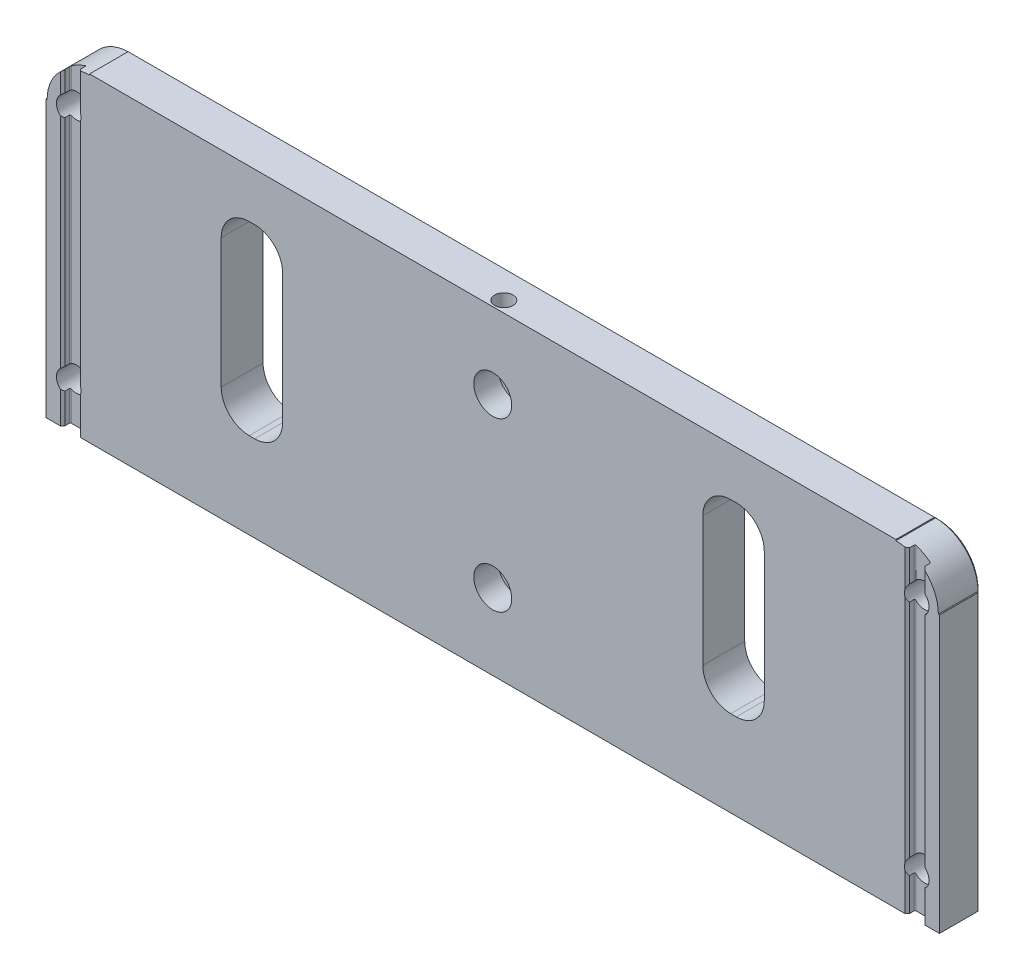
ISO-10303-21;
HEADER;
FILE_DESCRIPTION(('STEP AP214'),'2;1');
FILE_NAME('part.step','',(''),(''),'','','');
FILE_SCHEMA(('AUTOMOTIVE_DESIGN { 1 0 10303 214 1 1 1 1 }'));
ENDSEC;
DATA;
#1=APPLICATION_CONTEXT('core data for automotive mechanical design processes');
#2=APPLICATION_PROTOCOL_DEFINITION('international standard','automotive_design',2000,#1);
#3=PRODUCT_CONTEXT('',#1,'mechanical');
#4=PRODUCT('Part','Part','',(#3));
#5=PRODUCT_RELATED_PRODUCT_CATEGORY('part','',(#4));
#6=PRODUCT_DEFINITION_FORMATION('','',#4);
#7=PRODUCT_DEFINITION_CONTEXT('part definition',#1,'design');
#8=PRODUCT_DEFINITION('design','',#6,#7);
#9=PRODUCT_DEFINITION_SHAPE('','',#8);
#10=(LENGTH_UNIT() NAMED_UNIT(*) SI_UNIT(.MILLI.,.METRE.));
#11=(NAMED_UNIT(*) PLANE_ANGLE_UNIT() SI_UNIT($,.RADIAN.));
#12=(NAMED_UNIT(*) SI_UNIT($,.STERADIAN.) SOLID_ANGLE_UNIT());
#13=UNCERTAINTY_MEASURE_WITH_UNIT(LENGTH_MEASURE(1.E-05),#10,'distance_accuracy_value','');
#14=(GEOMETRIC_REPRESENTATION_CONTEXT(3) GLOBAL_UNCERTAINTY_ASSIGNED_CONTEXT((#13)) GLOBAL_UNIT_ASSIGNED_CONTEXT((#10,
#11,#12)) REPRESENTATION_CONTEXT('',''));
#15=CARTESIAN_POINT('',(0.,0.,0.));
#16=DIRECTION('',(0.,0.,1.));
#17=DIRECTION('',(1.,0.,0.));
#18=AXIS2_PLACEMENT_3D('',#15,#16,#17);
#19=CARTESIAN_POINT('',(-101.5873,-36.322,0.));
#20=DIRECTION('',(0.,0.,1.));
#21=DIRECTION('',(1.,0.,0.));
#22=AXIS2_PLACEMENT_3D('',#19,#20,#21);
#23=PLANE('',#22);
#24=CARTESIAN_POINT('',(91.6813,26.416,0.));
#25=DIRECTION('',(0.,0.,-1.));
#26=DIRECTION('',(-1.,0.,0.));
#27=AXIS2_PLACEMENT_3D('',#24,#25,#26);
#28=CIRCLE('',#27,9.652);
#29=CARTESIAN_POINT('',(98.3234,33.4191144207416,0.));
#30=VERTEX_POINT('',#29);
#31=CARTESIAN_POINT('',(101.3333,26.416,0.));
#32=VERTEX_POINT('',#31);
#33=EDGE_CURVE('E727',#30,#32,#28,.T.);
#34=ORIENTED_EDGE('',*,*,#33,.F.);
#35=DIRECTION('',(0.,-1.,0.));
#36=VECTOR('',#35,1.);
#37=CARTESIAN_POINT('',(98.3234,-36.322,0.));
#38=LINE('',#37,#36);
#39=CARTESIAN_POINT('',(98.3234,28.8408715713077,0.));
#40=VERTEX_POINT('',#39);
#41=EDGE_CURVE('E1279',#30,#40,#38,.T.);
#42=ORIENTED_EDGE('',*,*,#41,.T.);
#43=CARTESIAN_POINT('',(96.4184,26.797,0.));
#44=DIRECTION('',(0.,0.,1.));
#45=DIRECTION('',(1.,0.,0.));
#46=AXIS2_PLACEMENT_3D('',#43,#44,#45);
#47=CIRCLE('',#46,2.794);
#48=CARTESIAN_POINT('',(98.3234,24.7531284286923,0.));
#49=VERTEX_POINT('',#48);
#50=EDGE_CURVE('E669',#49,#40,#47,.T.);
#51=ORIENTED_EDGE('',*,*,#50,.F.);
#52=DIRECTION('',(0.,-1.,0.));
#53=VECTOR('',#52,1.);
#54=CARTESIAN_POINT('',(98.3234,-36.322,0.));
#55=LINE('',#54,#53);
#56=CARTESIAN_POINT('',(98.3234,-25.0071284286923,0.));
#57=VERTEX_POINT('',#56);
#58=EDGE_CURVE('E1273',#49,#57,#55,.T.);
#59=ORIENTED_EDGE('',*,*,#58,.T.);
#60=CARTESIAN_POINT('',(96.4184,-27.051,0.));
#61=DIRECTION('',(0.,0.,1.));
#62=DIRECTION('',(1.,0.,0.));
#63=AXIS2_PLACEMENT_3D('',#60,#61,#62);
#64=CIRCLE('',#63,2.794);
#65=CARTESIAN_POINT('',(98.3234,-29.0948715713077,0.));
#66=VERTEX_POINT('',#65);
#67=EDGE_CURVE('E690',#66,#57,#64,.T.);
#68=ORIENTED_EDGE('',*,*,#67,.F.);
#69=DIRECTION('',(0.,-1.,0.));
#70=VECTOR('',#69,1.);
#71=CARTESIAN_POINT('',(98.3234,-36.322,0.));
#72=LINE('',#71,#70);
#73=CARTESIAN_POINT('',(98.3234,-36.322,0.));
#74=VERTEX_POINT('',#73);
#75=EDGE_CURVE('E1276',#66,#74,#72,.T.);
#76=ORIENTED_EDGE('',*,*,#75,.T.);
#77=DIRECTION('',(1.,0.,0.));
#78=VECTOR('',#77,1.);
#79=CARTESIAN_POINT('',(-101.5873,-36.322,0.));
#80=LINE('',#79,#78);
#81=CARTESIAN_POINT('',(101.5873,-36.322,0.));
#82=VERTEX_POINT('',#81);
#83=EDGE_CURVE('E745',#74,#82,#80,.T.);
#84=ORIENTED_EDGE('',*,*,#83,.T.);
#85=DIRECTION('',(0.,1.,0.));
#86=VECTOR('',#85,1.);
#87=CARTESIAN_POINT('',(101.5873,36.322,0.));
#88=LINE('',#87,#86);
#89=CARTESIAN_POINT('',(101.5873,26.416,0.));
#90=VERTEX_POINT('',#89);
#91=EDGE_CURVE('E749',#82,#90,#88,.T.);
#92=ORIENTED_EDGE('',*,*,#91,.T.);
#93=DIRECTION('',(1.,0.,0.));
#94=VECTOR('',#93,1.);
#95=CARTESIAN_POINT('',(101.3333,26.416,0.));
#96=LINE('',#95,#94);
#97=EDGE_CURVE('E731',#32,#90,#96,.T.);
#98=ORIENTED_EDGE('',*,*,#97,.F.);
#99=EDGE_LOOP('',(#34,#42,#51,#59,#68,#76,#84,#92,#98));
#100=FACE_BOUND('',#99,.T.);
#101=ADVANCED_FACE('F37',(#100),#23,.T.);
#102=DIRECTION('',(0.,1.,0.));
#103=VECTOR('',#102,1.);
#104=CARTESIAN_POINT('',(47.7774,19.05,0.));
#105=LINE('',#104,#103);
#106=CARTESIAN_POINT('',(47.7774,-10.414,0.));
#107=VERTEX_POINT('',#106);
#108=CARTESIAN_POINT('',(47.7774,19.05,0.));
#109=VERTEX_POINT('',#108);
#110=EDGE_CURVE('E582',#107,#109,#105,.T.);
#111=ORIENTED_EDGE('',*,*,#110,.T.);
#112=CARTESIAN_POINT('',(54.1274,19.05,0.));
#113=DIRECTION('',(0.,0.,-1.));
#114=DIRECTION('',(-1.,0.,0.));
#115=AXIS2_PLACEMENT_3D('',#112,#113,#114);
#116=CIRCLE('',#115,6.35);
#117=CARTESIAN_POINT('',(54.1274,25.4,0.));
#118=VERTEX_POINT('',#117);
#119=EDGE_CURVE('E560',#109,#118,#116,.T.);
#120=ORIENTED_EDGE('',*,*,#119,.T.);
#121=DIRECTION('',(1.,0.,0.));
#122=VECTOR('',#121,1.);
#123=CARTESIAN_POINT('',(55.3974,25.4,0.));
#124=LINE('',#123,#122);
#125=CARTESIAN_POINT('',(55.3974,25.4,0.));
#126=VERTEX_POINT('',#125);
#127=EDGE_CURVE('E564',#118,#126,#124,.T.);
#128=ORIENTED_EDGE('',*,*,#127,.T.);
#129=CARTESIAN_POINT('',(55.3974,19.05,0.));
#130=DIRECTION('',(0.,0.,-1.));
#131=DIRECTION('',(-1.,0.,0.));
#132=AXIS2_PLACEMENT_3D('',#129,#130,#131);
#133=CIRCLE('',#132,6.35);
#134=CARTESIAN_POINT('',(61.7474,19.05,0.));
#135=VERTEX_POINT('',#134);
#136=EDGE_CURVE('E597',#126,#135,#133,.T.);
#137=ORIENTED_EDGE('',*,*,#136,.T.);
#138=DIRECTION('',(0.,-1.,0.));
#139=VECTOR('',#138,1.);
#140=CARTESIAN_POINT('',(61.7474,19.05,0.));
#141=LINE('',#140,#139);
#142=CARTESIAN_POINT('',(61.7474,-10.414,0.));
#143=VERTEX_POINT('',#142);
#144=EDGE_CURVE('E594',#135,#143,#141,.T.);
#145=ORIENTED_EDGE('',*,*,#144,.T.);
#146=CARTESIAN_POINT('',(55.3974,-10.414,0.));
#147=DIRECTION('',(0.,0.,-1.));
#148=DIRECTION('',(-1.,0.,0.));
#149=AXIS2_PLACEMENT_3D('',#146,#147,#148);
#150=CIRCLE('',#149,6.35);
#151=CARTESIAN_POINT('',(55.3974,-16.764,0.));
#152=VERTEX_POINT('',#151);
#153=EDGE_CURVE('E591',#143,#152,#150,.T.);
#154=ORIENTED_EDGE('',*,*,#153,.T.);
#155=DIRECTION('',(-1.,0.,0.));
#156=VECTOR('',#155,1.);
#157=CARTESIAN_POINT('',(55.3974,-16.764,0.));
#158=LINE('',#157,#156);
#159=CARTESIAN_POINT('',(54.1274,-16.764,0.));
#160=VERTEX_POINT('',#159);
#161=EDGE_CURVE('E588',#152,#160,#158,.T.);
#162=ORIENTED_EDGE('',*,*,#161,.T.);
#163=CARTESIAN_POINT('',(54.1274,-10.414,0.));
#164=DIRECTION('',(0.,0.,-1.));
#165=DIRECTION('',(-1.,0.,0.));
#166=AXIS2_PLACEMENT_3D('',#163,#164,#165);
#167=CIRCLE('',#166,6.35);
#168=EDGE_CURVE('E585',#160,#107,#167,.T.);
#169=ORIENTED_EDGE('',*,*,#168,.T.);
#170=EDGE_LOOP('',(#111,#120,#128,#137,#145,#154,#162,#169));
#171=FACE_BOUND('',#170,.T.);
#172=CARTESIAN_POINT('',(-54.1274,19.05,0.));
#173=DIRECTION('',(0.,0.,1.));
#174=DIRECTION('',(1.,0.,0.));
#175=AXIS2_PLACEMENT_3D('',#172,#173,#174);
#176=CIRCLE('',#175,6.35);
#177=CARTESIAN_POINT('',(-47.7774,19.05,0.));
#178=VERTEX_POINT('',#177);
#179=CARTESIAN_POINT('',(-54.1274,25.4,0.));
#180=VERTEX_POINT('',#179);
#181=EDGE_CURVE('E605',#178,#180,#176,.T.);
#182=ORIENTED_EDGE('',*,*,#181,.F.);
#183=DIRECTION('',(0.,1.,0.));
#184=VECTOR('',#183,1.);
#185=CARTESIAN_POINT('',(-47.7774,19.05,0.));
#186=LINE('',#185,#184);
#187=CARTESIAN_POINT('',(-47.7774,-10.414,0.));
#188=VERTEX_POINT('',#187);
#189=EDGE_CURVE('E624',#188,#178,#186,.T.);
#190=ORIENTED_EDGE('',*,*,#189,.F.);
#191=CARTESIAN_POINT('',(-54.1274,-10.414,0.));
#192=DIRECTION('',(0.,0.,1.));
#193=DIRECTION('',(1.,0.,0.));
#194=AXIS2_PLACEMENT_3D('',#191,#192,#193);
#195=CIRCLE('',#194,6.35);
#196=CARTESIAN_POINT('',(-54.1274,-16.764,0.));
#197=VERTEX_POINT('',#196);
#198=EDGE_CURVE('E662',#197,#188,#195,.T.);
#199=ORIENTED_EDGE('',*,*,#198,.F.);
#200=DIRECTION('',(1.,0.,0.));
#201=VECTOR('',#200,1.);
#202=CARTESIAN_POINT('',(-55.3974,-16.764,0.));
#203=LINE('',#202,#201);
#204=CARTESIAN_POINT('',(-55.3974,-16.764,0.));
#205=VERTEX_POINT('',#204);
#206=EDGE_CURVE('E659',#205,#197,#203,.T.);
#207=ORIENTED_EDGE('',*,*,#206,.F.);
#208=CARTESIAN_POINT('',(-55.3974,-10.414,0.));
#209=DIRECTION('',(0.,0.,1.));
#210=DIRECTION('',(1.,0.,0.));
#211=AXIS2_PLACEMENT_3D('',#208,#209,#210);
#212=CIRCLE('',#211,6.35);
#213=CARTESIAN_POINT('',(-61.7474,-10.414,0.));
#214=VERTEX_POINT('',#213);
#215=EDGE_CURVE('E656',#214,#205,#212,.T.);
#216=ORIENTED_EDGE('',*,*,#215,.F.);
#217=DIRECTION('',(0.,-1.,0.));
#218=VECTOR('',#217,1.);
#219=CARTESIAN_POINT('',(-61.7474,19.05,0.));
#220=LINE('',#219,#218);
#221=CARTESIAN_POINT('',(-61.7474,19.05,0.));
#222=VERTEX_POINT('',#221);
#223=EDGE_CURVE('E653',#222,#214,#220,.T.);
#224=ORIENTED_EDGE('',*,*,#223,.F.);
#225=CARTESIAN_POINT('',(-55.3974,19.05,0.));
#226=DIRECTION('',(0.,0.,1.));
#227=DIRECTION('',(1.,0.,0.));
#228=AXIS2_PLACEMENT_3D('',#225,#226,#227);
#229=CIRCLE('',#228,6.35);
#230=CARTESIAN_POINT('',(-55.3974,25.4,0.));
#231=VERTEX_POINT('',#230);
#232=EDGE_CURVE('E650',#231,#222,#229,.T.);
#233=ORIENTED_EDGE('',*,*,#232,.F.);
#234=DIRECTION('',(-1.,0.,0.));
#235=VECTOR('',#234,1.);
#236=CARTESIAN_POINT('',(-55.3974,25.4,0.));
#237=LINE('',#236,#235);
#238=EDGE_CURVE('E647',#180,#231,#237,.T.);
#239=ORIENTED_EDGE('',*,*,#238,.F.);
#240=EDGE_LOOP('',(#182,#190,#199,#207,#216,#224,#233,#239));
#241=FACE_BOUND('',#240,.T.);
#242=CARTESIAN_POINT('',(0.,-19.05,0.));
#243=DIRECTION('',(0.,0.,1.));
#244=DIRECTION('',(1.,0.,0.));
#245=AXIS2_PLACEMENT_3D('',#242,#243,#244);
#246=CIRCLE('',#245,4.318);
#247=CARTESIAN_POINT('',(4.318,-19.05,0.));
#248=VERTEX_POINT('',#247);
#249=EDGE_CURVE('E557',#248,#248,#246,.T.);
#250=ORIENTED_EDGE('',*,*,#249,.F.);
#251=EDGE_LOOP('',(#250));
#252=FACE_BOUND('',#251,.T.);
#253=CARTESIAN_POINT('',(0.,19.05,0.));
#254=DIRECTION('',(0.,0.,1.));
#255=DIRECTION('',(1.,0.,0.));
#256=AXIS2_PLACEMENT_3D('',#253,#254,#255);
#257=CIRCLE('',#256,4.318);
#258=CARTESIAN_POINT('',(4.318,19.05,0.));
#259=VERTEX_POINT('',#258);
#260=EDGE_CURVE('E549',#259,#259,#257,.T.);
#261=ORIENTED_EDGE('',*,*,#260,.F.);
#262=EDGE_LOOP('',(#261));
#263=FACE_BOUND('',#262,.T.);
#264=CARTESIAN_POINT('',(93.7514,27.6297946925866,0.));
#265=VERTEX_POINT('',#264);
#266=CARTESIAN_POINT('',(93.7514,25.9642053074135,0.));
#267=VERTEX_POINT('',#266);
#268=EDGE_CURVE('E686',#265,#267,#47,.T.);
#269=ORIENTED_EDGE('',*,*,#268,.F.);
#270=DIRECTION('',(0.,1.,0.));
#271=VECTOR('',#270,1.);
#272=CARTESIAN_POINT('',(93.7514,-36.322,0.));
#273=LINE('',#272,#271);
#274=CARTESIAN_POINT('',(93.7514,35.8433957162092,0.));
#275=VERTEX_POINT('',#274);
#276=EDGE_CURVE('E1244',#265,#275,#273,.T.);
#277=ORIENTED_EDGE('',*,*,#276,.T.);
#278=CARTESIAN_POINT('',(91.6813,36.068,0.));
#279=VERTEX_POINT('',#278);
#280=EDGE_CURVE('E728',#279,#275,#28,.T.);
#281=ORIENTED_EDGE('',*,*,#280,.F.);
#282=DIRECTION('',(0.,-1.,0.));
#283=VECTOR('',#282,1.);
#284=CARTESIAN_POINT('',(91.6813,-36.3220000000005,0.));
#285=LINE('',#284,#283);
#286=CARTESIAN_POINT('',(91.6813,36.322,0.));
#287=VERTEX_POINT('',#286);
#288=EDGE_CURVE('E759',#287,#279,#285,.T.);
#289=ORIENTED_EDGE('',*,*,#288,.F.);
#290=DIRECTION('',(-1.,0.,0.));
#291=VECTOR('',#290,1.);
#292=CARTESIAN_POINT('',(-101.5873,36.322,0.));
#293=LINE('',#292,#291);
#294=CARTESIAN_POINT('',(-91.6813,36.322,0.));
#295=VERTEX_POINT('',#294);
#296=EDGE_CURVE('E753',#287,#295,#293,.T.);
#297=ORIENTED_EDGE('',*,*,#296,.T.);
#298=DIRECTION('',(0.,-1.,0.));
#299=VECTOR('',#298,1.);
#300=CARTESIAN_POINT('',(-91.6813,-36.322,0.));
#301=LINE('',#300,#299);
#302=CARTESIAN_POINT('',(-91.6813,36.068,0.));
#303=VERTEX_POINT('',#302);
#304=EDGE_CURVE('E763',#295,#303,#301,.T.);
#305=ORIENTED_EDGE('',*,*,#304,.T.);
#306=CARTESIAN_POINT('',(-91.6813,26.416,0.));
#307=DIRECTION('',(0.,0.,1.));
#308=DIRECTION('',(1.,0.,0.));
#309=AXIS2_PLACEMENT_3D('',#306,#307,#308);
#310=CIRCLE('',#309,9.652);
#311=CARTESIAN_POINT('',(-93.7514,35.8433957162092,0.));
#312=VERTEX_POINT('',#311);
#313=EDGE_CURVE('E715',#303,#312,#310,.T.);
#314=ORIENTED_EDGE('',*,*,#313,.T.);
#315=DIRECTION('',(0.,-1.,0.));
#316=VECTOR('',#315,1.);
#317=CARTESIAN_POINT('',(-93.7514,28.5704584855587,0.));
#318=LINE('',#317,#316);
#319=CARTESIAN_POINT('',(-93.7514,27.6297946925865,0.));
#320=VERTEX_POINT('',#319);
#321=EDGE_CURVE('E1079',#312,#320,#318,.T.);
#322=ORIENTED_EDGE('',*,*,#321,.T.);
#323=CARTESIAN_POINT('',(-96.4184,26.797,0.));
#324=DIRECTION('',(0.,0.,1.));
#325=DIRECTION('',(1.,0.,0.));
#326=AXIS2_PLACEMENT_3D('',#323,#324,#325);
#327=CIRCLE('',#326,2.794);
#328=CARTESIAN_POINT('',(-93.7514,25.9642053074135,0.));
#329=VERTEX_POINT('',#328);
#330=EDGE_CURVE('E697',#329,#320,#327,.T.);
#331=ORIENTED_EDGE('',*,*,#330,.F.);
#332=DIRECTION('',(0.,-1.,0.));
#333=VECTOR('',#332,1.);
#334=CARTESIAN_POINT('',(-93.7514,-25.2775415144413,0.));
#335=LINE('',#334,#333);
#336=CARTESIAN_POINT('',(-93.7514,-26.2182053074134,0.));
#337=VERTEX_POINT('',#336);
#338=EDGE_CURVE('E2331',#329,#337,#335,.T.);
#339=ORIENTED_EDGE('',*,*,#338,.T.);
#340=CARTESIAN_POINT('',(-96.4184,-27.051,0.));
#341=DIRECTION('',(0.,0.,1.));
#342=DIRECTION('',(1.,0.,0.));
#343=AXIS2_PLACEMENT_3D('',#340,#341,#342);
#344=CIRCLE('',#343,2.794);
#345=CARTESIAN_POINT('',(-93.7514,-27.8837946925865,0.));
#346=VERTEX_POINT('',#345);
#347=EDGE_CURVE('E704',#346,#337,#344,.T.);
#348=ORIENTED_EDGE('',*,*,#347,.F.);
#349=DIRECTION('',(0.,-1.,0.));
#350=VECTOR('',#349,1.);
#351=CARTESIAN_POINT('',(-93.7514,-36.322,0.));
#352=LINE('',#351,#350);
#353=CARTESIAN_POINT('',(-93.7514,-36.322,0.));
#354=VERTEX_POINT('',#353);
#355=EDGE_CURVE('E1453',#346,#354,#352,.T.);
#356=ORIENTED_EDGE('',*,*,#355,.T.);
#357=CARTESIAN_POINT('',(93.7514,-36.322,0.));
#358=VERTEX_POINT('',#357);
#359=EDGE_CURVE('E750',#354,#358,#80,.T.);
#360=ORIENTED_EDGE('',*,*,#359,.T.);
#361=DIRECTION('',(0.,1.,0.));
#362=VECTOR('',#361,1.);
#363=CARTESIAN_POINT('',(93.7514,-36.322,0.));
#364=LINE('',#363,#362);
#365=CARTESIAN_POINT('',(93.7514,-27.8837946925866,0.));
#366=VERTEX_POINT('',#365);
#367=EDGE_CURVE('E1256',#358,#366,#364,.T.);
#368=ORIENTED_EDGE('',*,*,#367,.T.);
#369=CARTESIAN_POINT('',(93.7514,-26.2182053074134,0.));
#370=VERTEX_POINT('',#369);
#371=EDGE_CURVE('E693',#370,#366,#64,.T.);
#372=ORIENTED_EDGE('',*,*,#371,.F.);
#373=DIRECTION('',(0.,1.,0.));
#374=VECTOR('',#373,1.);
#375=CARTESIAN_POINT('',(93.7514,-36.322,0.));
#376=LINE('',#375,#374);
#377=EDGE_CURVE('E1247',#370,#267,#376,.T.);
#378=ORIENTED_EDGE('',*,*,#377,.T.);
#379=EDGE_LOOP('',(#269,#277,#281,#289,#297,#305,#314,#322,#331,#339,#348,#356,#360,#368,#372,#378));
#380=FACE_BOUND('',#379,.T.);
#381=ADVANCED_FACE('F1097',(#171,#241,#252,#263,#380),#23,.T.);
#382=CARTESIAN_POINT('',(-101.5873,-36.322,-9.525));
#383=DIRECTION('',(0.,-1.,0.));
#384=DIRECTION('',(0.,0.,-1.));
#385=AXIS2_PLACEMENT_3D('',#382,#383,#384);
#386=PLANE('',#385);
#387=DIRECTION('',(0.,0.,1.));
#388=VECTOR('',#387,1.);
#389=CARTESIAN_POINT('',(-101.5873,-36.322,-9.525));
#390=LINE('',#389,#388);
#391=CARTESIAN_POINT('',(-101.5873,-36.322,-8.763));
#392=VERTEX_POINT('',#391);
#393=CARTESIAN_POINT('',(-101.5873,-36.322,0.));
#394=VERTEX_POINT('',#393);
#395=EDGE_CURVE('E756',#392,#394,#390,.T.);
#396=ORIENTED_EDGE('',*,*,#395,.F.);
#397=DIRECTION('',(1.,0.,0.));
#398=VECTOR('',#397,1.);
#399=CARTESIAN_POINT('',(101.5873,-36.322,-8.763));
#400=LINE('',#399,#398);
#401=CARTESIAN_POINT('',(101.5873,-36.322,-8.763));
#402=VERTEX_POINT('',#401);
#403=EDGE_CURVE('E1196',#392,#402,#400,.T.);
#404=ORIENTED_EDGE('',*,*,#403,.T.);
#405=DIRECTION('',(0.,0.,1.));
#406=VECTOR('',#405,1.);
#407=CARTESIAN_POINT('',(101.5873,-36.322,-9.525));
#408=LINE('',#407,#406);
#409=EDGE_CURVE('E757',#402,#82,#408,.T.);
#410=ORIENTED_EDGE('',*,*,#409,.T.);
#411=ORIENTED_EDGE('',*,*,#83,.F.);
#412=DIRECTION('',(0.707106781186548,0.,0.707106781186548));
#413=VECTOR('',#412,1.);
#414=CARTESIAN_POINT('',(-6.39445,-36.322,-104.71785));
#415=LINE('',#414,#413);
#416=CARTESIAN_POINT('',(97.8154,-36.322,-0.508000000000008));
#417=VERTEX_POINT('',#416);
#418=EDGE_CURVE('E1289',#74,#417,#415,.F.);
#419=ORIENTED_EDGE('',*,*,#418,.T.);
#420=DIRECTION('',(0.,0.,-1.));
#421=VECTOR('',#420,1.);
#422=CARTESIAN_POINT('',(97.8154,-36.322,-9.525));
#423=LINE('',#422,#421);
#424=CARTESIAN_POINT('',(97.8154,-36.322,-1.5748));
#425=VERTEX_POINT('',#424);
#426=EDGE_CURVE('E1394',#417,#425,#423,.T.);
#427=ORIENTED_EDGE('',*,*,#426,.T.);
#428=CARTESIAN_POINT('',(97.6122,-36.322,-1.5748));
#429=DIRECTION('',(0.,-1.,0.));
#430=DIRECTION('',(0.,0.,-1.));
#431=AXIS2_PLACEMENT_3D('',#428,#429,#430);
#432=CIRCLE('',#431,0.2032);
#433=CARTESIAN_POINT('',(97.6122,-36.322,-1.778));
#434=VERTEX_POINT('',#433);
#435=EDGE_CURVE('E858',#425,#434,#432,.F.);
#436=ORIENTED_EDGE('',*,*,#435,.T.);
#437=DIRECTION('',(-1.,0.,0.));
#438=VECTOR('',#437,1.);
#439=CARTESIAN_POINT('',(-101.5873,-36.322,-1.778));
#440=LINE('',#439,#438);
#441=CARTESIAN_POINT('',(94.4626,-36.322,-1.778));
#442=VERTEX_POINT('',#441);
#443=EDGE_CURVE('E1416',#434,#442,#440,.T.);
#444=ORIENTED_EDGE('',*,*,#443,.T.);
#445=CARTESIAN_POINT('',(94.4626,-36.322,-1.5748));
#446=DIRECTION('',(0.,-1.,0.));
#447=DIRECTION('',(0.,0.,-1.));
#448=AXIS2_PLACEMENT_3D('',#445,#446,#447);
#449=CIRCLE('',#448,0.2032);
#450=CARTESIAN_POINT('',(94.2594,-36.322,-1.5748));
#451=VERTEX_POINT('',#450);
#452=EDGE_CURVE('E970',#442,#451,#449,.F.);
#453=ORIENTED_EDGE('',*,*,#452,.T.);
#454=DIRECTION('',(0.,0.,1.));
#455=VECTOR('',#454,1.);
#456=CARTESIAN_POINT('',(94.2594,-36.322,-9.525));
#457=LINE('',#456,#455);
#458=CARTESIAN_POINT('',(94.2594,-36.322,-0.508000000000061));
#459=VERTEX_POINT('',#458);
#460=EDGE_CURVE('E1405',#451,#459,#457,.T.);
#461=ORIENTED_EDGE('',*,*,#460,.T.);
#462=DIRECTION('',(0.70710678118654,0.,-0.707106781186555));
#463=VECTOR('',#462,1.);
#464=CARTESIAN_POINT('',(0.844550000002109,-36.322,92.90685));
#465=LINE('',#464,#463);
#466=EDGE_CURVE('E1287',#459,#358,#465,.F.);
#467=ORIENTED_EDGE('',*,*,#466,.T.);
#468=ORIENTED_EDGE('',*,*,#359,.F.);
#469=DIRECTION('',(-0.70710678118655,0.,-0.707106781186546));
#470=VECTOR('',#469,1.);
#471=CARTESIAN_POINT('',(-102.43185,-36.322,-8.68045));
#472=LINE('',#471,#470);
#473=CARTESIAN_POINT('',(-94.2594,-36.322,-0.508000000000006));
#474=VERTEX_POINT('',#473);
#475=EDGE_CURVE('E1284',#354,#474,#472,.T.);
#476=ORIENTED_EDGE('',*,*,#475,.T.);
#477=DIRECTION('',(0.,0.,1.));
#478=VECTOR('',#477,1.);
#479=CARTESIAN_POINT('',(-94.2594,-36.322,-9.525));
#480=LINE('',#479,#478);
#481=CARTESIAN_POINT('',(-94.2594,-36.322,-1.5748));
#482=VERTEX_POINT('',#481);
#483=EDGE_CURVE('E1355',#482,#474,#480,.T.);
#484=ORIENTED_EDGE('',*,*,#483,.F.);
#485=CARTESIAN_POINT('',(-94.4626,-36.322,-1.5748));
#486=DIRECTION('',(0.,-1.,0.));
#487=DIRECTION('',(0.,0.,-1.));
#488=AXIS2_PLACEMENT_3D('',#485,#486,#487);
#489=CIRCLE('',#488,0.2032);
#490=CARTESIAN_POINT('',(-94.4626,-36.322,-1.778));
#491=VERTEX_POINT('',#490);
#492=EDGE_CURVE('E979',#482,#491,#489,.F.);
#493=ORIENTED_EDGE('',*,*,#492,.T.);
#494=DIRECTION('',(-1.,0.,0.));
#495=VECTOR('',#494,1.);
#496=CARTESIAN_POINT('',(-101.5873,-36.322,-1.778));
#497=LINE('',#496,#495);
#498=CARTESIAN_POINT('',(-97.6122,-36.322,-1.778));
#499=VERTEX_POINT('',#498);
#500=EDGE_CURVE('E1339',#491,#499,#497,.T.);
#501=ORIENTED_EDGE('',*,*,#500,.T.);
#502=CARTESIAN_POINT('',(-97.6122,-36.322,-1.5748));
#503=DIRECTION('',(0.,-1.,0.));
#504=DIRECTION('',(0.,0.,-1.));
#505=AXIS2_PLACEMENT_3D('',#502,#503,#504);
#506=CIRCLE('',#505,0.2032);
#507=CARTESIAN_POINT('',(-97.8154,-36.322,-1.5748));
#508=VERTEX_POINT('',#507);
#509=EDGE_CURVE('E1040',#499,#508,#506,.F.);
#510=ORIENTED_EDGE('',*,*,#509,.T.);
#511=DIRECTION('',(0.,0.,-1.));
#512=VECTOR('',#511,1.);
#513=CARTESIAN_POINT('',(-97.8154,-36.322,-9.525));
#514=LINE('',#513,#512);
#515=CARTESIAN_POINT('',(-97.8154,-36.322,-0.508));
#516=VERTEX_POINT('',#515);
#517=EDGE_CURVE('E531',#516,#508,#514,.T.);
#518=ORIENTED_EDGE('',*,*,#517,.F.);
#519=DIRECTION('',(-0.707106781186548,0.,0.707106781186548));
#520=VECTOR('',#519,1.);
#521=CARTESIAN_POINT('',(-95.19285,-36.322,-3.13055));
#522=LINE('',#521,#520);
#523=CARTESIAN_POINT('',(-98.3234,-36.322,0.));
#524=VERTEX_POINT('',#523);
#525=EDGE_CURVE('E1126',#516,#524,#522,.T.);
#526=ORIENTED_EDGE('',*,*,#525,.T.);
#527=EDGE_CURVE('E746',#394,#524,#80,.T.);
#528=ORIENTED_EDGE('',*,*,#527,.F.);
#529=EDGE_LOOP('',(#396,#404,#410,#411,#419,#427,#436,#444,#453,#461,#467,#468,#476,#484,#493,
#501,#510,#518,#526,#528));
#530=FACE_BOUND('',#529,.T.);
#531=ADVANCED_FACE('F1103',(#530),#386,.T.);
#532=CARTESIAN_POINT('',(91.6813,26.416,-9.525));
#533=DIRECTION('',(0.,0.,1.));
#534=DIRECTION('',(1.,0.,0.));
#535=AXIS2_PLACEMENT_3D('',#532,#533,#534);
#536=CYLINDRICAL_SURFACE('',#535,9.652);
#537=DIRECTION('',(0.,0.,1.));
#538=VECTOR('',#537,1.);
#539=CARTESIAN_POINT('',(101.3333,26.416,-9.525));
#540=LINE('',#539,#538);
#541=CARTESIAN_POINT('',(101.3333,26.416,-9.017));
#542=VERTEX_POINT('',#541);
#543=EDGE_CURVE('E734',#542,#32,#540,.T.);
#544=ORIENTED_EDGE('',*,*,#543,.F.);
#545=CARTESIAN_POINT('',(91.6813,26.416,-9.01700000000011));
#546=DIRECTION('',(0.,0.,1.));
#547=DIRECTION('',(1.,0.,0.));
#548=AXIS2_PLACEMENT_3D('',#545,#546,#547);
#549=CIRCLE('',#548,9.652);
#550=CARTESIAN_POINT('',(91.6813,36.068,-9.017));
#551=VERTEX_POINT('',#550);
#552=EDGE_CURVE('E12',#542,#551,#549,.T.);
#553=ORIENTED_EDGE('',*,*,#552,.T.);
#554=DIRECTION('',(0.,0.,1.));
#555=VECTOR('',#554,1.);
#556=CARTESIAN_POINT('',(91.6813,36.068,-9.525));
#557=LINE('',#556,#555);
#558=EDGE_CURVE('E733',#551,#279,#557,.T.);
#559=ORIENTED_EDGE('',*,*,#558,.T.);
#560=ORIENTED_EDGE('',*,*,#280,.T.);
#561=CARTESIAN_POINT('',(91.6813,26.416,2.07010000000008));
#562=DIRECTION('',(-0.707106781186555,0.,-0.70710678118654));
#563=DIRECTION('',(-0.70710678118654,0.,0.707106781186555));
#564=AXIS2_PLACEMENT_3D('',#561,#562,#563);
#565=ELLIPSE('',#564,13.6499893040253,9.652);
#566=CARTESIAN_POINT('',(94.2594,35.7173173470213,-0.508000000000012));
#567=VERTEX_POINT('',#566);
#568=EDGE_CURVE('E1254',#275,#567,#565,.T.);
#569=ORIENTED_EDGE('',*,*,#568,.T.);
#570=DIRECTION('',(0.,0.,1.));
#571=VECTOR('',#570,1.);
#572=CARTESIAN_POINT('',(94.2594,35.7173173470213,-9.525));
#573=LINE('',#572,#571);
#574=CARTESIAN_POINT('',(94.2594,35.7173173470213,-1.5748));
#575=VERTEX_POINT('',#574);
#576=EDGE_CURVE('E1408',#575,#567,#573,.T.);
#577=ORIENTED_EDGE('',*,*,#576,.F.);
#578=CARTESIAN_POINT('',(94.2594,35.7173173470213,-1.5748));
#579=CARTESIAN_POINT('',(94.2593889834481,35.7173198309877,-1.58592472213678));
#580=CARTESIAN_POINT('',(94.2603128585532,35.717064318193,-1.59704428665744));
#581=CARTESIAN_POINT('',(94.2639465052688,35.7160563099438,-1.61894525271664));
#582=CARTESIAN_POINT('',(94.2666531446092,35.7153046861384,-1.62972721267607));
#583=CARTESIAN_POINT('',(94.273769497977,35.7133231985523,-1.65066783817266));
#584=CARTESIAN_POINT('',(94.2781794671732,35.7120932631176,-1.66082641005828));
#585=CARTESIAN_POINT('',(94.288552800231,35.7091892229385,-1.68024642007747));
#586=CARTESIAN_POINT('',(94.2945163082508,35.7075150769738,-1.68950777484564));
#587=CARTESIAN_POINT('',(94.3079076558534,35.7037384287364,-1.70702666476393));
#588=CARTESIAN_POINT('',(94.3153557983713,35.701629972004,-1.71526737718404));
#589=CARTESIAN_POINT('',(94.3314319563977,35.6970545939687,-1.73038596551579));
#590=CARTESIAN_POINT('',(94.3400602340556,35.6945875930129,-1.7372635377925));
#591=CARTESIAN_POINT('',(94.3585653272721,35.6892653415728,-1.74971626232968));
#592=CARTESIAN_POINT('',(94.3684750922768,35.6863995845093,-1.75523789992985));
#593=CARTESIAN_POINT('',(94.3890113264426,35.6804221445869,-1.76454194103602));
#594=CARTESIAN_POINT('',(94.3996378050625,35.6773104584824,-1.76832432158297));
#595=CARTESIAN_POINT('',(94.4189968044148,35.6716036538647,-1.77346248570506));
#596=CARTESIAN_POINT('',(94.4276489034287,35.6690402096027,-1.77516406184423));
#597=CARTESIAN_POINT('',(94.4450680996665,35.6638523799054,-1.77743282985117));
#598=CARTESIAN_POINT('',(94.4538350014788,35.6612280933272,-1.77800174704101));
#599=CARTESIAN_POINT('',(94.4626,35.6585902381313,-1.778));
#600=B_SPLINE_CURVE_WITH_KNOTS('',3,(#578,#579,#580,#581,#582,#583,#584,#585,#586,#587,#588,
#589,#590,#591,#592,#593,#594,#595,#596,#597,#598,#599),.UNSPECIFIED.,.F.,.F.,(4,2,2,2,2,2,2,2,
2,2,4),(0.,0.0333251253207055,0.0665918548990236,0.0998635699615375,0.133138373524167,
0.166904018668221,0.200677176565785,0.235623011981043,0.270569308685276,0.298049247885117,
0.32548729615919),.UNSPECIFIED.);
#601=CARTESIAN_POINT('',(94.4626,35.6585902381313,-1.778));
#602=VERTEX_POINT('',#601);
#603=EDGE_CURVE('E931',#575,#602,#600,.T.);
#604=ORIENTED_EDGE('',*,*,#603,.T.);
#605=CARTESIAN_POINT('',(91.6813,26.416,-1.778));
#606=DIRECTION('',(0.,0.,1.));
#607=DIRECTION('',(1.,0.,0.));
#608=AXIS2_PLACEMENT_3D('',#605,#606,#607);
#609=CIRCLE('',#608,9.652);
#610=CARTESIAN_POINT('',(97.6122,34.0308229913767,-1.778));
#611=VERTEX_POINT('',#610);
#612=EDGE_CURVE('E1419',#611,#602,#609,.T.);
#613=ORIENTED_EDGE('',*,*,#612,.F.);
#614=CARTESIAN_POINT('',(97.6122,34.0308229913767,-1.778));
#615=CARTESIAN_POINT('',(97.6257387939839,34.0202804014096,-1.77799126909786));
#616=CARTESIAN_POINT('',(97.6392641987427,34.0096857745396,-1.77664551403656));
#617=CARTESIAN_POINT('',(97.6659998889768,33.9886318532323,-1.77122823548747));
#618=CARTESIAN_POINT('',(97.679207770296,33.9781737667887,-1.76714025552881));
#619=CARTESIAN_POINT('',(97.703259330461,33.9590311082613,-1.75686432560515));
#620=CARTESIAN_POINT('',(97.7141932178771,33.9502873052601,-1.7509991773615));
#621=CARTESIAN_POINT('',(97.7351295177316,33.933475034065,-1.73708379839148));
#622=CARTESIAN_POINT('',(97.7451341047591,33.9254049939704,-1.72903885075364));
#623=CARTESIAN_POINT('',(97.7617555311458,33.9119491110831,-1.71274048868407));
#624=CARTESIAN_POINT('',(97.7686340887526,33.9063627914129,-1.70491995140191));
#625=CARTESIAN_POINT('',(97.7813143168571,33.8960398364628,-1.68794779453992));
#626=CARTESIAN_POINT('',(97.7871169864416,33.8913024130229,-1.6787974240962));
#627=CARTESIAN_POINT('',(97.7964614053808,33.8836592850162,-1.66094813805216));
#628=CARTESIAN_POINT('',(97.800219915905,33.8805790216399,-1.65243786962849));
#629=CARTESIAN_POINT('',(97.8065869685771,33.8753552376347,-1.6347336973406));
#630=CARTESIAN_POINT('',(97.8091976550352,33.8732099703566,-1.6255411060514));
#631=CARTESIAN_POINT('',(97.8125499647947,33.8704537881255,-1.60940171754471));
#632=CARTESIAN_POINT('',(97.8136126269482,33.8695794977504,-1.60256478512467));
#633=CARTESIAN_POINT('',(97.815040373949,33.8684045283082,-1.5887541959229));
#634=CARTESIAN_POINT('',(97.8154038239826,33.8681051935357,-1.5817802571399));
#635=CARTESIAN_POINT('',(97.8154,33.8681085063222,-1.5748));
#636=B_SPLINE_CURVE_WITH_KNOTS('',3,(#614,#615,#616,#617,#618,#619,#620,#621,#622,#623,#624,
#625,#626,#627,#628,#629,#630,#631,#632,#633,#634,#635),.UNSPECIFIED.,.F.,.F.,(4,2,2,2,2,2,2,2,
2,2,4),(0.,0.0514639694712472,0.103239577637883,0.148602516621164,0.193856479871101,
0.229183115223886,0.264476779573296,0.293757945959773,0.32298417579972,0.343849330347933,
0.364763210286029),.UNSPECIFIED.);
#637=CARTESIAN_POINT('',(97.8154,33.8681085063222,-1.5748));
#638=VERTEX_POINT('',#637);
#639=EDGE_CURVE('E1487',#611,#638,#636,.T.);
#640=ORIENTED_EDGE('',*,*,#639,.T.);
#641=DIRECTION('',(0.,0.,1.));
#642=VECTOR('',#641,1.);
#643=CARTESIAN_POINT('',(97.8154,33.8681085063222,-9.525));
#644=LINE('',#643,#642);
#645=CARTESIAN_POINT('',(97.8154,33.8681085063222,-0.508000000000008));
#646=VERTEX_POINT('',#645);
#647=EDGE_CURVE('E1395',#646,#638,#644,.F.);
#648=ORIENTED_EDGE('',*,*,#647,.F.);
#649=CARTESIAN_POINT('',(91.6813,26.416,-6.6421));
#650=DIRECTION('',(0.707106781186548,0.,-0.707106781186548));
#651=DIRECTION('',(0.707106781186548,0.,0.707106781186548));
#652=AXIS2_PLACEMENT_3D('',#649,#650,#651);
#653=ELLIPSE('',#652,13.6499893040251,9.652);
#654=EDGE_CURVE('E1255',#646,#30,#653,.T.);
#655=ORIENTED_EDGE('',*,*,#654,.T.);
#656=ORIENTED_EDGE('',*,*,#33,.T.);
#657=EDGE_LOOP('',(#544,#553,#559,#560,#569,#577,#604,#613,#640,#648,#655,#656));
#658=FACE_BOUND('',#657,.T.);
#659=ADVANCED_FACE('F1494',(#658),#536,.T.);
#660=CARTESIAN_POINT('',(96.4184,-27.051,0.));
#661=DIRECTION('',(0.,0.,1.));
#662=DIRECTION('',(1.,0.,0.));
#663=AXIS2_PLACEMENT_3D('',#660,#661,#662);
#664=CYLINDRICAL_SURFACE('',#663,2.794);
#665=CARTESIAN_POINT('',(96.4184,-27.051,-9.525));
#666=DIRECTION('',(0.,0.,1.));
#667=DIRECTION('',(1.,0.,0.));
#668=AXIS2_PLACEMENT_3D('',#665,#666,#667);
#669=CIRCLE('',#668,2.794);
#670=CARTESIAN_POINT('',(99.2124,-27.051,-9.525));
#671=VERTEX_POINT('',#670);
#672=EDGE_CURVE('E694',#671,#671,#669,.T.);
#673=ORIENTED_EDGE('',*,*,#672,.F.);
#674=EDGE_LOOP('',(#673));
#675=FACE_BOUND('',#674,.T.);
#676=DIRECTION('',(0.,0.,1.));
#677=VECTOR('',#676,1.);
#678=CARTESIAN_POINT('',(97.8154,-29.4706749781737,0.));
#679=LINE('',#678,#677);
#680=CARTESIAN_POINT('',(97.8154,-29.4706749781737,-0.508000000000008));
#681=VERTEX_POINT('',#680);
#682=CARTESIAN_POINT('',(97.8154,-29.4706749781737,-1.5748));
#683=VERTEX_POINT('',#682);
#684=EDGE_CURVE('E1398',#681,#683,#679,.F.);
#685=ORIENTED_EDGE('',*,*,#684,.F.);
#686=CARTESIAN_POINT('',(96.4184,-27.051,-1.90500000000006));
#687=DIRECTION('',(0.707106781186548,0.,-0.707106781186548));
#688=DIRECTION('',(0.707106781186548,0.,0.707106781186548));
#689=AXIS2_PLACEMENT_3D('',#686,#687,#688);
#690=ELLIPSE('',#689,3.95131269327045,2.794);
#691=EDGE_CURVE('E1299',#681,#66,#690,.F.);
#692=ORIENTED_EDGE('',*,*,#691,.T.);
#693=ORIENTED_EDGE('',*,*,#67,.T.);
#694=CARTESIAN_POINT('',(96.4184,-27.051,-1.90500000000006));
#695=DIRECTION('',(0.707106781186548,0.,-0.707106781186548));
#696=DIRECTION('',(0.707106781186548,0.,0.707106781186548));
#697=AXIS2_PLACEMENT_3D('',#694,#695,#696);
#698=ELLIPSE('',#697,3.95131269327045,2.794);
#699=CARTESIAN_POINT('',(97.8154,-24.6313250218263,-0.508000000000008));
#700=VERTEX_POINT('',#699);
#701=EDGE_CURVE('E1293',#57,#700,#698,.F.);
#702=ORIENTED_EDGE('',*,*,#701,.T.);
#703=DIRECTION('',(0.,0.,1.));
#704=VECTOR('',#703,1.);
#705=CARTESIAN_POINT('',(97.8154,-24.6313250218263,0.));
#706=LINE('',#705,#704);
#707=CARTESIAN_POINT('',(97.8154,-24.6313250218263,-1.5748));
#708=VERTEX_POINT('',#707);
#709=EDGE_CURVE('E1402',#708,#700,#706,.T.);
#710=ORIENTED_EDGE('',*,*,#709,.F.);
#711=CARTESIAN_POINT('',(97.8154,-24.6313250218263,-1.5748));
#712=CARTESIAN_POINT('',(97.8154133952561,-24.6313346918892,-1.58519090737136));
#713=CARTESIAN_POINT('',(97.8146039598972,-24.6308654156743,-1.59556871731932));
#714=CARTESIAN_POINT('',(97.8114496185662,-24.629047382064,-1.61596172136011));
#715=CARTESIAN_POINT('',(97.8091118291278,-24.6277027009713,-1.62597837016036));
#716=CARTESIAN_POINT('',(97.8030123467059,-24.6242127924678,-1.64540390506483));
#717=CARTESIAN_POINT('',(97.7992521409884,-24.6220684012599,-1.65481341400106));
#718=CARTESIAN_POINT('',(97.7904698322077,-24.6170965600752,-1.67283381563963));
#719=CARTESIAN_POINT('',(97.7854465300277,-24.6142684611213,-1.68144393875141));
#720=CARTESIAN_POINT('',(97.7739970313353,-24.6078794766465,-1.69817148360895));
#721=CARTESIAN_POINT('',(97.7675070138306,-24.6042859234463,-1.70623253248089));
#722=CARTESIAN_POINT('',(97.7535217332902,-24.5966264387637,-1.7211665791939));
#723=CARTESIAN_POINT('',(97.7460261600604,-24.5925603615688,-1.72803920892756));
#724=CARTESIAN_POINT('',(97.7292182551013,-24.5835532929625,-1.74131015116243));
#725=CARTESIAN_POINT('',(97.7197960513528,-24.5785666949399,-1.74753843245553));
#726=CARTESIAN_POINT('',(97.7001631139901,-24.5683316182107,-1.75831649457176));
#727=CARTESIAN_POINT('',(97.6899518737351,-24.5630829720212,-1.7628651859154));
#728=CARTESIAN_POINT('',(97.6686656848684,-24.55231695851,-1.77033188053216));
#729=CARTESIAN_POINT('',(97.6575741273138,-24.5467962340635,-1.77319770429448));
#730=CARTESIAN_POINT('',(97.6350683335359,-24.5357833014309,-1.77703170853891));
#731=CARTESIAN_POINT('',(97.6236544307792,-24.5302910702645,-1.77800178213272));
#732=CARTESIAN_POINT('',(97.6122,-24.5248809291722,-1.778));
#733=B_SPLINE_CURVE_WITH_KNOTS('',3,(#711,#712,#713,#714,#715,#716,#717,#718,#719,#720,#721,
#722,#723,#724,#725,#726,#727,#728,#729,#730,#731,#732),.UNSPECIFIED.,.F.,.F.,(4,2,2,2,2,2,2,2,
2,2,4),(0.,0.0311100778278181,0.0620763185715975,0.0930102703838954,0.123973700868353,
0.156708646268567,0.189453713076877,0.226341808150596,0.263253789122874,0.301256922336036,
0.33922208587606),.UNSPECIFIED.);
#734=CARTESIAN_POINT('',(97.6122,-24.5248809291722,-1.778));
#735=VERTEX_POINT('',#734);
#736=EDGE_CURVE('E869',#708,#735,#733,.T.);
#737=ORIENTED_EDGE('',*,*,#736,.T.);
#738=CARTESIAN_POINT('',(96.4184,-27.051,-1.778));
#739=DIRECTION('',(0.,0.,1.));
#740=DIRECTION('',(1.,0.,0.));
#741=AXIS2_PLACEMENT_3D('',#738,#739,#740);
#742=CIRCLE('',#741,2.794);
#743=CARTESIAN_POINT('',(94.4626,-25.0556848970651,-1.778));
#744=VERTEX_POINT('',#743);
#745=EDGE_CURVE('E1205',#744,#735,#742,.F.);
#746=ORIENTED_EDGE('',*,*,#745,.F.);
#747=CARTESIAN_POINT('',(94.4626,-25.0556848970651,-1.778));
#748=CARTESIAN_POINT('',(94.4464935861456,-25.0714558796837,-1.77795719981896));
#749=CARTESIAN_POINT('',(94.4305726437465,-25.0874593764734,-1.77608135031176));
#750=CARTESIAN_POINT('',(94.399398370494,-25.1195354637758,-1.76860409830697));
#751=CARTESIAN_POINT('',(94.3841525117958,-25.135607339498,-1.76296864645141));
#752=CARTESIAN_POINT('',(94.3585100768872,-25.1632613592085,-1.74975360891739));
#753=CARTESIAN_POINT('',(94.3478394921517,-25.1749801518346,-1.74298668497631));
#754=CARTESIAN_POINT('',(94.3275064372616,-25.1976708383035,-1.72713461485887));
#755=CARTESIAN_POINT('',(94.3178407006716,-25.2086451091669,-1.71805733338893));
#756=CARTESIAN_POINT('',(94.3030040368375,-25.2257281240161,-1.7008956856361));
#757=CARTESIAN_POINT('',(94.2974283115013,-25.2322149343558,-1.69353808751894));
#758=CARTESIAN_POINT('',(94.2870876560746,-25.2443437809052,-1.67763661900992));
#759=CARTESIAN_POINT('',(94.2823218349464,-25.2499867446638,-1.66909407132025));
#760=CARTESIAN_POINT('',(94.2748625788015,-25.2588758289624,-1.65293254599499));
#761=CARTESIAN_POINT('',(94.2719447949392,-25.2623744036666,-1.64555751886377));
#762=CARTESIAN_POINT('',(94.2669251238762,-25.2684155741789,-1.6301774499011));
#763=CARTESIAN_POINT('',(94.2648208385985,-25.2709609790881,-1.62217434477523));
#764=CARTESIAN_POINT('',(94.2619660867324,-25.2744210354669,-1.6076249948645));
#765=CARTESIAN_POINT('',(94.2610140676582,-25.2755778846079,-1.60117594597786));
#766=CARTESIAN_POINT('',(94.2597262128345,-25.2771443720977,-1.58808895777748));
#767=CARTESIAN_POINT('',(94.2593941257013,-25.277549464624,-1.58145011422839));
#768=CARTESIAN_POINT('',(94.2594,-25.2775415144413,-1.5748));
#769=B_SPLINE_CURVE_WITH_KNOTS('',3,(#747,#748,#749,#750,#751,#752,#753,#754,#755,#756,#757,
#758,#759,#760,#761,#762,#763,#764,#765,#766,#767,#768),.UNSPECIFIED.,.F.,.F.,(4,2,2,2,2,2,2,2,
2,2,4),(0.,0.0676107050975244,0.135842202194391,0.187384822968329,0.238754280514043,
0.272509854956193,0.306228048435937,0.332141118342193,0.35797720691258,0.377768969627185,
0.397680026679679),.UNSPECIFIED.);
#770=CARTESIAN_POINT('',(94.2594,-25.2775415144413,-1.5748));
#771=VERTEX_POINT('',#770);
#772=EDGE_CURVE('E957',#744,#771,#769,.T.);
#773=ORIENTED_EDGE('',*,*,#772,.T.);
#774=DIRECTION('',(0.,0.,1.));
#775=VECTOR('',#774,1.);
#776=CARTESIAN_POINT('',(94.2594,-25.2775415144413,0.));
#777=LINE('',#776,#775);
#778=CARTESIAN_POINT('',(94.2594,-25.2775415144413,-0.508));
#779=VERTEX_POINT('',#778);
#780=EDGE_CURVE('E1411',#779,#771,#777,.F.);
#781=ORIENTED_EDGE('',*,*,#780,.F.);
#782=CARTESIAN_POINT('',(96.4184,-27.051,-2.667));
#783=DIRECTION('',(-0.707106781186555,0.,-0.70710678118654));
#784=DIRECTION('',(-0.70710678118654,0.,0.707106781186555));
#785=AXIS2_PLACEMENT_3D('',#782,#783,#784);
#786=ELLIPSE('',#785,3.95131269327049,2.794);
#787=EDGE_CURVE('E1295',#779,#370,#786,.F.);
#788=ORIENTED_EDGE('',*,*,#787,.T.);
#789=ORIENTED_EDGE('',*,*,#371,.T.);
#790=CARTESIAN_POINT('',(96.4184,-27.051,-2.667));
#791=DIRECTION('',(-0.707106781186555,0.,-0.70710678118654));
#792=DIRECTION('',(-0.70710678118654,0.,0.707106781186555));
#793=AXIS2_PLACEMENT_3D('',#790,#791,#792);
#794=ELLIPSE('',#793,3.95131269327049,2.794);
#795=CARTESIAN_POINT('',(94.2594,-28.8244584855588,-0.508000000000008));
#796=VERTEX_POINT('',#795);
#797=EDGE_CURVE('E1297',#366,#796,#794,.F.);
#798=ORIENTED_EDGE('',*,*,#797,.T.);
#799=DIRECTION('',(0.,0.,1.));
#800=VECTOR('',#799,1.);
#801=CARTESIAN_POINT('',(94.2594,-28.8244584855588,0.));
#802=LINE('',#801,#800);
#803=CARTESIAN_POINT('',(94.2594,-28.8244584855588,-1.5748));
#804=VERTEX_POINT('',#803);
#805=EDGE_CURVE('E1413',#804,#796,#802,.T.);
#806=ORIENTED_EDGE('',*,*,#805,.F.);
#807=CARTESIAN_POINT('',(94.2594,-28.8244584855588,-1.5748));
#808=CARTESIAN_POINT('',(94.2593841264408,-28.8244371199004,-1.58350103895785));
#809=CARTESIAN_POINT('',(94.2599577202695,-28.8251375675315,-1.59216852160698));
#810=CARTESIAN_POINT('',(94.2621372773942,-28.8277869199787,-1.60907805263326));
#811=CARTESIAN_POINT('',(94.2637312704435,-28.8297213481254,-1.61732385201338));
#812=CARTESIAN_POINT('',(94.2678019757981,-28.8346405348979,-1.63320900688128));
#813=CARTESIAN_POINT('',(94.270274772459,-28.8376206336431,-1.64085087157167));
#814=CARTESIAN_POINT('',(94.2759414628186,-28.8444121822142,-1.65548789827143));
#815=CARTESIAN_POINT('',(94.2791375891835,-28.84822620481,-1.66248096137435));
#816=CARTESIAN_POINT('',(94.287966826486,-28.8586942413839,-1.6793292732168));
#817=CARTESIAN_POINT('',(94.293988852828,-28.8657759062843,-1.68871391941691));
#818=CARTESIAN_POINT('',(94.3069904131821,-28.8808868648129,-1.70592052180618));
#819=CARTESIAN_POINT('',(94.3139721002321,-28.8889182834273,-1.71373886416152));
#820=CARTESIAN_POINT('',(94.3320684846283,-28.9094725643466,-1.73124877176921));
#821=CARTESIAN_POINT('',(94.3435910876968,-28.922341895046,-1.74011099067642));
#822=CARTESIAN_POINT('',(94.367679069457,-28.9487093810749,-1.7550247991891));
#823=CARTESIAN_POINT('',(94.380245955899,-28.9622084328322,-1.76107223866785));
#824=CARTESIAN_POINT('',(94.4043448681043,-28.987563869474,-1.76983280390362));
#825=CARTESIAN_POINT('',(94.4157833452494,-28.9993923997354,-1.77288884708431));
#826=CARTESIAN_POINT('',(94.4389792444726,-29.0229547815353,-1.77696051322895));
#827=CARTESIAN_POINT('',(94.4507345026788,-29.0346887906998,-1.77798755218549));
#828=CARTESIAN_POINT('',(94.4626,-29.046315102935,-1.778));
#829=B_SPLINE_CURVE_WITH_KNOTS('',3,(#807,#808,#809,#810,#811,#812,#813,#814,#815,#816,#817,
#818,#819,#820,#821,#822,#823,#824,#825,#826,#827,#828),.UNSPECIFIED.,.F.,.F.,(4,2,2,2,2,2,2,2,
2,2,4),(0.,0.0260029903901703,0.0517063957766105,0.0772966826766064,0.10296706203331,
0.14237266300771,0.181868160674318,0.239801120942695,0.297819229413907,0.34790196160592,
0.397702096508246),.UNSPECIFIED.);
#830=CARTESIAN_POINT('',(94.4626,-29.046315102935,-1.778));
#831=VERTEX_POINT('',#830);
#832=EDGE_CURVE('E964',#804,#831,#829,.T.);
#833=ORIENTED_EDGE('',*,*,#832,.T.);
#834=CARTESIAN_POINT('',(97.6122,-29.5771190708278,-1.778));
#835=VERTEX_POINT('',#834);
#836=EDGE_CURVE('E1422',#835,#831,#742,.F.);
#837=ORIENTED_EDGE('',*,*,#836,.F.);
#838=CARTESIAN_POINT('',(97.6122,-29.5771190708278,-1.778));
#839=CARTESIAN_POINT('',(97.6248477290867,-29.5711464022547,-1.77800226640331));
#840=CARTESIAN_POINT('',(97.6374448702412,-29.5650727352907,-1.77681944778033));
#841=CARTESIAN_POINT('',(97.6622225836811,-29.552904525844,-1.77214976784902));
#842=CARTESIAN_POINT('',(97.6744023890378,-29.5468099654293,-1.76865888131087));
#843=CARTESIAN_POINT('',(97.6979910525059,-29.534799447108,-1.75943669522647));
#844=CARTESIAN_POINT('',(97.7093994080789,-29.5288836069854,-1.75370395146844));
#845=CARTESIAN_POINT('',(97.7310843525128,-29.5174641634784,-1.74008897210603));
#846=CARTESIAN_POINT('',(97.741361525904,-29.5119603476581,-1.7322078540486));
#847=CARTESIAN_POINT('',(97.7600434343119,-29.5018239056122,-1.71476305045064));
#848=CARTESIAN_POINT('',(97.7685045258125,-29.4971661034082,-1.70527477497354));
#849=CARTESIAN_POINT('',(97.7836474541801,-29.4887470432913,-1.68461588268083));
#850=CARTESIAN_POINT('',(97.7903303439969,-29.4849852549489,-1.67344626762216));
#851=CARTESIAN_POINT('',(97.8008537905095,-29.4790217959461,-1.65117583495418));
#852=CARTESIAN_POINT('',(97.8049382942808,-29.4766875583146,-1.64022572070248));
#853=CARTESIAN_POINT('',(97.8111771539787,-29.4731108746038,-1.61763310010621));
#854=CARTESIAN_POINT('',(97.8133370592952,-29.4718652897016,-1.60599268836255));
#855=CARTESIAN_POINT('',(97.8147785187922,-29.4710336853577,-1.59101253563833));
#856=CARTESIAN_POINT('',(97.8150115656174,-29.4708991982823,-1.58777369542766));
#857=CARTESIAN_POINT('',(97.8153220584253,-29.4707199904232,-1.5812904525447));
#858=CARTESIAN_POINT('',(97.8153997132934,-29.4706751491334,-1.57804606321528));
#859=CARTESIAN_POINT('',(97.8154,-29.4706749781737,-1.5748));
#860=B_SPLINE_CURVE_WITH_KNOTS('',3,(#838,#839,#840,#841,#842,#843,#844,#845,#846,#847,#848,
#849,#850,#851,#852,#853,#854,#855,#856,#857,#858,#859),.UNSPECIFIED.,.F.,.F.,(4,2,2,2,2,2,2,2,
2,2,4),(0.,0.0419087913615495,0.0838908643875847,0.125900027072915,0.167887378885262,
0.208277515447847,0.248643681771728,0.284195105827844,0.319643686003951,0.329390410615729,
0.339124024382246),.UNSPECIFIED.);
#861=EDGE_CURVE('E860',#835,#683,#860,.T.);
#862=ORIENTED_EDGE('',*,*,#861,.T.);
#863=EDGE_LOOP('',(#685,#692,#693,#702,#710,#737,#746,#773,#781,#788,#789,#798,#806,#833,#837,#862));
#864=FACE_BOUND('',#863,.T.);
#865=ADVANCED_FACE('F876',(#675,#864),#664,.F.);
#866=CARTESIAN_POINT('',(96.4184,26.797,0.));
#867=DIRECTION('',(0.,0.,1.));
#868=DIRECTION('',(1.,0.,0.));
#869=AXIS2_PLACEMENT_3D('',#866,#867,#868);
#870=CYLINDRICAL_SURFACE('',#869,2.794);
#871=CARTESIAN_POINT('',(96.4184,26.797,-9.525));
#872=DIRECTION('',(0.,0.,1.));
#873=DIRECTION('',(1.,0.,0.));
#874=AXIS2_PLACEMENT_3D('',#871,#872,#873);
#875=CIRCLE('',#874,2.794);
#876=CARTESIAN_POINT('',(99.2124,26.797,-9.525));
#877=VERTEX_POINT('',#876);
#878=EDGE_CURVE('E687',#877,#877,#875,.T.);
#879=ORIENTED_EDGE('',*,*,#878,.F.);
#880=EDGE_LOOP('',(#879));
#881=FACE_BOUND('',#880,.T.);
#882=DIRECTION('',(0.,0.,1.));
#883=VECTOR('',#882,1.);
#884=CARTESIAN_POINT('',(94.2594,28.5704584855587,0.));
#885=LINE('',#884,#883);
#886=CARTESIAN_POINT('',(94.2594,28.5704584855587,-0.508000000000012));
#887=VERTEX_POINT('',#886);
#888=CARTESIAN_POINT('',(94.2594,28.5704584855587,-1.5748));
#889=VERTEX_POINT('',#888);
#890=EDGE_CURVE('E783',#887,#889,#885,.F.);
#891=ORIENTED_EDGE('',*,*,#890,.F.);
#892=CARTESIAN_POINT('',(96.4184,26.797,-2.667));
#893=DIRECTION('',(-0.707106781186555,0.,-0.70710678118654));
#894=DIRECTION('',(-0.70710678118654,0.,0.707106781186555));
#895=AXIS2_PLACEMENT_3D('',#892,#893,#894);
#896=ELLIPSE('',#895,3.95131269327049,2.794);
#897=EDGE_CURVE('E1253',#887,#265,#896,.F.);
#898=ORIENTED_EDGE('',*,*,#897,.T.);
#899=ORIENTED_EDGE('',*,*,#268,.T.);
#900=CARTESIAN_POINT('',(96.4184,26.797,-2.667));
#901=DIRECTION('',(-0.707106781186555,0.,-0.70710678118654));
#902=DIRECTION('',(-0.70710678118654,0.,0.707106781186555));
#903=AXIS2_PLACEMENT_3D('',#900,#901,#902);
#904=ELLIPSE('',#903,3.95131269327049,2.794);
#905=CARTESIAN_POINT('',(94.2594,25.0235415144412,-0.508000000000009));
#906=VERTEX_POINT('',#905);
#907=EDGE_CURVE('E1268',#267,#906,#904,.F.);
#908=ORIENTED_EDGE('',*,*,#907,.T.);
#909=DIRECTION('',(0.,0.,1.));
#910=VECTOR('',#909,1.);
#911=CARTESIAN_POINT('',(94.2594,25.0235415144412,0.));
#912=LINE('',#911,#910);
#913=CARTESIAN_POINT('',(94.2594,25.0235415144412,-1.5748));
#914=VERTEX_POINT('',#913);
#915=EDGE_CURVE('E789',#914,#906,#912,.T.);
#916=ORIENTED_EDGE('',*,*,#915,.F.);
#917=CARTESIAN_POINT('',(94.2594,25.0235415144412,-1.5748));
#918=CARTESIAN_POINT('',(94.2593841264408,25.0235628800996,-1.58350103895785));
#919=CARTESIAN_POINT('',(94.2599577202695,25.0228624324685,-1.59216852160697));
#920=CARTESIAN_POINT('',(94.2621372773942,25.0202130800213,-1.60907805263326));
#921=CARTESIAN_POINT('',(94.2637312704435,25.0182786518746,-1.61732385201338));
#922=CARTESIAN_POINT('',(94.2678019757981,25.0133594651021,-1.63320900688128));
#923=CARTESIAN_POINT('',(94.270274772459,25.0103793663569,-1.64085087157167));
#924=CARTESIAN_POINT('',(94.2759414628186,25.0035878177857,-1.65548789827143));
#925=CARTESIAN_POINT('',(94.2791375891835,24.99977379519,-1.66248096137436));
#926=CARTESIAN_POINT('',(94.287966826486,24.9893057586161,-1.6793292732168));
#927=CARTESIAN_POINT('',(94.293988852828,24.9822240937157,-1.6887139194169));
#928=CARTESIAN_POINT('',(94.306990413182,24.9671131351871,-1.70592052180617));
#929=CARTESIAN_POINT('',(94.3139721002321,24.9590817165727,-1.71373886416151));
#930=CARTESIAN_POINT('',(94.3320684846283,24.9385274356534,-1.7312487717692));
#931=CARTESIAN_POINT('',(94.3435910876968,24.925658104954,-1.74011099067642));
#932=CARTESIAN_POINT('',(94.367679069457,24.8992906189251,-1.75502479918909));
#933=CARTESIAN_POINT('',(94.380245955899,24.8857915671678,-1.76107223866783));
#934=CARTESIAN_POINT('',(94.4043448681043,24.860436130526,-1.76983280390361));
#935=CARTESIAN_POINT('',(94.4157833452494,24.8486076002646,-1.7728888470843));
#936=CARTESIAN_POINT('',(94.4389792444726,24.8250452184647,-1.77696051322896));
#937=CARTESIAN_POINT('',(94.4507345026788,24.8133112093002,-1.7779875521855));
#938=CARTESIAN_POINT('',(94.4626,24.8016848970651,-1.778));
#939=B_SPLINE_CURVE_WITH_KNOTS('',3,(#917,#918,#919,#920,#921,#922,#923,#924,#925,#926,#927,
#928,#929,#930,#931,#932,#933,#934,#935,#936,#937,#938),.UNSPECIFIED.,.F.,.F.,(4,2,2,2,2,2,2,2,
2,2,4),(0.,0.0260029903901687,0.0517063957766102,0.0772966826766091,0.102967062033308,
0.142372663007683,0.18186816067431,0.239801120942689,0.297819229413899,0.347901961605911,
0.397702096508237),.UNSPECIFIED.);
#940=CARTESIAN_POINT('',(94.4626,24.8016848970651,-1.778));
#941=VERTEX_POINT('',#940);
#942=EDGE_CURVE('E930',#914,#941,#939,.T.);
#943=ORIENTED_EDGE('',*,*,#942,.T.);
#944=CARTESIAN_POINT('',(96.4184,26.797,-1.778));
#945=DIRECTION('',(0.,0.,1.));
#946=DIRECTION('',(1.,0.,0.));
#947=AXIS2_PLACEMENT_3D('',#944,#945,#946);
#948=CIRCLE('',#947,2.794);
#949=CARTESIAN_POINT('',(97.6122,24.2708809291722,-1.778));
#950=VERTEX_POINT('',#949);
#951=EDGE_CURVE('E784',#950,#941,#948,.F.);
#952=ORIENTED_EDGE('',*,*,#951,.F.);
#953=CARTESIAN_POINT('',(97.6122,24.2708809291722,-1.778));
#954=CARTESIAN_POINT('',(97.6248477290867,24.2768535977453,-1.77800226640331));
#955=CARTESIAN_POINT('',(97.6374448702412,24.2829272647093,-1.77681944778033));
#956=CARTESIAN_POINT('',(97.6622225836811,24.295095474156,-1.77214976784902));
#957=CARTESIAN_POINT('',(97.6744023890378,24.3011900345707,-1.76865888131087));
#958=CARTESIAN_POINT('',(97.6979910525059,24.313200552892,-1.75943669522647));
#959=CARTESIAN_POINT('',(97.7093994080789,24.3191163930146,-1.75370395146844));
#960=CARTESIAN_POINT('',(97.7310843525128,24.3305358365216,-1.74008897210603));
#961=CARTESIAN_POINT('',(97.741361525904,24.3360396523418,-1.7322078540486));
#962=CARTESIAN_POINT('',(97.7600434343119,24.3461760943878,-1.71476305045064));
#963=CARTESIAN_POINT('',(97.7685045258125,24.3508338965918,-1.70527477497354));
#964=CARTESIAN_POINT('',(97.7836474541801,24.3592529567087,-1.68461588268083));
#965=CARTESIAN_POINT('',(97.7903303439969,24.3630147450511,-1.67344626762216));
#966=CARTESIAN_POINT('',(97.8008537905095,24.3689782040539,-1.65117583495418));
#967=CARTESIAN_POINT('',(97.8049382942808,24.3713124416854,-1.64022572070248));
#968=CARTESIAN_POINT('',(97.8111771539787,24.3748891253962,-1.61763310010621));
#969=CARTESIAN_POINT('',(97.8133370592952,24.3761347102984,-1.60599268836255));
#970=CARTESIAN_POINT('',(97.8147785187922,24.3769663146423,-1.59101253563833));
#971=CARTESIAN_POINT('',(97.8150115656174,24.3771008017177,-1.58777369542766));
#972=CARTESIAN_POINT('',(97.8153220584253,24.3772800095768,-1.5812904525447));
#973=CARTESIAN_POINT('',(97.8153997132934,24.3773248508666,-1.57804606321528));
#974=CARTESIAN_POINT('',(97.8154,24.3773250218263,-1.5748));
#975=B_SPLINE_CURVE_WITH_KNOTS('',3,(#953,#954,#955,#956,#957,#958,#959,#960,#961,#962,#963,
#964,#965,#966,#967,#968,#969,#970,#971,#972,#973,#974),.UNSPECIFIED.,.F.,.F.,(4,2,2,2,2,2,2,2,
2,2,4),(0.,0.041908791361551,0.0838908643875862,0.125900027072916,0.167887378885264,
0.208277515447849,0.248643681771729,0.28419510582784,0.319643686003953,0.329390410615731,
0.339124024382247),.UNSPECIFIED.);
#976=CARTESIAN_POINT('',(97.8154,24.3773250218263,-1.5748));
#977=VERTEX_POINT('',#976);
#978=EDGE_CURVE('E897',#950,#977,#975,.T.);
#979=ORIENTED_EDGE('',*,*,#978,.T.);
#980=DIRECTION('',(0.,0.,1.));
#981=VECTOR('',#980,1.);
#982=CARTESIAN_POINT('',(97.8154,24.3773250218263,0.));
#983=LINE('',#982,#981);
#984=CARTESIAN_POINT('',(97.8154,24.3773250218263,-0.508000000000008));
#985=VERTEX_POINT('',#984);
#986=EDGE_CURVE('E792',#985,#977,#983,.F.);
#987=ORIENTED_EDGE('',*,*,#986,.F.);
#988=CARTESIAN_POINT('',(96.4184,26.797,-1.90500000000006));
#989=DIRECTION('',(0.707106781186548,0.,-0.707106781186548));
#990=DIRECTION('',(0.707106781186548,0.,0.707106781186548));
#991=AXIS2_PLACEMENT_3D('',#988,#989,#990);
#992=ELLIPSE('',#991,3.95131269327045,2.794);
#993=EDGE_CURVE('E1266',#985,#49,#992,.F.);
#994=ORIENTED_EDGE('',*,*,#993,.T.);
#995=ORIENTED_EDGE('',*,*,#50,.T.);
#996=CARTESIAN_POINT('',(96.4184,26.797,-1.90500000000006));
#997=DIRECTION('',(0.707106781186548,0.,-0.707106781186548));
#998=DIRECTION('',(0.707106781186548,0.,0.707106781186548));
#999=AXIS2_PLACEMENT_3D('',#996,#997,#998);
#1000=ELLIPSE('',#999,3.95131269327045,2.794);
#1001=CARTESIAN_POINT('',(97.8154,29.2166749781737,-0.508000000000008));
#1002=VERTEX_POINT('',#1001);
#1003=EDGE_CURVE('E1270',#40,#1002,#1000,.F.);
#1004=ORIENTED_EDGE('',*,*,#1003,.T.);
#1005=DIRECTION('',(0.,0.,1.));
#1006=VECTOR('',#1005,1.);
#1007=CARTESIAN_POINT('',(97.8154,29.2166749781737,0.));
#1008=LINE('',#1007,#1006);
#1009=CARTESIAN_POINT('',(97.8154,29.2166749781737,-1.5748));
#1010=VERTEX_POINT('',#1009);
#1011=EDGE_CURVE('E786',#1010,#1002,#1008,.T.);
#1012=ORIENTED_EDGE('',*,*,#1011,.F.);
#1013=CARTESIAN_POINT('',(97.8154,29.2166749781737,-1.5748));
#1014=CARTESIAN_POINT('',(97.8154133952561,29.2166653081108,-1.58519090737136));
#1015=CARTESIAN_POINT('',(97.8146039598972,29.2171345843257,-1.59556871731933));
#1016=CARTESIAN_POINT('',(97.8114496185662,29.218952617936,-1.61596172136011));
#1017=CARTESIAN_POINT('',(97.8091118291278,29.2202972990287,-1.62597837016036));
#1018=CARTESIAN_POINT('',(97.8030123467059,29.2237872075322,-1.64540390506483));
#1019=CARTESIAN_POINT('',(97.7992521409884,29.2259315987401,-1.65481341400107));
#1020=CARTESIAN_POINT('',(97.7904698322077,29.2309034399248,-1.67283381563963));
#1021=CARTESIAN_POINT('',(97.7854465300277,29.2337315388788,-1.68144393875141));
#1022=CARTESIAN_POINT('',(97.7739970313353,29.2401205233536,-1.69817148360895));
#1023=CARTESIAN_POINT('',(97.7675070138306,29.2437140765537,-1.7062325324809));
#1024=CARTESIAN_POINT('',(97.7535217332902,29.2513735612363,-1.72116657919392));
#1025=CARTESIAN_POINT('',(97.7460261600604,29.2554396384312,-1.72803920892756));
#1026=CARTESIAN_POINT('',(97.7292182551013,29.2644467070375,-1.74131015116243));
#1027=CARTESIAN_POINT('',(97.7197960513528,29.2694333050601,-1.74753843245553));
#1028=CARTESIAN_POINT('',(97.7001631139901,29.2796683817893,-1.75831649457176));
#1029=CARTESIAN_POINT('',(97.6899518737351,29.2849170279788,-1.7628651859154));
#1030=CARTESIAN_POINT('',(97.6686656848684,29.29568304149,-1.77033188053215));
#1031=CARTESIAN_POINT('',(97.6575741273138,29.3012037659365,-1.77319770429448));
#1032=CARTESIAN_POINT('',(97.6350683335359,29.3122166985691,-1.77703170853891));
#1033=CARTESIAN_POINT('',(97.6236544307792,29.3177089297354,-1.77800178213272));
#1034=CARTESIAN_POINT('',(97.6122,29.3231190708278,-1.778));
#1035=B_SPLINE_CURVE_WITH_KNOTS('',3,(#1013,#1014,#1015,#1016,#1017,#1018,#1019,#1020,#1021,
#1022,#1023,#1024,#1025,#1026,#1027,#1028,#1029,#1030,#1031,#1032,#1033,#1034),.UNSPECIFIED.,
.F.,.F.,(4,2,2,2,2,2,2,2,2,2,4),(0.,0.0311100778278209,0.0620763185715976,0.0930102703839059,
0.123973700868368,0.156708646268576,0.189453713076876,0.226341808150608,0.263253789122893,
0.301256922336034,0.339222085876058),.UNSPECIFIED.);
#1036=CARTESIAN_POINT('',(97.6122,29.3231190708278,-1.778));
#1037=VERTEX_POINT('',#1036);
#1038=EDGE_CURVE('E904',#1010,#1037,#1035,.T.);
#1039=ORIENTED_EDGE('',*,*,#1038,.T.);
#1040=CARTESIAN_POINT('',(94.4626,28.7923151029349,-1.778));
#1041=VERTEX_POINT('',#1040);
#1042=EDGE_CURVE('E780',#1041,#1037,#948,.F.);
#1043=ORIENTED_EDGE('',*,*,#1042,.F.);
#1044=CARTESIAN_POINT('',(94.4626,28.7923151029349,-1.778));
#1045=CARTESIAN_POINT('',(94.4464935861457,28.7765441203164,-1.77795719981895));
#1046=CARTESIAN_POINT('',(94.4305726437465,28.7605406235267,-1.77608135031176));
#1047=CARTESIAN_POINT('',(94.399398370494,28.7284645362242,-1.76860409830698));
#1048=CARTESIAN_POINT('',(94.3841525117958,28.7123926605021,-1.76296864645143));
#1049=CARTESIAN_POINT('',(94.3585100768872,28.6847386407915,-1.74975360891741));
#1050=CARTESIAN_POINT('',(94.3478394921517,28.6730198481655,-1.74298668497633));
#1051=CARTESIAN_POINT('',(94.3275064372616,28.6503291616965,-1.72713461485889));
#1052=CARTESIAN_POINT('',(94.3178407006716,28.6393548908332,-1.71805733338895));
#1053=CARTESIAN_POINT('',(94.3030040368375,28.622271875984,-1.70089568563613));
#1054=CARTESIAN_POINT('',(94.2974283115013,28.6157850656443,-1.69353808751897));
#1055=CARTESIAN_POINT('',(94.2870876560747,28.6036562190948,-1.67763661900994));
#1056=CARTESIAN_POINT('',(94.2823218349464,28.5980132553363,-1.66909407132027));
#1057=CARTESIAN_POINT('',(94.2748625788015,28.5891241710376,-1.65293254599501));
#1058=CARTESIAN_POINT('',(94.2719447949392,28.5856255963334,-1.64555751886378));
#1059=CARTESIAN_POINT('',(94.2669251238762,28.5795844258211,-1.63017744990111));
#1060=CARTESIAN_POINT('',(94.2648208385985,28.5770390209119,-1.62217434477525));
#1061=CARTESIAN_POINT('',(94.2619660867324,28.5735789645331,-1.60762499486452));
#1062=CARTESIAN_POINT('',(94.2610140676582,28.5724221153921,-1.60117594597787));
#1063=CARTESIAN_POINT('',(94.2597262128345,28.5708556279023,-1.58808895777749));
#1064=CARTESIAN_POINT('',(94.2593941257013,28.570450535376,-1.58145011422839));
#1065=CARTESIAN_POINT('',(94.2594,28.5704584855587,-1.5748));
#1066=B_SPLINE_CURVE_WITH_KNOTS('',3,(#1044,#1045,#1046,#1047,#1048,#1049,#1050,#1051,#1052,
#1053,#1054,#1055,#1056,#1057,#1058,#1059,#1060,#1061,#1062,#1063,#1064,#1065),.UNSPECIFIED.,
.F.,.F.,(4,2,2,2,2,2,2,2,2,2,4),(0.,0.0676107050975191,0.135842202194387,0.187384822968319,
0.238754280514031,0.272509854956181,0.306228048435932,0.332141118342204,0.357977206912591,
0.377768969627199,0.397680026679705),.UNSPECIFIED.);
#1067=EDGE_CURVE('E923',#1041,#889,#1066,.T.);
#1068=ORIENTED_EDGE('',*,*,#1067,.T.);
#1069=EDGE_LOOP('',(#891,#898,#899,#908,#916,#943,#952,#979,#987,#994,#995,#1004,#1012,#1039,
#1043,#1068));
#1070=FACE_BOUND('',#1069,.T.);
#1071=ADVANCED_FACE('F910',(#881,#1070),#870,.F.);
#1072=ORIENTED_EDGE('',*,*,#527,.T.);
#1073=DIRECTION('',(0.,1.,0.));
#1074=VECTOR('',#1073,1.);
#1075=CARTESIAN_POINT('',(-98.3234,-29.4706749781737,0.));
#1076=LINE('',#1075,#1074);
#1077=CARTESIAN_POINT('',(-98.3234,-29.0948715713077,0.));
#1078=VERTEX_POINT('',#1077);
#1079=EDGE_CURVE('E1118',#524,#1078,#1076,.T.);
#1080=ORIENTED_EDGE('',*,*,#1079,.T.);
#1081=CARTESIAN_POINT('',(-98.3234,-25.0071284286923,0.));
#1082=VERTEX_POINT('',#1081);
#1083=EDGE_CURVE('E705',#1082,#1078,#344,.T.);
#1084=ORIENTED_EDGE('',*,*,#1083,.F.);
#1085=DIRECTION('',(0.,1.,0.));
#1086=VECTOR('',#1085,1.);
#1087=CARTESIAN_POINT('',(-98.3234,24.3773250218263,0.));
#1088=LINE('',#1087,#1086);
#1089=CARTESIAN_POINT('',(-98.3234,24.7531284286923,0.));
#1090=VERTEX_POINT('',#1089);
#1091=EDGE_CURVE('E1130',#1082,#1090,#1088,.T.);
#1092=ORIENTED_EDGE('',*,*,#1091,.T.);
#1093=CARTESIAN_POINT('',(-98.3234,28.8408715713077,0.));
#1094=VERTEX_POINT('',#1093);
#1095=EDGE_CURVE('E698',#1094,#1090,#327,.T.);
#1096=ORIENTED_EDGE('',*,*,#1095,.F.);
#1097=DIRECTION('',(0.,1.,0.));
#1098=VECTOR('',#1097,1.);
#1099=CARTESIAN_POINT('',(-98.3234,33.8681085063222,0.));
#1100=LINE('',#1099,#1098);
#1101=CARTESIAN_POINT('',(-98.3234,33.4191144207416,0.));
#1102=VERTEX_POINT('',#1101);
#1103=EDGE_CURVE('E1134',#1094,#1102,#1100,.T.);
#1104=ORIENTED_EDGE('',*,*,#1103,.T.);
#1105=CARTESIAN_POINT('',(-101.3333,26.416,0.));
#1106=VERTEX_POINT('',#1105);
#1107=EDGE_CURVE('E714',#1102,#1106,#310,.T.);
#1108=ORIENTED_EDGE('',*,*,#1107,.T.);
#1109=DIRECTION('',(-1.,0.,0.));
#1110=VECTOR('',#1109,1.);
#1111=CARTESIAN_POINT('',(-101.3333,26.416,0.));
#1112=LINE('',#1111,#1110);
#1113=CARTESIAN_POINT('',(-101.5873,26.416,0.));
#1114=VERTEX_POINT('',#1113);
#1115=EDGE_CURVE('E711',#1106,#1114,#1112,.T.);
#1116=ORIENTED_EDGE('',*,*,#1115,.T.);
#1117=DIRECTION('',(0.,-1.,0.));
#1118=VECTOR('',#1117,1.);
#1119=CARTESIAN_POINT('',(-101.5873,36.322,0.));
#1120=LINE('',#1119,#1118);
#1121=EDGE_CURVE('E742',#1114,#394,#1120,.T.);
#1122=ORIENTED_EDGE('',*,*,#1121,.T.);
#1123=EDGE_LOOP('',(#1072,#1080,#1084,#1092,#1096,#1104,#1108,#1116,#1122));
#1124=FACE_BOUND('',#1123,.T.);
#1125=ADVANCED_FACE('F914',(#1124),#23,.T.);
#1126=CARTESIAN_POINT('',(-101.5873,-36.322,-9.525));
#1127=DIRECTION('',(0.,0.,1.));
#1128=DIRECTION('',(1.,0.,0.));
#1129=AXIS2_PLACEMENT_3D('',#1126,#1127,#1128);
#1130=PLANE('',#1129);
#1131=DIRECTION('',(0.,1.,0.));
#1132=VECTOR('',#1131,1.);
#1133=CARTESIAN_POINT('',(-100.8253,26.416,-9.525));
#1134=LINE('',#1133,#1132);
#1135=CARTESIAN_POINT('',(-100.8253,-35.56,-9.525));
#1136=VERTEX_POINT('',#1135);
#1137=CARTESIAN_POINT('',(-100.8253,26.416,-9.525));
#1138=VERTEX_POINT('',#1137);
#1139=EDGE_CURVE('E1177',#1136,#1138,#1134,.T.);
#1140=ORIENTED_EDGE('',*,*,#1139,.T.);
#1141=CARTESIAN_POINT('',(-91.6813,26.416,-9.525));
#1142=DIRECTION('',(0.,0.,1.));
#1143=DIRECTION('',(1.,0.,0.));
#1144=AXIS2_PLACEMENT_3D('',#1141,#1142,#1143);
#1145=CIRCLE('',#1144,9.144);
#1146=CARTESIAN_POINT('',(-91.6813,35.56,-9.525));
#1147=VERTEX_POINT('',#1146);
#1148=EDGE_CURVE('E1212',#1138,#1147,#1145,.F.);
#1149=ORIENTED_EDGE('',*,*,#1148,.T.);
#1150=DIRECTION('',(1.,0.,0.));
#1151=VECTOR('',#1150,1.);
#1152=CARTESIAN_POINT('',(91.6813,35.56,-9.525));
#1153=LINE('',#1152,#1151);
#1154=CARTESIAN_POINT('',(91.6813,35.56,-9.525));
#1155=VERTEX_POINT('',#1154);
#1156=EDGE_CURVE('E1182',#1147,#1155,#1153,.T.);
#1157=ORIENTED_EDGE('',*,*,#1156,.T.);
#1158=CARTESIAN_POINT('',(91.6813,26.416,-9.525));
#1159=DIRECTION('',(0.,0.,1.));
#1160=DIRECTION('',(1.,0.,0.));
#1161=AXIS2_PLACEMENT_3D('',#1158,#1159,#1160);
#1162=CIRCLE('',#1161,9.144);
#1163=CARTESIAN_POINT('',(100.8253,26.416,-9.525));
#1164=VERTEX_POINT('',#1163);
#1165=EDGE_CURVE('E1210',#1155,#1164,#1162,.F.);
#1166=ORIENTED_EDGE('',*,*,#1165,.T.);
#1167=DIRECTION('',(0.,-1.,0.));
#1168=VECTOR('',#1167,1.);
#1169=CARTESIAN_POINT('',(100.8253,-36.322,-9.525));
#1170=LINE('',#1169,#1168);
#1171=CARTESIAN_POINT('',(100.8253,-35.56,-9.525));
#1172=VERTEX_POINT('',#1171);
#1173=EDGE_CURVE('E1180',#1164,#1172,#1170,.T.);
#1174=ORIENTED_EDGE('',*,*,#1173,.T.);
#1175=DIRECTION('',(-1.,0.,0.));
#1176=VECTOR('',#1175,1.);
#1177=CARTESIAN_POINT('',(-101.5873,-35.56,-9.525));
#1178=LINE('',#1177,#1176);
#1179=EDGE_CURVE('E1175',#1172,#1136,#1178,.T.);
#1180=ORIENTED_EDGE('',*,*,#1179,.T.);
#1181=EDGE_LOOP('',(#1140,#1149,#1157,#1166,#1174,#1180));
#1182=FACE_BOUND('',#1181,.T.);
#1183=CARTESIAN_POINT('',(0.,19.05,-9.525));
#1184=DIRECTION('',(0.,0.,1.));
#1185=DIRECTION('',(1.,0.,0.));
#1186=AXIS2_PLACEMENT_3D('',#1183,#1184,#1185);
#1187=CIRCLE('',#1186,2.7813);
#1188=CARTESIAN_POINT('',(2.7813,19.05,-9.525));
#1189=VERTEX_POINT('',#1188);
#1190=EDGE_CURVE('E545',#1189,#1189,#1187,.T.);
#1191=ORIENTED_EDGE('',*,*,#1190,.T.);
#1192=EDGE_LOOP('',(#1191));
#1193=FACE_BOUND('',#1192,.T.);
#1194=CARTESIAN_POINT('',(0.,-19.05,-9.525));
#1195=DIRECTION('',(0.,0.,1.));
#1196=DIRECTION('',(1.,0.,0.));
#1197=AXIS2_PLACEMENT_3D('',#1194,#1195,#1196);
#1198=CIRCLE('',#1197,2.7813);
#1199=CARTESIAN_POINT('',(2.7813,-19.05,-9.525));
#1200=VERTEX_POINT('',#1199);
#1201=EDGE_CURVE('E552',#1200,#1200,#1198,.T.);
#1202=ORIENTED_EDGE('',*,*,#1201,.T.);
#1203=EDGE_LOOP('',(#1202));
#1204=FACE_BOUND('',#1203,.T.);
#1205=CARTESIAN_POINT('',(-96.4184,-27.051,-9.525));
#1206=DIRECTION('',(0.,0.,1.));
#1207=DIRECTION('',(1.,0.,0.));
#1208=AXIS2_PLACEMENT_3D('',#1205,#1206,#1207);
#1209=CIRCLE('',#1208,2.794);
#1210=CARTESIAN_POINT('',(-93.6244,-27.051,-9.525));
#1211=VERTEX_POINT('',#1210);
#1212=EDGE_CURVE('E708',#1211,#1211,#1209,.T.);
#1213=ORIENTED_EDGE('',*,*,#1212,.T.);
#1214=EDGE_LOOP('',(#1213));
#1215=FACE_BOUND('',#1214,.T.);
#1216=CARTESIAN_POINT('',(-96.4184,26.797,-9.525));
#1217=DIRECTION('',(0.,0.,1.));
#1218=DIRECTION('',(1.,0.,0.));
#1219=AXIS2_PLACEMENT_3D('',#1216,#1217,#1218);
#1220=CIRCLE('',#1219,2.794);
#1221=CARTESIAN_POINT('',(-93.6244,26.797,-9.525));
#1222=VERTEX_POINT('',#1221);
#1223=EDGE_CURVE('E701',#1222,#1222,#1220,.T.);
#1224=ORIENTED_EDGE('',*,*,#1223,.T.);
#1225=EDGE_LOOP('',(#1224));
#1226=FACE_BOUND('',#1225,.T.);
#1227=ORIENTED_EDGE('',*,*,#672,.T.);
#1228=EDGE_LOOP('',(#1227));
#1229=FACE_BOUND('',#1228,.T.);
#1230=ORIENTED_EDGE('',*,*,#878,.T.);
#1231=EDGE_LOOP('',(#1230));
#1232=FACE_BOUND('',#1231,.T.);
#1233=DIRECTION('',(0.,1.,0.));
#1234=VECTOR('',#1233,1.);
#1235=CARTESIAN_POINT('',(-47.7774,19.05,-9.525));
#1236=LINE('',#1235,#1234);
#1237=CARTESIAN_POINT('',(-47.7774,-10.414,-9.525));
#1238=VERTEX_POINT('',#1237);
#1239=CARTESIAN_POINT('',(-47.7774,19.05,-9.525));
#1240=VERTEX_POINT('',#1239);
#1241=EDGE_CURVE('E642',#1238,#1240,#1236,.T.);
#1242=ORIENTED_EDGE('',*,*,#1241,.T.);
#1243=CARTESIAN_POINT('',(-54.1274,19.05,-9.525));
#1244=DIRECTION('',(0.,0.,1.));
#1245=DIRECTION('',(1.,0.,0.));
#1246=AXIS2_PLACEMENT_3D('',#1243,#1244,#1245);
#1247=CIRCLE('',#1246,6.35);
#1248=CARTESIAN_POINT('',(-54.1274,25.4,-9.525));
#1249=VERTEX_POINT('',#1248);
#1250=EDGE_CURVE('E620',#1240,#1249,#1247,.T.);
#1251=ORIENTED_EDGE('',*,*,#1250,.T.);
#1252=DIRECTION('',(-1.,0.,0.));
#1253=VECTOR('',#1252,1.);
#1254=CARTESIAN_POINT('',(-55.3974,25.4,-9.525));
#1255=LINE('',#1254,#1253);
#1256=CARTESIAN_POINT('',(-55.3974,25.4,-9.525));
#1257=VERTEX_POINT('',#1256);
#1258=EDGE_CURVE('E623',#1249,#1257,#1255,.T.);
#1259=ORIENTED_EDGE('',*,*,#1258,.T.);
#1260=CARTESIAN_POINT('',(-55.3974,19.05,-9.525));
#1261=DIRECTION('',(0.,0.,1.));
#1262=DIRECTION('',(1.,0.,0.));
#1263=AXIS2_PLACEMENT_3D('',#1260,#1261,#1262);
#1264=CIRCLE('',#1263,6.35);
#1265=CARTESIAN_POINT('',(-61.7474,19.05,-9.525));
#1266=VERTEX_POINT('',#1265);
#1267=EDGE_CURVE('E627',#1257,#1266,#1264,.T.);
#1268=ORIENTED_EDGE('',*,*,#1267,.T.);
#1269=DIRECTION('',(0.,-1.,0.));
#1270=VECTOR('',#1269,1.);
#1271=CARTESIAN_POINT('',(-61.7474,19.05,-9.525));
#1272=LINE('',#1271,#1270);
#1273=CARTESIAN_POINT('',(-61.7474,-10.414,-9.525));
#1274=VERTEX_POINT('',#1273);
#1275=EDGE_CURVE('E630',#1266,#1274,#1272,.T.);
#1276=ORIENTED_EDGE('',*,*,#1275,.T.);
#1277=CARTESIAN_POINT('',(-55.3974,-10.414,-9.525));
#1278=DIRECTION('',(0.,0.,1.));
#1279=DIRECTION('',(1.,0.,0.));
#1280=AXIS2_PLACEMENT_3D('',#1277,#1278,#1279);
#1281=CIRCLE('',#1280,6.35);
#1282=CARTESIAN_POINT('',(-55.3974,-16.764,-9.525));
#1283=VERTEX_POINT('',#1282);
#1284=EDGE_CURVE('E633',#1274,#1283,#1281,.T.);
#1285=ORIENTED_EDGE('',*,*,#1284,.T.);
#1286=DIRECTION('',(1.,0.,0.));
#1287=VECTOR('',#1286,1.);
#1288=CARTESIAN_POINT('',(-55.3974,-16.764,-9.525));
#1289=LINE('',#1288,#1287);
#1290=CARTESIAN_POINT('',(-54.1274,-16.764,-9.525));
#1291=VERTEX_POINT('',#1290);
#1292=EDGE_CURVE('E636',#1283,#1291,#1289,.T.);
#1293=ORIENTED_EDGE('',*,*,#1292,.T.);
#1294=CARTESIAN_POINT('',(-54.1274,-10.414,-9.525));
#1295=DIRECTION('',(0.,0.,1.));
#1296=DIRECTION('',(1.,0.,0.));
#1297=AXIS2_PLACEMENT_3D('',#1294,#1295,#1296);
#1298=CIRCLE('',#1297,6.35);
#1299=EDGE_CURVE('E639',#1291,#1238,#1298,.T.);
#1300=ORIENTED_EDGE('',*,*,#1299,.T.);
#1301=EDGE_LOOP('',(#1242,#1251,#1259,#1268,#1276,#1285,#1293,#1300));
#1302=FACE_BOUND('',#1301,.T.);
#1303=CARTESIAN_POINT('',(54.1274,19.05,-9.525));
#1304=DIRECTION('',(0.,0.,-1.));
#1305=DIRECTION('',(-1.,0.,0.));
#1306=AXIS2_PLACEMENT_3D('',#1303,#1304,#1305);
#1307=CIRCLE('',#1306,6.35);
#1308=CARTESIAN_POINT('',(47.7774,19.05,-9.525));
#1309=VERTEX_POINT('',#1308);
#1310=CARTESIAN_POINT('',(54.1274,25.4,-9.525));
#1311=VERTEX_POINT('',#1310);
#1312=EDGE_CURVE('E561',#1309,#1311,#1307,.T.);
#1313=ORIENTED_EDGE('',*,*,#1312,.F.);
#1314=DIRECTION('',(0.,1.,0.));
#1315=VECTOR('',#1314,1.);
#1316=CARTESIAN_POINT('',(47.7774,19.05,-9.525));
#1317=LINE('',#1316,#1315);
#1318=CARTESIAN_POINT('',(47.7774,-10.414,-9.525));
#1319=VERTEX_POINT('',#1318);
#1320=EDGE_CURVE('E563',#1319,#1309,#1317,.T.);
#1321=ORIENTED_EDGE('',*,*,#1320,.F.);
#1322=CARTESIAN_POINT('',(54.1274,-10.414,-9.525));
#1323=DIRECTION('',(0.,0.,-1.));
#1324=DIRECTION('',(-1.,0.,0.));
#1325=AXIS2_PLACEMENT_3D('',#1322,#1323,#1324);
#1326=CIRCLE('',#1325,6.35);
#1327=CARTESIAN_POINT('',(54.1274,-16.764,-9.525));
#1328=VERTEX_POINT('',#1327);
#1329=EDGE_CURVE('E566',#1328,#1319,#1326,.T.);
#1330=ORIENTED_EDGE('',*,*,#1329,.F.);
#1331=DIRECTION('',(-1.,0.,0.));
#1332=VECTOR('',#1331,1.);
#1333=CARTESIAN_POINT('',(55.3974,-16.764,-9.525));
#1334=LINE('',#1333,#1332);
#1335=CARTESIAN_POINT('',(55.3974,-16.764,-9.525));
#1336=VERTEX_POINT('',#1335);
#1337=EDGE_CURVE('E569',#1336,#1328,#1334,.T.);
#1338=ORIENTED_EDGE('',*,*,#1337,.F.);
#1339=CARTESIAN_POINT('',(55.3974,-10.414,-9.525));
#1340=DIRECTION('',(0.,0.,-1.));
#1341=DIRECTION('',(-1.,0.,0.));
#1342=AXIS2_PLACEMENT_3D('',#1339,#1340,#1341);
#1343=CIRCLE('',#1342,6.35);
#1344=CARTESIAN_POINT('',(61.7474,-10.414,-9.525));
#1345=VERTEX_POINT('',#1344);
#1346=EDGE_CURVE('E571',#1345,#1336,#1343,.T.);
#1347=ORIENTED_EDGE('',*,*,#1346,.F.);
#1348=DIRECTION('',(0.,-1.,0.));
#1349=VECTOR('',#1348,1.);
#1350=CARTESIAN_POINT('',(61.7474,19.05,-9.525));
#1351=LINE('',#1350,#1349);
#1352=CARTESIAN_POINT('',(61.7474,19.05,-9.525));
#1353=VERTEX_POINT('',#1352);
#1354=EDGE_CURVE('E573',#1353,#1345,#1351,.T.);
#1355=ORIENTED_EDGE('',*,*,#1354,.F.);
#1356=CARTESIAN_POINT('',(55.3974,19.05,-9.525));
#1357=DIRECTION('',(0.,0.,-1.));
#1358=DIRECTION('',(-1.,0.,0.));
#1359=AXIS2_PLACEMENT_3D('',#1356,#1357,#1358);
#1360=CIRCLE('',#1359,6.35);
#1361=CARTESIAN_POINT('',(55.3974,25.4,-9.525));
#1362=VERTEX_POINT('',#1361);
#1363=EDGE_CURVE('E575',#1362,#1353,#1360,.T.);
#1364=ORIENTED_EDGE('',*,*,#1363,.F.);
#1365=DIRECTION('',(1.,0.,0.));
#1366=VECTOR('',#1365,1.);
#1367=CARTESIAN_POINT('',(55.3974,25.4,-9.525));
#1368=LINE('',#1367,#1366);
#1369=EDGE_CURVE('E577',#1311,#1362,#1368,.T.);
#1370=ORIENTED_EDGE('',*,*,#1369,.F.);
#1371=EDGE_LOOP('',(#1313,#1321,#1330,#1338,#1347,#1355,#1364,#1370));
#1372=FACE_BOUND('',#1371,.T.);
#1373=ADVANCED_FACE('F1109',(#1182,#1193,#1204,#1215,#1226,#1229,#1232,#1302,#1372),#1130,.F.);
#1374=CARTESIAN_POINT('',(-101.5873,36.322,-9.525));
#1375=DIRECTION('',(-1.,0.,0.));
#1376=DIRECTION('',(0.,-1.,0.));
#1377=AXIS2_PLACEMENT_3D('',#1374,#1375,#1376);
#1378=PLANE('',#1377);
#1379=DIRECTION('',(0.,0.,-1.));
#1380=VECTOR('',#1379,1.);
#1381=CARTESIAN_POINT('',(-101.5873,26.416,-9.525));
#1382=LINE('',#1381,#1380);
#1383=CARTESIAN_POINT('',(-101.5873,26.416,-8.763));
#1384=VERTEX_POINT('',#1383);
#1385=EDGE_CURVE('E721',#1114,#1384,#1382,.T.);
#1386=ORIENTED_EDGE('',*,*,#1385,.T.);
#1387=DIRECTION('',(0.,-1.,0.));
#1388=VECTOR('',#1387,1.);
#1389=CARTESIAN_POINT('',(-101.5873,-36.322,-8.763));
#1390=LINE('',#1389,#1388);
#1391=EDGE_CURVE('E1192',#1384,#392,#1390,.T.);
#1392=ORIENTED_EDGE('',*,*,#1391,.T.);
#1393=ORIENTED_EDGE('',*,*,#395,.T.);
#1394=ORIENTED_EDGE('',*,*,#1121,.F.);
#1395=EDGE_LOOP('',(#1386,#1392,#1393,#1394));
#1396=FACE_BOUND('',#1395,.T.);
#1397=ADVANCED_FACE('F887',(#1396),#1378,.T.);
#1398=CARTESIAN_POINT('',(-101.5873,36.322,-9.525));
#1399=DIRECTION('',(0.,1.,0.));
#1400=DIRECTION('',(0.,0.,1.));
#1401=AXIS2_PLACEMENT_3D('',#1398,#1399,#1400);
#1402=PLANE('',#1401);
#1403=CARTESIAN_POINT('',(0.,36.322,-2.54));
#1404=DIRECTION('',(0.,1.,0.));
#1405=DIRECTION('',(0.,0.,1.));
#1406=AXIS2_PLACEMENT_3D('',#1403,#1404,#1405);
#1407=CIRCLE('',#1406,2.0828);
#1408=CARTESIAN_POINT('',(0.,36.322,-0.4572));
#1409=VERTEX_POINT('',#1408);
#1410=EDGE_CURVE('E542',#1409,#1409,#1407,.T.);
#1411=ORIENTED_EDGE('',*,*,#1410,.F.);
#1412=EDGE_LOOP('',(#1411));
#1413=FACE_BOUND('',#1412,.T.);
#1414=DIRECTION('',(0.,0.,1.));
#1415=VECTOR('',#1414,1.);
#1416=CARTESIAN_POINT('',(91.6813,36.322,-9.525));
#1417=LINE('',#1416,#1415);
#1418=CARTESIAN_POINT('',(91.6813,36.322,-8.763));
#1419=VERTEX_POINT('',#1418);
#1420=EDGE_CURVE('E736',#1419,#287,#1417,.T.);
#1421=ORIENTED_EDGE('',*,*,#1420,.F.);
#1422=DIRECTION('',(-1.,0.,0.));
#1423=VECTOR('',#1422,1.);
#1424=CARTESIAN_POINT('',(-91.6813,36.322,-8.763));
#1425=LINE('',#1424,#1423);
#1426=CARTESIAN_POINT('',(-91.6813,36.322,-8.763));
#1427=VERTEX_POINT('',#1426);
#1428=EDGE_CURVE('E1169',#1419,#1427,#1425,.T.);
#1429=ORIENTED_EDGE('',*,*,#1428,.T.);
#1430=DIRECTION('',(0.,0.,1.));
#1431=VECTOR('',#1430,1.);
#1432=CARTESIAN_POINT('',(-91.6813,36.322,-9.525));
#1433=LINE('',#1432,#1431);
#1434=EDGE_CURVE('E725',#1427,#295,#1433,.T.);
#1435=ORIENTED_EDGE('',*,*,#1434,.T.);
#1436=ORIENTED_EDGE('',*,*,#296,.F.);
#1437=EDGE_LOOP('',(#1421,#1429,#1435,#1436));
#1438=FACE_BOUND('',#1437,.T.);
#1439=ADVANCED_FACE('F1536',(#1413,#1438),#1402,.T.);
#1440=CARTESIAN_POINT('',(101.5873,36.322,-9.525));
#1441=DIRECTION('',(1.,0.,0.));
#1442=DIRECTION('',(0.,0.,-1.));
#1443=AXIS2_PLACEMENT_3D('',#1440,#1441,#1442);
#1444=PLANE('',#1443);
#1445=ORIENTED_EDGE('',*,*,#409,.F.);
#1446=DIRECTION('',(0.,1.,0.));
#1447=VECTOR('',#1446,1.);
#1448=CARTESIAN_POINT('',(101.5873,26.416,-8.763));
#1449=LINE('',#1448,#1447);
#1450=CARTESIAN_POINT('',(101.5873,26.416,-8.763));
#1451=VERTEX_POINT('',#1450);
#1452=EDGE_CURVE('E1186',#402,#1451,#1449,.T.);
#1453=ORIENTED_EDGE('',*,*,#1452,.T.);
#1454=DIRECTION('',(0.,0.,-1.));
#1455=VECTOR('',#1454,1.);
#1456=CARTESIAN_POINT('',(101.5873,26.416,-9.525));
#1457=LINE('',#1456,#1455);
#1458=EDGE_CURVE('E739',#90,#1451,#1457,.T.);
#1459=ORIENTED_EDGE('',*,*,#1458,.F.);
#1460=ORIENTED_EDGE('',*,*,#91,.F.);
#1461=EDGE_LOOP('',(#1445,#1453,#1459,#1460));
#1462=FACE_BOUND('',#1461,.T.);
#1463=ADVANCED_FACE('F1463',(#1462),#1444,.T.);
#1464=CARTESIAN_POINT('',(101.3333,26.416,-9.525));
#1465=DIRECTION('',(0.,-1.,0.));
#1466=DIRECTION('',(0.,0.,-1.));
#1467=AXIS2_PLACEMENT_3D('',#1464,#1465,#1466);
#1468=PLANE('',#1467);
#1469=ORIENTED_EDGE('',*,*,#1458,.T.);
#1470=DIRECTION('',(-0.707106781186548,0.,-0.707106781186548));
#1471=VECTOR('',#1470,1.);
#1472=CARTESIAN_POINT('',(101.5873,26.416,-8.763));
#1473=LINE('',#1472,#1471);
#1474=EDGE_CURVE('E1189',#1451,#542,#1473,.T.);
#1475=ORIENTED_EDGE('',*,*,#1474,.T.);
#1476=ORIENTED_EDGE('',*,*,#543,.T.);
#1477=ORIENTED_EDGE('',*,*,#97,.T.);
#1478=EDGE_LOOP('',(#1469,#1475,#1476,#1477));
#1479=FACE_BOUND('',#1478,.T.);
#1480=ADVANCED_FACE('F1467',(#1479),#1468,.F.);
#1481=CARTESIAN_POINT('',(91.6813,41.148,-9.525));
#1482=DIRECTION('',(-1.,0.,0.));
#1483=DIRECTION('',(0.,-1.,0.));
#1484=AXIS2_PLACEMENT_3D('',#1481,#1482,#1483);
#1485=PLANE('',#1484);
#1486=ORIENTED_EDGE('',*,*,#558,.F.);
#1487=DIRECTION('',(0.,0.707106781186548,0.707106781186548));
#1488=VECTOR('',#1487,1.);
#1489=CARTESIAN_POINT('',(91.6813,36.322,-8.76300000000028));
#1490=LINE('',#1489,#1488);
#1491=EDGE_CURVE('E1184',#551,#1419,#1490,.T.);
#1492=ORIENTED_EDGE('',*,*,#1491,.T.);
#1493=ORIENTED_EDGE('',*,*,#1420,.T.);
#1494=ORIENTED_EDGE('',*,*,#288,.T.);
#1495=EDGE_LOOP('',(#1486,#1492,#1493,#1494));
#1496=FACE_BOUND('',#1495,.T.);
#1497=ADVANCED_FACE('F1498',(#1496),#1485,.F.);
#1498=CARTESIAN_POINT('',(-91.6813,41.148,-9.525));
#1499=DIRECTION('',(-1.,0.,0.));
#1500=DIRECTION('',(0.,-1.,0.));
#1501=AXIS2_PLACEMENT_3D('',#1498,#1499,#1500);
#1502=PLANE('',#1501);
#1503=ORIENTED_EDGE('',*,*,#1434,.F.);
#1504=DIRECTION('',(0.,-0.707106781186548,-0.707106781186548));
#1505=VECTOR('',#1504,1.);
#1506=CARTESIAN_POINT('',(-91.6813,38.354,-6.731));
#1507=LINE('',#1506,#1505);
#1508=CARTESIAN_POINT('',(-91.6813,36.068,-9.017));
#1509=VERTEX_POINT('',#1508);
#1510=EDGE_CURVE('E1172',#1427,#1509,#1507,.T.);
#1511=ORIENTED_EDGE('',*,*,#1510,.T.);
#1512=DIRECTION('',(0.,0.,1.));
#1513=VECTOR('',#1512,1.);
#1514=CARTESIAN_POINT('',(-91.6813,36.068,-9.525));
#1515=LINE('',#1514,#1513);
#1516=EDGE_CURVE('E719',#1509,#303,#1515,.T.);
#1517=ORIENTED_EDGE('',*,*,#1516,.T.);
#1518=ORIENTED_EDGE('',*,*,#304,.F.);
#1519=EDGE_LOOP('',(#1503,#1511,#1517,#1518));
#1520=FACE_BOUND('',#1519,.T.);
#1521=ADVANCED_FACE('F1029',(#1520),#1502,.T.);
#1522=CARTESIAN_POINT('',(-91.6813,26.416,-9.525));
#1523=DIRECTION('',(0.,0.,1.));
#1524=DIRECTION('',(1.,0.,0.));
#1525=AXIS2_PLACEMENT_3D('',#1522,#1523,#1524);
#1526=CYLINDRICAL_SURFACE('',#1525,9.652);
#1527=ORIENTED_EDGE('',*,*,#1516,.F.);
#1528=CARTESIAN_POINT('',(-91.6813,26.416,-9.017));
#1529=DIRECTION('',(0.,0.,1.));
#1530=DIRECTION('',(1.,0.,0.));
#1531=AXIS2_PLACEMENT_3D('',#1528,#1529,#1530);
#1532=CIRCLE('',#1531,9.652);
#1533=CARTESIAN_POINT('',(-101.3333,26.416,-9.017));
#1534=VERTEX_POINT('',#1533);
#1535=EDGE_CURVE('E1198',#1509,#1534,#1532,.T.);
#1536=ORIENTED_EDGE('',*,*,#1535,.T.);
#1537=DIRECTION('',(0.,0.,1.));
#1538=VECTOR('',#1537,1.);
#1539=CARTESIAN_POINT('',(-101.3333,26.416,-9.525));
#1540=LINE('',#1539,#1538);
#1541=EDGE_CURVE('E718',#1534,#1106,#1540,.T.);
#1542=ORIENTED_EDGE('',*,*,#1541,.T.);
#1543=ORIENTED_EDGE('',*,*,#1107,.F.);
#1544=CARTESIAN_POINT('',(-91.6813,26.416,-6.6421));
#1545=DIRECTION('',(0.707106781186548,0.,0.707106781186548));
#1546=DIRECTION('',(-0.707106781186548,0.,0.707106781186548));
#1547=AXIS2_PLACEMENT_3D('',#1544,#1545,#1546);
#1548=ELLIPSE('',#1547,13.6499893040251,9.652);
#1549=CARTESIAN_POINT('',(-97.8154,33.8681085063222,-0.508000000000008));
#1550=VERTEX_POINT('',#1549);
#1551=EDGE_CURVE('E1164',#1102,#1550,#1548,.F.);
#1552=ORIENTED_EDGE('',*,*,#1551,.T.);
#1553=DIRECTION('',(0.,0.,1.));
#1554=VECTOR('',#1553,1.);
#1555=CARTESIAN_POINT('',(-97.8154,33.8681085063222,-9.525));
#1556=LINE('',#1555,#1554);
#1557=CARTESIAN_POINT('',(-97.8154,33.8681085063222,-1.5748));
#1558=VERTEX_POINT('',#1557);
#1559=EDGE_CURVE('E536',#1558,#1550,#1556,.T.);
#1560=ORIENTED_EDGE('',*,*,#1559,.F.);
#1561=CARTESIAN_POINT('',(-97.8154,33.8681085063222,-1.5748));
#1562=CARTESIAN_POINT('',(-97.815414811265,33.8680957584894,-1.58442895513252));
#1563=CARTESIAN_POINT('',(-97.8147166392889,33.8686710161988,-1.59403911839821));
#1564=CARTESIAN_POINT('',(-97.8120206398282,33.8708892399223,-1.61288192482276));
#1565=CARTESIAN_POINT('',(-97.8100319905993,33.8725246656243,-1.62211674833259));
#1566=CARTESIAN_POINT('',(-97.8048833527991,33.8767533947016,-1.63999424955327));
#1567=CARTESIAN_POINT('',(-97.8017257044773,33.8793447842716,-1.64863806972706));
#1568=CARTESIAN_POINT('',(-97.7944093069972,33.8853387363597,-1.66519968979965));
#1569=CARTESIAN_POINT('',(-97.7902487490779,33.888742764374,-1.67311614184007));
#1570=CARTESIAN_POINT('',(-97.7796152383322,33.8974247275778,-1.69054859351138));
#1571=CARTESIAN_POINT('',(-97.772830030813,33.902952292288,-1.69974995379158));
#1572=CARTESIAN_POINT('',(-97.7581704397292,33.9148558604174,-1.71660295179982));
#1573=CARTESIAN_POINT('',(-97.7502944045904,33.921233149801,-1.72425219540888));
#1574=CARTESIAN_POINT('',(-97.7315602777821,33.9363480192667,-1.73980934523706));
#1575=CARTESIAN_POINT('',(-97.7204631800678,33.9452648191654,-1.74725457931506));
#1576=CARTESIAN_POINT('',(-97.697426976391,33.9636843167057,-1.75972829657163));
#1577=CARTESIAN_POINT('',(-97.6854868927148,33.9731876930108,-1.76475391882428));
#1578=CARTESIAN_POINT('',(-97.6633238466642,33.9907380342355,-1.77174177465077));
#1579=CARTESIAN_POINT('',(-97.6531824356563,33.998736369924,-1.77409439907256));
#1580=CARTESIAN_POINT('',(-97.6327655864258,34.0147717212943,-1.77721794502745));
#1581=CARTESIAN_POINT('',(-97.6224909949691,34.0228083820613,-1.77799619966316));
#1582=CARTESIAN_POINT('',(-97.6122,34.0308229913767,-1.778));
#1583=B_SPLINE_CURVE_WITH_KNOTS('',3,(#1561,#1562,#1563,#1564,#1565,#1566,#1567,#1568,#1569,
#1570,#1571,#1572,#1573,#1574,#1575,#1576,#1577,#1578,#1579,#1580,#1581,#1582),.UNSPECIFIED.,
.F.,.F.,(4,2,2,2,2,2,2,2,2,2,4),(0.,0.0288146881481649,0.0574266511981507,0.0859816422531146,
0.114588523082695,0.152479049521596,0.190427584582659,0.238372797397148,0.286374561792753,
0.325666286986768,0.364774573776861),.UNSPECIFIED.);
#1584=CARTESIAN_POINT('',(-97.6122,34.0308229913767,-1.778));
#1585=VERTEX_POINT('',#1584);
#1586=EDGE_CURVE('E1034',#1558,#1585,#1583,.T.);
#1587=ORIENTED_EDGE('',*,*,#1586,.T.);
#1588=CARTESIAN_POINT('',(-91.6813,26.416,-1.778));
#1589=DIRECTION('',(0.,0.,1.));
#1590=DIRECTION('',(1.,0.,0.));
#1591=AXIS2_PLACEMENT_3D('',#1588,#1589,#1590);
#1592=CIRCLE('',#1591,9.652);
#1593=CARTESIAN_POINT('',(-94.4626,35.6585902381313,-1.778));
#1594=VERTEX_POINT('',#1593);
#1595=EDGE_CURVE('E1337',#1585,#1594,#1592,.F.);
#1596=ORIENTED_EDGE('',*,*,#1595,.T.);
#1597=CARTESIAN_POINT('',(-94.4626,35.6585902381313,-1.778));
#1598=CARTESIAN_POINT('',(-94.4508411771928,35.6621296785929,-1.7780081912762));
#1599=CARTESIAN_POINT('',(-94.4390739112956,35.6656453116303,-1.77697963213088));
#1600=CARTESIAN_POINT('',(-94.4158462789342,35.672538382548,-1.77289740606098));
#1601=CARTESIAN_POINT('',(-94.4043861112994,35.67591573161,-1.76984245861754));
#1602=CARTESIAN_POINT('',(-94.3821005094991,35.6824403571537,-1.76175172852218));
#1603=CARTESIAN_POINT('',(-94.3712757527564,35.6855873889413,-1.75671387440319));
#1604=CARTESIAN_POINT('',(-94.3506148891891,35.6915580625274,-1.74477568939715));
#1605=CARTESIAN_POINT('',(-94.3407781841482,35.6943819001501,-1.73787649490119));
#1606=CARTESIAN_POINT('',(-94.3226290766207,35.6995646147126,-1.722570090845));
#1607=CARTESIAN_POINT('',(-94.3142862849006,35.7019328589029,-1.71420213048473));
#1608=CARTESIAN_POINT('',(-94.2991302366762,35.706216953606,-1.69607395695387));
#1609=CARTESIAN_POINT('',(-94.2923171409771,35.7081327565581,-1.68631359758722));
#1610=CARTESIAN_POINT('',(-94.2807001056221,35.7113890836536,-1.66608795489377));
#1611=CARTESIAN_POINT('',(-94.2758287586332,35.712748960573,-1.65566442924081));
#1612=CARTESIAN_POINT('',(-94.2679076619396,35.7149559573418,-1.63410153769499));
#1613=CARTESIAN_POINT('',(-94.2648558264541,35.7158036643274,-1.62296300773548));
#1614=CARTESIAN_POINT('',(-94.2616479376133,35.7166940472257,-1.60557022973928));
#1615=CARTESIAN_POINT('',(-94.2608053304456,35.7169277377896,-1.59944434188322));
#1616=CARTESIAN_POINT('',(-94.2596816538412,35.7172392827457,-1.58714667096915));
#1617=CARTESIAN_POINT('',(-94.2593997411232,35.7173173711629,-1.58097497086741));
#1618=CARTESIAN_POINT('',(-94.2594,35.7173173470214,-1.57480000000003));
#1619=B_SPLINE_CURVE_WITH_KNOTS('',3,(#1597,#1598,#1599,#1600,#1601,#1602,#1603,#1604,#1605,
#1606,#1607,#1608,#1609,#1610,#1611,#1612,#1613,#1614,#1615,#1616,#1617,#1618),.UNSPECIFIED.,
.F.,.F.,(4,2,2,2,2,2,2,2,2,2,4),(0.,0.0367992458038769,0.0736217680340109,0.110482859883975,
0.147321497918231,0.183294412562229,0.219271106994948,0.253858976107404,0.288407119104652,
0.306946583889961,0.325458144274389),.UNSPECIFIED.);
#1620=CARTESIAN_POINT('',(-94.2594,35.7173173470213,-1.5748));
#1621=VERTEX_POINT('',#1620);
#1622=EDGE_CURVE('E1010',#1594,#1621,#1619,.T.);
#1623=ORIENTED_EDGE('',*,*,#1622,.T.);
#1624=DIRECTION('',(0.,0.,1.));
#1625=VECTOR('',#1624,1.);
#1626=CARTESIAN_POINT('',(-94.2594,35.7173173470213,-9.525));
#1627=LINE('',#1626,#1625);
#1628=CARTESIAN_POINT('',(-94.2594,35.7173173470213,-0.508000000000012));
#1629=VERTEX_POINT('',#1628);
#1630=EDGE_CURVE('E1336',#1629,#1621,#1627,.F.);
#1631=ORIENTED_EDGE('',*,*,#1630,.F.);
#1632=CARTESIAN_POINT('',(-91.6813,26.416,2.0701));
#1633=DIRECTION('',(-0.707106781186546,0.,0.70710678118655));
#1634=DIRECTION('',(0.70710678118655,0.,0.707106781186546));
#1635=AXIS2_PLACEMENT_3D('',#1632,#1633,#1634);
#1636=ELLIPSE('',#1635,13.6499893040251,9.652);
#1637=EDGE_CURVE('E1162',#1629,#312,#1636,.F.);
#1638=ORIENTED_EDGE('',*,*,#1637,.T.);
#1639=ORIENTED_EDGE('',*,*,#313,.F.);
#1640=EDGE_LOOP('',(#1527,#1536,#1542,#1543,#1552,#1560,#1587,#1596,#1623,#1631,#1638,#1639));
#1641=FACE_BOUND('',#1640,.T.);
#1642=ADVANCED_FACE('F1024',(#1641),#1526,.T.);
#1643=CARTESIAN_POINT('',(-101.3333,26.416,-9.525));
#1644=DIRECTION('',(0.,1.,0.));
#1645=DIRECTION('',(0.,0.,1.));
#1646=AXIS2_PLACEMENT_3D('',#1643,#1644,#1645);
#1647=PLANE('',#1646);
#1648=ORIENTED_EDGE('',*,*,#1541,.F.);
#1649=DIRECTION('',(-0.707106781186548,0.,0.707106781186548));
#1650=VECTOR('',#1649,1.);
#1651=CARTESIAN_POINT('',(-101.0793,26.416,-9.271));
#1652=LINE('',#1651,#1650);
#1653=EDGE_CURVE('E1194',#1534,#1384,#1652,.T.);
#1654=ORIENTED_EDGE('',*,*,#1653,.T.);
#1655=ORIENTED_EDGE('',*,*,#1385,.F.);
#1656=ORIENTED_EDGE('',*,*,#1115,.F.);
#1657=EDGE_LOOP('',(#1648,#1654,#1655,#1656));
#1658=FACE_BOUND('',#1657,.T.);
#1659=ADVANCED_FACE('F1028',(#1658),#1647,.T.);
#1660=CARTESIAN_POINT('',(-96.4184,-27.051,0.));
#1661=DIRECTION('',(0.,0.,1.));
#1662=DIRECTION('',(1.,0.,0.));
#1663=AXIS2_PLACEMENT_3D('',#1660,#1661,#1662);
#1664=CYLINDRICAL_SURFACE('',#1663,2.794);
#1665=ORIENTED_EDGE('',*,*,#1083,.T.);
#1666=CARTESIAN_POINT('',(-96.4184,-27.051,-1.90500000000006));
#1667=DIRECTION('',(0.707106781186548,0.,0.707106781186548));
#1668=DIRECTION('',(-0.707106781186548,0.,0.707106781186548));
#1669=AXIS2_PLACEMENT_3D('',#1666,#1667,#1668);
#1670=ELLIPSE('',#1669,3.95131269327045,2.794);
#1671=CARTESIAN_POINT('',(-97.8154,-29.4706749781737,-0.508000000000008));
#1672=VERTEX_POINT('',#1671);
#1673=EDGE_CURVE('E1128',#1078,#1672,#1670,.T.);
#1674=ORIENTED_EDGE('',*,*,#1673,.T.);
#1675=DIRECTION('',(0.,0.,1.));
#1676=VECTOR('',#1675,1.);
#1677=CARTESIAN_POINT('',(-97.8154,-29.4706749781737,0.));
#1678=LINE('',#1677,#1676);
#1679=CARTESIAN_POINT('',(-97.8154,-29.4706749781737,-1.5748));
#1680=VERTEX_POINT('',#1679);
#1681=EDGE_CURVE('E1361',#1672,#1680,#1678,.F.);
#1682=ORIENTED_EDGE('',*,*,#1681,.T.);
#1683=CARTESIAN_POINT('',(-97.8154,-29.4706749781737,-1.5748));
#1684=CARTESIAN_POINT('',(-97.8154133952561,-29.4706653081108,-1.58519090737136));
#1685=CARTESIAN_POINT('',(-97.8146039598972,-29.4711345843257,-1.59556871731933));
#1686=CARTESIAN_POINT('',(-97.8114496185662,-29.472952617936,-1.61596172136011));
#1687=CARTESIAN_POINT('',(-97.8091118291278,-29.4742972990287,-1.62597837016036));
#1688=CARTESIAN_POINT('',(-97.8030123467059,-29.4777872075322,-1.64540390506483));
#1689=CARTESIAN_POINT('',(-97.7992521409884,-29.4799315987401,-1.65481341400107));
#1690=CARTESIAN_POINT('',(-97.7904698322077,-29.4849034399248,-1.67283381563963));
#1691=CARTESIAN_POINT('',(-97.7854465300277,-29.4877315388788,-1.68144393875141));
#1692=CARTESIAN_POINT('',(-97.7739970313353,-29.4941205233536,-1.69817148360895));
#1693=CARTESIAN_POINT('',(-97.7675070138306,-29.4977140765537,-1.7062325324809));
#1694=CARTESIAN_POINT('',(-97.7535217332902,-29.5053735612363,-1.72116657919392));
#1695=CARTESIAN_POINT('',(-97.7460261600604,-29.5094396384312,-1.72803920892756));
#1696=CARTESIAN_POINT('',(-97.7292182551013,-29.5184467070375,-1.74131015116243));
#1697=CARTESIAN_POINT('',(-97.7197960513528,-29.5234333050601,-1.74753843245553));
#1698=CARTESIAN_POINT('',(-97.7001631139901,-29.5336683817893,-1.75831649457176));
#1699=CARTESIAN_POINT('',(-97.6899518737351,-29.5389170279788,-1.7628651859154));
#1700=CARTESIAN_POINT('',(-97.6686656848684,-29.54968304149,-1.77033188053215));
#1701=CARTESIAN_POINT('',(-97.6575741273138,-29.5552037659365,-1.77319770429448));
#1702=CARTESIAN_POINT('',(-97.6350683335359,-29.5662166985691,-1.77703170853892));
#1703=CARTESIAN_POINT('',(-97.6236544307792,-29.5717089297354,-1.77800178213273));
#1704=CARTESIAN_POINT('',(-97.6122,-29.5771190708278,-1.778));
#1705=B_SPLINE_CURVE_WITH_KNOTS('',3,(#1683,#1684,#1685,#1686,#1687,#1688,#1689,#1690,#1691,
#1692,#1693,#1694,#1695,#1696,#1697,#1698,#1699,#1700,#1701,#1702,#1703,#1704),.UNSPECIFIED.,
.F.,.F.,(4,2,2,2,2,2,2,2,2,2,4),(0.,0.0311100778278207,0.0620763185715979,0.0930102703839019,
0.123973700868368,0.156708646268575,0.189453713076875,0.226341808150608,0.263253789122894,
0.301256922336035,0.339222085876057),.UNSPECIFIED.);
#1706=CARTESIAN_POINT('',(-97.6122,-29.5771190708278,-1.778));
#1707=VERTEX_POINT('',#1706);
#1708=EDGE_CURVE('E1061',#1680,#1707,#1705,.T.);
#1709=ORIENTED_EDGE('',*,*,#1708,.T.);
#1710=CARTESIAN_POINT('',(-96.4184,-27.051,-1.778));
#1711=DIRECTION('',(0.,0.,1.));
#1712=DIRECTION('',(1.,0.,0.));
#1713=AXIS2_PLACEMENT_3D('',#1710,#1711,#1712);
#1714=CIRCLE('',#1713,2.794);
#1715=CARTESIAN_POINT('',(-94.4626,-29.046315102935,-1.778));
#1716=VERTEX_POINT('',#1715);
#1717=EDGE_CURVE('E1340',#1716,#1707,#1714,.F.);
#1718=ORIENTED_EDGE('',*,*,#1717,.F.);
#1719=CARTESIAN_POINT('',(-94.4626,-29.046315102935,-1.778));
#1720=CARTESIAN_POINT('',(-94.4464935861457,-29.0305441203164,-1.77795719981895));
#1721=CARTESIAN_POINT('',(-94.4305726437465,-29.0145406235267,-1.77608135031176));
#1722=CARTESIAN_POINT('',(-94.399398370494,-28.9824645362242,-1.76860409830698));
#1723=CARTESIAN_POINT('',(-94.3841525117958,-28.9663926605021,-1.76296864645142));
#1724=CARTESIAN_POINT('',(-94.3585100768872,-28.9387386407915,-1.74975360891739));
#1725=CARTESIAN_POINT('',(-94.3478394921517,-28.9270198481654,-1.74298668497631));
#1726=CARTESIAN_POINT('',(-94.3275064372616,-28.9043291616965,-1.72713461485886));
#1727=CARTESIAN_POINT('',(-94.3178407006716,-28.8933548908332,-1.71805733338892));
#1728=CARTESIAN_POINT('',(-94.3030040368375,-28.876271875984,-1.70089568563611));
#1729=CARTESIAN_POINT('',(-94.2974283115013,-28.8697850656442,-1.69353808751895));
#1730=CARTESIAN_POINT('',(-94.2870876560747,-28.8576562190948,-1.67763661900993));
#1731=CARTESIAN_POINT('',(-94.2823218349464,-28.8520132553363,-1.66909407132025));
#1732=CARTESIAN_POINT('',(-94.2748625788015,-28.8431241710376,-1.65293254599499));
#1733=CARTESIAN_POINT('',(-94.2719447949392,-28.8396255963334,-1.64555751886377));
#1734=CARTESIAN_POINT('',(-94.2669251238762,-28.8335844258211,-1.6301774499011));
#1735=CARTESIAN_POINT('',(-94.2648208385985,-28.8310390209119,-1.62217434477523));
#1736=CARTESIAN_POINT('',(-94.2619660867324,-28.8275789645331,-1.6076249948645));
#1737=CARTESIAN_POINT('',(-94.2610140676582,-28.8264221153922,-1.60117594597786));
#1738=CARTESIAN_POINT('',(-94.2597262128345,-28.8248556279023,-1.58808895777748));
#1739=CARTESIAN_POINT('',(-94.2593941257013,-28.824450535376,-1.58145011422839));
#1740=CARTESIAN_POINT('',(-94.2594,-28.8244584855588,-1.5748));
#1741=B_SPLINE_CURVE_WITH_KNOTS('',3,(#1719,#1720,#1721,#1722,#1723,#1724,#1725,#1726,#1727,
#1728,#1729,#1730,#1731,#1732,#1733,#1734,#1735,#1736,#1737,#1738,#1739,#1740),.UNSPECIFIED.,
.F.,.F.,(4,2,2,2,2,2,2,2,2,2,4),(0.,0.0676107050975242,0.135842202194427,0.187384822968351,
0.238754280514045,0.272509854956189,0.30622804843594,0.332141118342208,0.357977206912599,
0.377768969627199,0.397680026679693),.UNSPECIFIED.);
#1742=CARTESIAN_POINT('',(-94.2594,-28.8244584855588,-1.5748));
#1743=VERTEX_POINT('',#1742);
#1744=EDGE_CURVE('E972',#1716,#1743,#1741,.T.);
#1745=ORIENTED_EDGE('',*,*,#1744,.T.);
#1746=DIRECTION('',(0.,0.,1.));
#1747=VECTOR('',#1746,1.);
#1748=CARTESIAN_POINT('',(-94.2594,-28.8244584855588,0.));
#1749=LINE('',#1748,#1747);
#1750=CARTESIAN_POINT('',(-94.2594,-28.8244584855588,-0.508));
#1751=VERTEX_POINT('',#1750);
#1752=EDGE_CURVE('E1343',#1743,#1751,#1749,.T.);
#1753=ORIENTED_EDGE('',*,*,#1752,.T.);
#1754=CARTESIAN_POINT('',(-96.4184,-27.051,-2.66699999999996));
#1755=DIRECTION('',(-0.707106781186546,0.,0.70710678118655));
#1756=DIRECTION('',(0.70710678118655,0.,0.707106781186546));
#1757=AXIS2_PLACEMENT_3D('',#1754,#1755,#1756);
#1758=ELLIPSE('',#1757,3.95131269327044,2.794);
#1759=EDGE_CURVE('E1139',#1751,#346,#1758,.T.);
#1760=ORIENTED_EDGE('',*,*,#1759,.T.);
#1761=ORIENTED_EDGE('',*,*,#347,.T.);
#1762=CARTESIAN_POINT('',(-96.4184,-27.051,-2.667));
#1763=DIRECTION('',(-0.707106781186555,0.,0.70710678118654));
#1764=DIRECTION('',(0.70710678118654,0.,0.707106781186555));
#1765=AXIS2_PLACEMENT_3D('',#1762,#1763,#1764);
#1766=ELLIPSE('',#1765,3.95131269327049,2.794);
#1767=CARTESIAN_POINT('',(-94.2594,-25.2775415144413,-0.508));
#1768=VERTEX_POINT('',#1767);
#1769=EDGE_CURVE('E1132',#337,#1768,#1766,.T.);
#1770=ORIENTED_EDGE('',*,*,#1769,.T.);
#1771=DIRECTION('',(0.,0.,1.));
#1772=VECTOR('',#1771,1.);
#1773=CARTESIAN_POINT('',(-94.2594,-25.2775415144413,0.));
#1774=LINE('',#1773,#1772);
#1775=CARTESIAN_POINT('',(-94.2594,-25.2775415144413,-1.5748));
#1776=VERTEX_POINT('',#1775);
#1777=EDGE_CURVE('E1352',#1768,#1776,#1774,.F.);
#1778=ORIENTED_EDGE('',*,*,#1777,.T.);
#1779=CARTESIAN_POINT('',(-94.2594,-25.2775415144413,-1.5748));
#1780=CARTESIAN_POINT('',(-94.2593841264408,-25.2775628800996,-1.58350103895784));
#1781=CARTESIAN_POINT('',(-94.2599577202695,-25.2768624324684,-1.59216852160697));
#1782=CARTESIAN_POINT('',(-94.2621372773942,-25.2742130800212,-1.60907805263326));
#1783=CARTESIAN_POINT('',(-94.2637312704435,-25.2722786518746,-1.61732385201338));
#1784=CARTESIAN_POINT('',(-94.2678019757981,-25.2673594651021,-1.63320900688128));
#1785=CARTESIAN_POINT('',(-94.270274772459,-25.2643793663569,-1.64085087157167));
#1786=CARTESIAN_POINT('',(-94.2759414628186,-25.2575878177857,-1.65548789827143));
#1787=CARTESIAN_POINT('',(-94.2791375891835,-25.25377379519,-1.66248096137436));
#1788=CARTESIAN_POINT('',(-94.287966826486,-25.2433057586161,-1.6793292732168));
#1789=CARTESIAN_POINT('',(-94.293988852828,-25.2362240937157,-1.6887139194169));
#1790=CARTESIAN_POINT('',(-94.3069904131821,-25.2211131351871,-1.70592052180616));
#1791=CARTESIAN_POINT('',(-94.3139721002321,-25.2130817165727,-1.7137388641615));
#1792=CARTESIAN_POINT('',(-94.3320684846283,-25.1925274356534,-1.7312487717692));
#1793=CARTESIAN_POINT('',(-94.3435910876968,-25.179658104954,-1.74011099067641));
#1794=CARTESIAN_POINT('',(-94.367679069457,-25.1532906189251,-1.75502479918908));
#1795=CARTESIAN_POINT('',(-94.380245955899,-25.1397915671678,-1.76107223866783));
#1796=CARTESIAN_POINT('',(-94.4043448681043,-25.114436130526,-1.76983280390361));
#1797=CARTESIAN_POINT('',(-94.4157833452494,-25.1026076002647,-1.7728888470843));
#1798=CARTESIAN_POINT('',(-94.4389792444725,-25.0790452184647,-1.77696051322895));
#1799=CARTESIAN_POINT('',(-94.4507345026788,-25.0673112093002,-1.77798755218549));
#1800=CARTESIAN_POINT('',(-94.4626,-25.055684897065,-1.778));
#1801=B_SPLINE_CURVE_WITH_KNOTS('',3,(#1779,#1780,#1781,#1782,#1783,#1784,#1785,#1786,#1787,
#1788,#1789,#1790,#1791,#1792,#1793,#1794,#1795,#1796,#1797,#1798,#1799,#1800),.UNSPECIFIED.,
.F.,.F.,(4,2,2,2,2,2,2,2,2,2,4),(0.,0.0260029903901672,0.0517063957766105,0.0772966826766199,
0.10296706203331,0.142372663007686,0.181868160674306,0.239801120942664,0.297819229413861,
0.347901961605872,0.397702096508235),.UNSPECIFIED.);
#1802=CARTESIAN_POINT('',(-94.4626,-25.055684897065,-1.778));
#1803=VERTEX_POINT('',#1802);
#1804=EDGE_CURVE('E1004',#1776,#1803,#1801,.T.);
#1805=ORIENTED_EDGE('',*,*,#1804,.T.);
#1806=CARTESIAN_POINT('',(-97.6122,-24.5248809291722,-1.778));
#1807=VERTEX_POINT('',#1806);
#1808=EDGE_CURVE('E1346',#1807,#1803,#1714,.F.);
#1809=ORIENTED_EDGE('',*,*,#1808,.F.);
#1810=CARTESIAN_POINT('',(-97.6122,-24.5248809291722,-1.778));
#1811=CARTESIAN_POINT('',(-97.6248477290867,-24.5308535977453,-1.77800226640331));
#1812=CARTESIAN_POINT('',(-97.6374448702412,-24.5369272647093,-1.77681944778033));
#1813=CARTESIAN_POINT('',(-97.6622225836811,-24.549095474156,-1.77214976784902));
#1814=CARTESIAN_POINT('',(-97.6744023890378,-24.5551900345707,-1.76865888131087));
#1815=CARTESIAN_POINT('',(-97.6979910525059,-24.567200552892,-1.75943669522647));
#1816=CARTESIAN_POINT('',(-97.7093994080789,-24.5731163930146,-1.75370395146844));
#1817=CARTESIAN_POINT('',(-97.7310843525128,-24.5845358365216,-1.74008897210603));
#1818=CARTESIAN_POINT('',(-97.741361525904,-24.5900396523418,-1.7322078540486));
#1819=CARTESIAN_POINT('',(-97.7600434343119,-24.6001760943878,-1.71476305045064));
#1820=CARTESIAN_POINT('',(-97.7685045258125,-24.6048338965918,-1.70527477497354));
#1821=CARTESIAN_POINT('',(-97.7836474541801,-24.6132529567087,-1.68461588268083));
#1822=CARTESIAN_POINT('',(-97.7903303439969,-24.6170147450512,-1.67344626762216));
#1823=CARTESIAN_POINT('',(-97.8008537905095,-24.6229782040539,-1.65117583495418));
#1824=CARTESIAN_POINT('',(-97.8049382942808,-24.6253124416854,-1.64022572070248));
#1825=CARTESIAN_POINT('',(-97.8111771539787,-24.6288891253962,-1.61763310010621));
#1826=CARTESIAN_POINT('',(-97.8133370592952,-24.6301347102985,-1.60599268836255));
#1827=CARTESIAN_POINT('',(-97.8147785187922,-24.6309663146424,-1.59101253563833));
#1828=CARTESIAN_POINT('',(-97.8150115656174,-24.6311008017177,-1.58777369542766));
#1829=CARTESIAN_POINT('',(-97.8153220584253,-24.6312800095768,-1.5812904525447));
#1830=CARTESIAN_POINT('',(-97.8153997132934,-24.6313248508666,-1.57804606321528));
#1831=CARTESIAN_POINT('',(-97.8154,-24.6313250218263,-1.5748));
#1832=B_SPLINE_CURVE_WITH_KNOTS('',3,(#1810,#1811,#1812,#1813,#1814,#1815,#1816,#1817,#1818,
#1819,#1820,#1821,#1822,#1823,#1824,#1825,#1826,#1827,#1828,#1829,#1830,#1831),.UNSPECIFIED.,
.F.,.F.,(4,2,2,2,2,2,2,2,2,2,4),(0.,0.0419087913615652,0.0838908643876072,0.125900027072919,
0.167887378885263,0.208277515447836,0.248643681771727,0.284195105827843,0.319643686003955,
0.329390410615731,0.339124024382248),.UNSPECIFIED.);
#1833=CARTESIAN_POINT('',(-97.8154,-24.6313250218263,-1.5748));
#1834=VERTEX_POINT('',#1833);
#1835=EDGE_CURVE('E1067',#1807,#1834,#1832,.T.);
#1836=ORIENTED_EDGE('',*,*,#1835,.T.);
#1837=DIRECTION('',(0.,0.,1.));
#1838=VECTOR('',#1837,1.);
#1839=CARTESIAN_POINT('',(-97.8154,-24.6313250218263,0.));
#1840=LINE('',#1839,#1838);
#1841=CARTESIAN_POINT('',(-97.8154,-24.6313250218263,-0.508000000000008));
#1842=VERTEX_POINT('',#1841);
#1843=EDGE_CURVE('E1358',#1834,#1842,#1840,.T.);
#1844=ORIENTED_EDGE('',*,*,#1843,.T.);
#1845=CARTESIAN_POINT('',(-96.4184,-27.051,-1.90500000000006));
#1846=DIRECTION('',(0.707106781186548,0.,0.707106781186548));
#1847=DIRECTION('',(-0.707106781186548,0.,0.707106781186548));
#1848=AXIS2_PLACEMENT_3D('',#1845,#1846,#1847);
#1849=ELLIPSE('',#1848,3.95131269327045,2.794);
#1850=EDGE_CURVE('E1129',#1842,#1082,#1849,.T.);
#1851=ORIENTED_EDGE('',*,*,#1850,.T.);
#1852=EDGE_LOOP('',(#1665,#1674,#1682,#1709,#1718,#1745,#1753,#1760,#1761,#1770,#1778,#1805,
#1809,#1836,#1844,#1851));
#1853=FACE_BOUND('',#1852,.T.);
#1854=ORIENTED_EDGE('',*,*,#1212,.F.);
#1855=EDGE_LOOP('',(#1854));
#1856=FACE_BOUND('',#1855,.T.);
#1857=ADVANCED_FACE('F981',(#1853,#1856),#1664,.F.);
#1858=CARTESIAN_POINT('',(-96.4184,26.797,0.));
#1859=DIRECTION('',(0.,0.,1.));
#1860=DIRECTION('',(1.,0.,0.));
#1861=AXIS2_PLACEMENT_3D('',#1858,#1859,#1860);
#1862=CYLINDRICAL_SURFACE('',#1861,2.794);
#1863=DIRECTION('',(0.,0.,1.));
#1864=VECTOR('',#1863,1.);
#1865=CARTESIAN_POINT('',(-94.2594,25.0235415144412,0.));
#1866=LINE('',#1865,#1864);
#1867=CARTESIAN_POINT('',(-94.2594,25.0235415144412,-1.5748));
#1868=VERTEX_POINT('',#1867);
#1869=CARTESIAN_POINT('',(-94.2594,25.0235415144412,-0.508000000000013));
#1870=VERTEX_POINT('',#1869);
#1871=EDGE_CURVE('E775',#1868,#1870,#1866,.T.);
#1872=ORIENTED_EDGE('',*,*,#1871,.T.);
#1873=CARTESIAN_POINT('',(-96.4184,26.797,-2.667));
#1874=DIRECTION('',(-0.707106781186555,0.,0.70710678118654));
#1875=DIRECTION('',(0.70710678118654,0.,0.707106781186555));
#1876=AXIS2_PLACEMENT_3D('',#1873,#1874,#1875);
#1877=ELLIPSE('',#1876,3.95131269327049,2.794);
#1878=EDGE_CURVE('E1154',#1870,#329,#1877,.T.);
#1879=ORIENTED_EDGE('',*,*,#1878,.T.);
#1880=ORIENTED_EDGE('',*,*,#330,.T.);
#1881=CARTESIAN_POINT('',(-96.4184,26.797,-2.66699999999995));
#1882=DIRECTION('',(-0.707106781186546,0.,0.70710678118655));
#1883=DIRECTION('',(0.70710678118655,0.,0.707106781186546));
#1884=AXIS2_PLACEMENT_3D('',#1881,#1882,#1883);
#1885=ELLIPSE('',#1884,3.95131269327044,2.794);
#1886=CARTESIAN_POINT('',(-94.2594,28.5704584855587,-0.508000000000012));
#1887=VERTEX_POINT('',#1886);
#1888=EDGE_CURVE('E1148',#320,#1887,#1885,.T.);
#1889=ORIENTED_EDGE('',*,*,#1888,.T.);
#1890=DIRECTION('',(0.,0.,1.));
#1891=VECTOR('',#1890,1.);
#1892=CARTESIAN_POINT('',(-94.2594,28.5704584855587,0.));
#1893=LINE('',#1892,#1891);
#1894=CARTESIAN_POINT('',(-94.2594,28.5704584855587,-1.5748));
#1895=VERTEX_POINT('',#1894);
#1896=EDGE_CURVE('E769',#1887,#1895,#1893,.F.);
#1897=ORIENTED_EDGE('',*,*,#1896,.T.);
#1898=CARTESIAN_POINT('',(-94.2594,28.5704584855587,-1.5748));
#1899=CARTESIAN_POINT('',(-94.2593841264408,28.5704371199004,-1.58350103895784));
#1900=CARTESIAN_POINT('',(-94.2599577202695,28.5711375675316,-1.59216852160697));
#1901=CARTESIAN_POINT('',(-94.2621372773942,28.5737869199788,-1.60907805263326));
#1902=CARTESIAN_POINT('',(-94.2637312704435,28.5757213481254,-1.61732385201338));
#1903=CARTESIAN_POINT('',(-94.2678019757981,28.5806405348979,-1.63320900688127));
#1904=CARTESIAN_POINT('',(-94.270274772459,28.5836206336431,-1.64085087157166));
#1905=CARTESIAN_POINT('',(-94.2759414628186,28.5904121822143,-1.65548789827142));
#1906=CARTESIAN_POINT('',(-94.2791375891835,28.59422620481,-1.66248096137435));
#1907=CARTESIAN_POINT('',(-94.287966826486,28.6046942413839,-1.6793292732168));
#1908=CARTESIAN_POINT('',(-94.293988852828,28.6117759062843,-1.68871391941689));
#1909=CARTESIAN_POINT('',(-94.3069904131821,28.6268868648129,-1.70592052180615));
#1910=CARTESIAN_POINT('',(-94.3139721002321,28.6349182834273,-1.7137388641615));
#1911=CARTESIAN_POINT('',(-94.3320684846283,28.6554725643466,-1.73124877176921));
#1912=CARTESIAN_POINT('',(-94.3435910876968,28.668341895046,-1.74011099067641));
#1913=CARTESIAN_POINT('',(-94.367679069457,28.6947093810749,-1.75502479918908));
#1914=CARTESIAN_POINT('',(-94.380245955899,28.7082084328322,-1.76107223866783));
#1915=CARTESIAN_POINT('',(-94.4043448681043,28.733563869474,-1.76983280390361));
#1916=CARTESIAN_POINT('',(-94.4157833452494,28.7453923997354,-1.7728888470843));
#1917=CARTESIAN_POINT('',(-94.4389792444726,28.7689547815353,-1.77696051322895));
#1918=CARTESIAN_POINT('',(-94.4507345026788,28.7806887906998,-1.77798755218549));
#1919=CARTESIAN_POINT('',(-94.4626,28.7923151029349,-1.778));
#1920=B_SPLINE_CURVE_WITH_KNOTS('',3,(#1898,#1899,#1900,#1901,#1902,#1903,#1904,#1905,#1906,
#1907,#1908,#1909,#1910,#1911,#1912,#1913,#1914,#1915,#1916,#1917,#1918,#1919),.UNSPECIFIED.,
.F.,.F.,(4,2,2,2,2,2,2,2,2,2,4),(0.,0.026002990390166,0.0517063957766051,0.0772966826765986,
0.1029670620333,0.142372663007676,0.181868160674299,0.239801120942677,0.297819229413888,
0.347901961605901,0.397702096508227),.UNSPECIFIED.);
#1921=CARTESIAN_POINT('',(-94.4626,28.7923151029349,-1.778));
#1922=VERTEX_POINT('',#1921);
#1923=EDGE_CURVE('E1018',#1895,#1922,#1920,.T.);
#1924=ORIENTED_EDGE('',*,*,#1923,.T.);
#1925=CARTESIAN_POINT('',(-96.4184,26.797,-1.778));
#1926=DIRECTION('',(0.,0.,1.));
#1927=DIRECTION('',(1.,0.,0.));
#1928=AXIS2_PLACEMENT_3D('',#1925,#1926,#1927);
#1929=CIRCLE('',#1928,2.794);
#1930=CARTESIAN_POINT('',(-97.6122,29.3231190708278,-1.778));
#1931=VERTEX_POINT('',#1930);
#1932=EDGE_CURVE('E766',#1931,#1922,#1929,.F.);
#1933=ORIENTED_EDGE('',*,*,#1932,.F.);
#1934=CARTESIAN_POINT('',(-97.6122,29.3231190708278,-1.778));
#1935=CARTESIAN_POINT('',(-97.6248477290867,29.3171464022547,-1.77800226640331));
#1936=CARTESIAN_POINT('',(-97.6374448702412,29.3110727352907,-1.77681944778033));
#1937=CARTESIAN_POINT('',(-97.6622225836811,29.298904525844,-1.77214976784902));
#1938=CARTESIAN_POINT('',(-97.6744023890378,29.2928099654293,-1.76865888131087));
#1939=CARTESIAN_POINT('',(-97.6979910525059,29.280799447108,-1.75943669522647));
#1940=CARTESIAN_POINT('',(-97.709399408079,29.2748836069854,-1.75370395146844));
#1941=CARTESIAN_POINT('',(-97.7310843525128,29.2634641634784,-1.74008897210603));
#1942=CARTESIAN_POINT('',(-97.741361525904,29.2579603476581,-1.7322078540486));
#1943=CARTESIAN_POINT('',(-97.7600434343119,29.2478239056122,-1.71476305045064));
#1944=CARTESIAN_POINT('',(-97.7685045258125,29.2431661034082,-1.70527477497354));
#1945=CARTESIAN_POINT('',(-97.7836474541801,29.2347470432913,-1.68461588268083));
#1946=CARTESIAN_POINT('',(-97.7903303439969,29.2309852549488,-1.67344626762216));
#1947=CARTESIAN_POINT('',(-97.8008537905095,29.2250217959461,-1.65117583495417));
#1948=CARTESIAN_POINT('',(-97.8049382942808,29.2226875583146,-1.64022572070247));
#1949=CARTESIAN_POINT('',(-97.8111771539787,29.2191108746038,-1.6176331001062));
#1950=CARTESIAN_POINT('',(-97.8133370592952,29.2178652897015,-1.60599268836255));
#1951=CARTESIAN_POINT('',(-97.8147785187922,29.2170336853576,-1.59101253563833));
#1952=CARTESIAN_POINT('',(-97.8150115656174,29.2168991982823,-1.58777369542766));
#1953=CARTESIAN_POINT('',(-97.8153220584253,29.2167199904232,-1.5812904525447));
#1954=CARTESIAN_POINT('',(-97.8153997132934,29.2166751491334,-1.57804606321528));
#1955=CARTESIAN_POINT('',(-97.8154,29.2166749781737,-1.5748));
#1956=B_SPLINE_CURVE_WITH_KNOTS('',3,(#1934,#1935,#1936,#1937,#1938,#1939,#1940,#1941,#1942,
#1943,#1944,#1945,#1946,#1947,#1948,#1949,#1950,#1951,#1952,#1953,#1954,#1955),.UNSPECIFIED.,
.F.,.F.,(4,2,2,2,2,2,2,2,2,2,4),(0.,0.0419087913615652,0.0838908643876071,0.125900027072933,
0.167887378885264,0.208277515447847,0.24864368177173,0.284195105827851,0.319643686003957,
0.329390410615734,0.33912402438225),.UNSPECIFIED.);
#1957=CARTESIAN_POINT('',(-97.8154,29.2166749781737,-1.5748));
#1958=VERTEX_POINT('',#1957);
#1959=EDGE_CURVE('E1041',#1931,#1958,#1956,.T.);
#1960=ORIENTED_EDGE('',*,*,#1959,.T.);
#1961=DIRECTION('',(0.,0.,1.));
#1962=VECTOR('',#1961,1.);
#1963=CARTESIAN_POINT('',(-97.8154,29.2166749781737,0.));
#1964=LINE('',#1963,#1962);
#1965=CARTESIAN_POINT('',(-97.8154,29.2166749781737,-0.508000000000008));
#1966=VERTEX_POINT('',#1965);
#1967=EDGE_CURVE('E772',#1958,#1966,#1964,.T.);
#1968=ORIENTED_EDGE('',*,*,#1967,.T.);
#1969=CARTESIAN_POINT('',(-96.4184,26.797,-1.90500000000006));
#1970=DIRECTION('',(0.707106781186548,0.,0.707106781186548));
#1971=DIRECTION('',(-0.707106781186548,0.,0.707106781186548));
#1972=AXIS2_PLACEMENT_3D('',#1969,#1970,#1971);
#1973=ELLIPSE('',#1972,3.95131269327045,2.794);
#1974=EDGE_CURVE('E1150',#1966,#1094,#1973,.T.);
#1975=ORIENTED_EDGE('',*,*,#1974,.T.);
#1976=ORIENTED_EDGE('',*,*,#1095,.T.);
#1977=CARTESIAN_POINT('',(-96.4184,26.797,-1.90500000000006));
#1978=DIRECTION('',(0.707106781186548,0.,0.707106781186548));
#1979=DIRECTION('',(-0.707106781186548,0.,0.707106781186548));
#1980=AXIS2_PLACEMENT_3D('',#1977,#1978,#1979);
#1981=ELLIPSE('',#1980,3.95131269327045,2.794);
#1982=CARTESIAN_POINT('',(-97.8154,24.3773250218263,-0.508000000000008));
#1983=VERTEX_POINT('',#1982);
#1984=EDGE_CURVE('E1152',#1090,#1983,#1981,.T.);
#1985=ORIENTED_EDGE('',*,*,#1984,.T.);
#1986=DIRECTION('',(0.,0.,1.));
#1987=VECTOR('',#1986,1.);
#1988=CARTESIAN_POINT('',(-97.8154,24.3773250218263,0.));
#1989=LINE('',#1988,#1987);
#1990=CARTESIAN_POINT('',(-97.8154,24.3773250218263,-1.5748));
#1991=VERTEX_POINT('',#1990);
#1992=EDGE_CURVE('E778',#1983,#1991,#1989,.F.);
#1993=ORIENTED_EDGE('',*,*,#1992,.T.);
#1994=CARTESIAN_POINT('',(-97.8154,24.3773250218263,-1.5748));
#1995=CARTESIAN_POINT('',(-97.8154133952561,24.3773346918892,-1.58519090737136));
#1996=CARTESIAN_POINT('',(-97.8146039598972,24.3768654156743,-1.59556871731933));
#1997=CARTESIAN_POINT('',(-97.8114496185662,24.375047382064,-1.61596172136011));
#1998=CARTESIAN_POINT('',(-97.8091118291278,24.3737027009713,-1.62597837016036));
#1999=CARTESIAN_POINT('',(-97.8030123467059,24.3702127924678,-1.64540390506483));
#2000=CARTESIAN_POINT('',(-97.7992521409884,24.3680684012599,-1.65481341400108));
#2001=CARTESIAN_POINT('',(-97.7904698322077,24.3630965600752,-1.67283381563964));
#2002=CARTESIAN_POINT('',(-97.7854465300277,24.3602684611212,-1.68144393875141));
#2003=CARTESIAN_POINT('',(-97.7739970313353,24.3538794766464,-1.69817148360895));
#2004=CARTESIAN_POINT('',(-97.7675070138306,24.3502859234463,-1.7062325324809));
#2005=CARTESIAN_POINT('',(-97.7535217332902,24.3426264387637,-1.72116657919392));
#2006=CARTESIAN_POINT('',(-97.7460261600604,24.3385603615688,-1.72803920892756));
#2007=CARTESIAN_POINT('',(-97.7292182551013,24.3295532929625,-1.74131015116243));
#2008=CARTESIAN_POINT('',(-97.7197960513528,24.3245666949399,-1.74753843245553));
#2009=CARTESIAN_POINT('',(-97.7001631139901,24.3143316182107,-1.75831649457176));
#2010=CARTESIAN_POINT('',(-97.6899518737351,24.3090829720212,-1.7628651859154));
#2011=CARTESIAN_POINT('',(-97.6686656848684,24.29831695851,-1.77033188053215));
#2012=CARTESIAN_POINT('',(-97.6575741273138,24.2927962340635,-1.77319770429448));
#2013=CARTESIAN_POINT('',(-97.6350683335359,24.2817833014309,-1.77703170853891));
#2014=CARTESIAN_POINT('',(-97.6236544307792,24.2762910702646,-1.77800178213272));
#2015=CARTESIAN_POINT('',(-97.6122,24.2708809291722,-1.778));
#2016=B_SPLINE_CURVE_WITH_KNOTS('',3,(#1994,#1995,#1996,#1997,#1998,#1999,#2000,#2001,#2002,
#2003,#2004,#2005,#2006,#2007,#2008,#2009,#2010,#2011,#2012,#2013,#2014,#2015),.UNSPECIFIED.,
.F.,.F.,(4,2,2,2,2,2,2,2,2,2,4),(0.,0.0311100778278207,0.0620763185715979,0.0930102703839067,
0.123973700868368,0.156708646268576,0.189453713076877,0.226341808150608,0.263253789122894,
0.301256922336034,0.339222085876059),.UNSPECIFIED.);
#2017=CARTESIAN_POINT('',(-97.6122,24.2708809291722,-1.778));
#2018=VERTEX_POINT('',#2017);
#2019=EDGE_CURVE('E1073',#1991,#2018,#2016,.T.);
#2020=ORIENTED_EDGE('',*,*,#2019,.T.);
#2021=CARTESIAN_POINT('',(-94.4626,24.8016848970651,-1.778));
#2022=VERTEX_POINT('',#2021);
#2023=EDGE_CURVE('E770',#2022,#2018,#1929,.F.);
#2024=ORIENTED_EDGE('',*,*,#2023,.F.);
#2025=CARTESIAN_POINT('',(-94.4626,24.8016848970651,-1.778));
#2026=CARTESIAN_POINT('',(-94.4464935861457,24.8174558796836,-1.77795719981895));
#2027=CARTESIAN_POINT('',(-94.4305726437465,24.8334593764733,-1.77608135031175));
#2028=CARTESIAN_POINT('',(-94.399398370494,24.8655354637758,-1.76860409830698));
#2029=CARTESIAN_POINT('',(-94.3841525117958,24.8816073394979,-1.76296864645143));
#2030=CARTESIAN_POINT('',(-94.3585100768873,24.9092613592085,-1.74975360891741));
#2031=CARTESIAN_POINT('',(-94.3478394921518,24.9209801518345,-1.74298668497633));
#2032=CARTESIAN_POINT('',(-94.3275064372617,24.9436708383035,-1.72713461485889));
#2033=CARTESIAN_POINT('',(-94.3178407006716,24.9546451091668,-1.71805733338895));
#2034=CARTESIAN_POINT('',(-94.3030040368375,24.971728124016,-1.70089568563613));
#2035=CARTESIAN_POINT('',(-94.2974283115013,24.9782149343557,-1.69353808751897));
#2036=CARTESIAN_POINT('',(-94.2870876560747,24.9903437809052,-1.67763661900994));
#2037=CARTESIAN_POINT('',(-94.2823218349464,24.9959867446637,-1.66909407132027));
#2038=CARTESIAN_POINT('',(-94.2748625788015,25.0048758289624,-1.65293254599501));
#2039=CARTESIAN_POINT('',(-94.2719447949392,25.0083744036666,-1.64555751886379));
#2040=CARTESIAN_POINT('',(-94.2669251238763,25.0144155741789,-1.63017744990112));
#2041=CARTESIAN_POINT('',(-94.2648208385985,25.016960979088,-1.62217434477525));
#2042=CARTESIAN_POINT('',(-94.2619660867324,25.0204210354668,-1.60762499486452));
#2043=CARTESIAN_POINT('',(-94.2610140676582,25.0215778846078,-1.60117594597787));
#2044=CARTESIAN_POINT('',(-94.2597262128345,25.0231443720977,-1.58808895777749));
#2045=CARTESIAN_POINT('',(-94.2593941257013,25.023549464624,-1.58145011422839));
#2046=CARTESIAN_POINT('',(-94.2594,25.0235415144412,-1.5748));
#2047=B_SPLINE_CURVE_WITH_KNOTS('',3,(#2025,#2026,#2027,#2028,#2029,#2030,#2031,#2032,#2033,
#2034,#2035,#2036,#2037,#2038,#2039,#2040,#2041,#2042,#2043,#2044,#2045,#2046),.UNSPECIFIED.,
.F.,.F.,(4,2,2,2,2,2,2,2,2,2,4),(0.,0.0676107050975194,0.135842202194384,0.187384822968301,
0.238754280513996,0.272509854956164,0.306228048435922,0.332141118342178,0.357977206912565,
0.377768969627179,0.397680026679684),.UNSPECIFIED.);
#2048=EDGE_CURVE('E998',#2022,#1868,#2047,.T.);
#2049=ORIENTED_EDGE('',*,*,#2048,.T.);
#2050=EDGE_LOOP('',(#1872,#1879,#1880,#1889,#1897,#1924,#1933,#1960,#1968,#1975,#1976,#1985,
#1993,#2020,#2024,#2049));
#2051=FACE_BOUND('',#2050,.T.);
#2052=ORIENTED_EDGE('',*,*,#1223,.F.);
#2053=EDGE_LOOP('',(#2052));
#2054=FACE_BOUND('',#2053,.T.);
#2055=ADVANCED_FACE('F1081',(#2051,#2054),#1862,.F.);
#2056=CARTESIAN_POINT('',(-54.1274,19.05,-9.525));
#2057=DIRECTION('',(0.,0.,1.));
#2058=DIRECTION('',(1.,0.,0.));
#2059=AXIS2_PLACEMENT_3D('',#2056,#2057,#2058);
#2060=CYLINDRICAL_SURFACE('',#2059,6.35);
#2061=ORIENTED_EDGE('',*,*,#181,.T.);
#2062=DIRECTION('',(0.,0.,1.));
#2063=VECTOR('',#2062,1.);
#2064=CARTESIAN_POINT('',(-54.1274,25.4,-9.525));
#2065=LINE('',#2064,#2063);
#2066=EDGE_CURVE('E645',#1249,#180,#2065,.T.);
#2067=ORIENTED_EDGE('',*,*,#2066,.F.);
#2068=ORIENTED_EDGE('',*,*,#1250,.F.);
#2069=DIRECTION('',(0.,0.,1.));
#2070=VECTOR('',#2069,1.);
#2071=CARTESIAN_POINT('',(-47.7774,19.05,-9.525));
#2072=LINE('',#2071,#2070);
#2073=EDGE_CURVE('E667',#1240,#178,#2072,.T.);
#2074=ORIENTED_EDGE('',*,*,#2073,.T.);
#2075=EDGE_LOOP('',(#2061,#2067,#2068,#2074));
#2076=FACE_BOUND('',#2075,.T.);
#2077=ADVANCED_FACE('F916',(#2076),#2060,.F.);
#2078=CARTESIAN_POINT('',(-47.7774,19.05,-9.525));
#2079=DIRECTION('',(1.,0.,0.));
#2080=DIRECTION('',(0.,0.,-1.));
#2081=AXIS2_PLACEMENT_3D('',#2078,#2079,#2080);
#2082=PLANE('',#2081);
#2083=ORIENTED_EDGE('',*,*,#189,.T.);
#2084=ORIENTED_EDGE('',*,*,#2073,.F.);
#2085=ORIENTED_EDGE('',*,*,#1241,.F.);
#2086=DIRECTION('',(0.,0.,1.));
#2087=VECTOR('',#2086,1.);
#2088=CARTESIAN_POINT('',(-47.7774,-10.414,-9.525));
#2089=LINE('',#2088,#2087);
#2090=EDGE_CURVE('E670',#1238,#188,#2089,.T.);
#2091=ORIENTED_EDGE('',*,*,#2090,.T.);
#2092=EDGE_LOOP('',(#2083,#2084,#2085,#2091));
#2093=FACE_BOUND('',#2092,.T.);
#2094=ADVANCED_FACE('F1091',(#2093),#2082,.F.);
#2095=CARTESIAN_POINT('',(-54.1274,-10.414,-9.525));
#2096=DIRECTION('',(0.,0.,1.));
#2097=DIRECTION('',(1.,0.,0.));
#2098=AXIS2_PLACEMENT_3D('',#2095,#2096,#2097);
#2099=CYLINDRICAL_SURFACE('',#2098,6.35);
#2100=ORIENTED_EDGE('',*,*,#198,.T.);
#2101=ORIENTED_EDGE('',*,*,#2090,.F.);
#2102=ORIENTED_EDGE('',*,*,#1299,.F.);
#2103=DIRECTION('',(0.,0.,1.));
#2104=VECTOR('',#2103,1.);
#2105=CARTESIAN_POINT('',(-54.1274,-16.764,-9.525));
#2106=LINE('',#2105,#2104);
#2107=EDGE_CURVE('E672',#1291,#197,#2106,.T.);
#2108=ORIENTED_EDGE('',*,*,#2107,.T.);
#2109=EDGE_LOOP('',(#2100,#2101,#2102,#2108));
#2110=FACE_BOUND('',#2109,.T.);
#2111=ADVANCED_FACE('F2126',(#2110),#2099,.F.);
#2112=CARTESIAN_POINT('',(-55.3974,-16.764,-9.525));
#2113=DIRECTION('',(0.,-1.,0.));
#2114=DIRECTION('',(0.,0.,-1.));
#2115=AXIS2_PLACEMENT_3D('',#2112,#2113,#2114);
#2116=PLANE('',#2115);
#2117=ORIENTED_EDGE('',*,*,#206,.T.);
#2118=ORIENTED_EDGE('',*,*,#2107,.F.);
#2119=ORIENTED_EDGE('',*,*,#1292,.F.);
#2120=DIRECTION('',(0.,0.,1.));
#2121=VECTOR('',#2120,1.);
#2122=CARTESIAN_POINT('',(-55.3974,-16.764,-9.525));
#2123=LINE('',#2122,#2121);
#2124=EDGE_CURVE('E674',#1283,#205,#2123,.T.);
#2125=ORIENTED_EDGE('',*,*,#2124,.T.);
#2126=EDGE_LOOP('',(#2117,#2118,#2119,#2125));
#2127=FACE_BOUND('',#2126,.T.);
#2128=ADVANCED_FACE('F2136',(#2127),#2116,.F.);
#2129=CARTESIAN_POINT('',(-55.3974,-10.414,-9.525));
#2130=DIRECTION('',(0.,0.,1.));
#2131=DIRECTION('',(1.,0.,0.));
#2132=AXIS2_PLACEMENT_3D('',#2129,#2130,#2131);
#2133=CYLINDRICAL_SURFACE('',#2132,6.35);
#2134=ORIENTED_EDGE('',*,*,#215,.T.);
#2135=ORIENTED_EDGE('',*,*,#2124,.F.);
#2136=ORIENTED_EDGE('',*,*,#1284,.F.);
#2137=DIRECTION('',(0.,0.,1.));
#2138=VECTOR('',#2137,1.);
#2139=CARTESIAN_POINT('',(-61.7474,-10.414,-9.525));
#2140=LINE('',#2139,#2138);
#2141=EDGE_CURVE('E676',#1274,#214,#2140,.T.);
#2142=ORIENTED_EDGE('',*,*,#2141,.T.);
#2143=EDGE_LOOP('',(#2134,#2135,#2136,#2142));
#2144=FACE_BOUND('',#2143,.T.);
#2145=ADVANCED_FACE('F2146',(#2144),#2133,.F.);
#2146=CARTESIAN_POINT('',(-61.7474,19.05,-9.525));
#2147=DIRECTION('',(-1.,0.,0.));
#2148=DIRECTION('',(0.,-1.,0.));
#2149=AXIS2_PLACEMENT_3D('',#2146,#2147,#2148);
#2150=PLANE('',#2149);
#2151=ORIENTED_EDGE('',*,*,#223,.T.);
#2152=ORIENTED_EDGE('',*,*,#2141,.F.);
#2153=ORIENTED_EDGE('',*,*,#1275,.F.);
#2154=DIRECTION('',(0.,0.,1.));
#2155=VECTOR('',#2154,1.);
#2156=CARTESIAN_POINT('',(-61.7474,19.05,-9.525));
#2157=LINE('',#2156,#2155);
#2158=EDGE_CURVE('E678',#1266,#222,#2157,.T.);
#2159=ORIENTED_EDGE('',*,*,#2158,.T.);
#2160=EDGE_LOOP('',(#2151,#2152,#2153,#2159));
#2161=FACE_BOUND('',#2160,.T.);
#2162=ADVANCED_FACE('F2156',(#2161),#2150,.F.);
#2163=CARTESIAN_POINT('',(-55.3974,19.05,-9.525));
#2164=DIRECTION('',(0.,0.,1.));
#2165=DIRECTION('',(1.,0.,0.));
#2166=AXIS2_PLACEMENT_3D('',#2163,#2164,#2165);
#2167=CYLINDRICAL_SURFACE('',#2166,6.35);
#2168=ORIENTED_EDGE('',*,*,#232,.T.);
#2169=ORIENTED_EDGE('',*,*,#2158,.F.);
#2170=ORIENTED_EDGE('',*,*,#1267,.F.);
#2171=DIRECTION('',(0.,0.,1.));
#2172=VECTOR('',#2171,1.);
#2173=CARTESIAN_POINT('',(-55.3974,25.4,-9.525));
#2174=LINE('',#2173,#2172);
#2175=EDGE_CURVE('E680',#1257,#231,#2174,.T.);
#2176=ORIENTED_EDGE('',*,*,#2175,.T.);
#2177=EDGE_LOOP('',(#2168,#2169,#2170,#2176));
#2178=FACE_BOUND('',#2177,.T.);
#2179=ADVANCED_FACE('F2166',(#2178),#2167,.F.);
#2180=CARTESIAN_POINT('',(-55.3974,25.4,-9.525));
#2181=DIRECTION('',(0.,1.,0.));
#2182=DIRECTION('',(0.,0.,1.));
#2183=AXIS2_PLACEMENT_3D('',#2180,#2181,#2182);
#2184=PLANE('',#2183);
#2185=ORIENTED_EDGE('',*,*,#238,.T.);
#2186=ORIENTED_EDGE('',*,*,#2175,.F.);
#2187=ORIENTED_EDGE('',*,*,#1258,.F.);
#2188=ORIENTED_EDGE('',*,*,#2066,.T.);
#2189=EDGE_LOOP('',(#2185,#2186,#2187,#2188));
#2190=FACE_BOUND('',#2189,.T.);
#2191=ADVANCED_FACE('F2176',(#2190),#2184,.F.);
#2192=CARTESIAN_POINT('',(54.1274,19.05,-9.525));
#2193=DIRECTION('',(0.,0.,1.));
#2194=DIRECTION('',(1.,0.,0.));
#2195=AXIS2_PLACEMENT_3D('',#2192,#2193,#2194);
#2196=CYLINDRICAL_SURFACE('',#2195,6.35);
#2197=ORIENTED_EDGE('',*,*,#119,.F.);
#2198=DIRECTION('',(0.,0.,1.));
#2199=VECTOR('',#2198,1.);
#2200=CARTESIAN_POINT('',(47.7774,19.05,-9.525));
#2201=LINE('',#2200,#2199);
#2202=EDGE_CURVE('E579',#1309,#109,#2201,.T.);
#2203=ORIENTED_EDGE('',*,*,#2202,.F.);
#2204=ORIENTED_EDGE('',*,*,#1312,.T.);
#2205=DIRECTION('',(0.,0.,1.));
#2206=VECTOR('',#2205,1.);
#2207=CARTESIAN_POINT('',(54.1274,25.4,-9.525));
#2208=LINE('',#2207,#2206);
#2209=EDGE_CURVE('E602',#1311,#118,#2208,.T.);
#2210=ORIENTED_EDGE('',*,*,#2209,.T.);
#2211=EDGE_LOOP('',(#2197,#2203,#2204,#2210));
#2212=FACE_BOUND('',#2211,.T.);
#2213=ADVANCED_FACE('F2186',(#2212),#2196,.F.);
#2214=CARTESIAN_POINT('',(55.3974,25.4,-9.525));
#2215=DIRECTION('',(0.,-1.,0.));
#2216=DIRECTION('',(0.,0.,-1.));
#2217=AXIS2_PLACEMENT_3D('',#2214,#2215,#2216);
#2218=PLANE('',#2217);
#2219=ORIENTED_EDGE('',*,*,#127,.F.);
#2220=ORIENTED_EDGE('',*,*,#2209,.F.);
#2221=ORIENTED_EDGE('',*,*,#1369,.T.);
#2222=DIRECTION('',(0.,0.,1.));
#2223=VECTOR('',#2222,1.);
#2224=CARTESIAN_POINT('',(55.3974,25.4,-9.525));
#2225=LINE('',#2224,#2223);
#2226=EDGE_CURVE('E606',#1362,#126,#2225,.T.);
#2227=ORIENTED_EDGE('',*,*,#2226,.T.);
#2228=EDGE_LOOP('',(#2219,#2220,#2221,#2227));
#2229=FACE_BOUND('',#2228,.T.);
#2230=ADVANCED_FACE('F2195',(#2229),#2218,.T.);
#2231=CARTESIAN_POINT('',(55.3974,19.05,-9.525));
#2232=DIRECTION('',(0.,0.,1.));
#2233=DIRECTION('',(1.,0.,0.));
#2234=AXIS2_PLACEMENT_3D('',#2231,#2232,#2233);
#2235=CYLINDRICAL_SURFACE('',#2234,6.35);
#2236=ORIENTED_EDGE('',*,*,#136,.F.);
#2237=ORIENTED_EDGE('',*,*,#2226,.F.);
#2238=ORIENTED_EDGE('',*,*,#1363,.T.);
#2239=DIRECTION('',(0.,0.,1.));
#2240=VECTOR('',#2239,1.);
#2241=CARTESIAN_POINT('',(61.7474,19.05,-9.525));
#2242=LINE('',#2241,#2240);
#2243=EDGE_CURVE('E608',#1353,#135,#2242,.T.);
#2244=ORIENTED_EDGE('',*,*,#2243,.T.);
#2245=EDGE_LOOP('',(#2236,#2237,#2238,#2244));
#2246=FACE_BOUND('',#2245,.T.);
#2247=ADVANCED_FACE('F2205',(#2246),#2235,.F.);
#2248=CARTESIAN_POINT('',(61.7474,19.05,-9.525));
#2249=DIRECTION('',(-1.,0.,0.));
#2250=DIRECTION('',(0.,-1.,0.));
#2251=AXIS2_PLACEMENT_3D('',#2248,#2249,#2250);
#2252=PLANE('',#2251);
#2253=ORIENTED_EDGE('',*,*,#144,.F.);
#2254=ORIENTED_EDGE('',*,*,#2243,.F.);
#2255=ORIENTED_EDGE('',*,*,#1354,.T.);
#2256=DIRECTION('',(0.,0.,1.));
#2257=VECTOR('',#2256,1.);
#2258=CARTESIAN_POINT('',(61.7474,-10.414,-9.525));
#2259=LINE('',#2258,#2257);
#2260=EDGE_CURVE('E610',#1345,#143,#2259,.T.);
#2261=ORIENTED_EDGE('',*,*,#2260,.T.);
#2262=EDGE_LOOP('',(#2253,#2254,#2255,#2261));
#2263=FACE_BOUND('',#2262,.T.);
#2264=ADVANCED_FACE('F2215',(#2263),#2252,.T.);
#2265=CARTESIAN_POINT('',(55.3974,-10.414,-9.525));
#2266=DIRECTION('',(0.,0.,1.));
#2267=DIRECTION('',(1.,0.,0.));
#2268=AXIS2_PLACEMENT_3D('',#2265,#2266,#2267);
#2269=CYLINDRICAL_SURFACE('',#2268,6.35);
#2270=ORIENTED_EDGE('',*,*,#153,.F.);
#2271=ORIENTED_EDGE('',*,*,#2260,.F.);
#2272=ORIENTED_EDGE('',*,*,#1346,.T.);
#2273=DIRECTION('',(0.,0.,1.));
#2274=VECTOR('',#2273,1.);
#2275=CARTESIAN_POINT('',(55.3974,-16.764,-9.525));
#2276=LINE('',#2275,#2274);
#2277=EDGE_CURVE('E612',#1336,#152,#2276,.T.);
#2278=ORIENTED_EDGE('',*,*,#2277,.T.);
#2279=EDGE_LOOP('',(#2270,#2271,#2272,#2278));
#2280=FACE_BOUND('',#2279,.T.);
#2281=ADVANCED_FACE('F2225',(#2280),#2269,.F.);
#2282=CARTESIAN_POINT('',(55.3974,-16.764,-9.525));
#2283=DIRECTION('',(0.,1.,0.));
#2284=DIRECTION('',(0.,0.,1.));
#2285=AXIS2_PLACEMENT_3D('',#2282,#2283,#2284);
#2286=PLANE('',#2285);
#2287=ORIENTED_EDGE('',*,*,#161,.F.);
#2288=ORIENTED_EDGE('',*,*,#2277,.F.);
#2289=ORIENTED_EDGE('',*,*,#1337,.T.);
#2290=DIRECTION('',(0.,0.,1.));
#2291=VECTOR('',#2290,1.);
#2292=CARTESIAN_POINT('',(54.1274,-16.764,-9.525));
#2293=LINE('',#2292,#2291);
#2294=EDGE_CURVE('E614',#1328,#160,#2293,.T.);
#2295=ORIENTED_EDGE('',*,*,#2294,.T.);
#2296=EDGE_LOOP('',(#2287,#2288,#2289,#2295));
#2297=FACE_BOUND('',#2296,.T.);
#2298=ADVANCED_FACE('F2235',(#2297),#2286,.T.);
#2299=CARTESIAN_POINT('',(54.1274,-10.414,-9.525));
#2300=DIRECTION('',(0.,0.,1.));
#2301=DIRECTION('',(1.,0.,0.));
#2302=AXIS2_PLACEMENT_3D('',#2299,#2300,#2301);
#2303=CYLINDRICAL_SURFACE('',#2302,6.35);
#2304=ORIENTED_EDGE('',*,*,#168,.F.);
#2305=ORIENTED_EDGE('',*,*,#2294,.F.);
#2306=ORIENTED_EDGE('',*,*,#1329,.T.);
#2307=DIRECTION('',(0.,0.,1.));
#2308=VECTOR('',#2307,1.);
#2309=CARTESIAN_POINT('',(47.7774,-10.414,-9.525));
#2310=LINE('',#2309,#2308);
#2311=EDGE_CURVE('E616',#1319,#107,#2310,.T.);
#2312=ORIENTED_EDGE('',*,*,#2311,.T.);
#2313=EDGE_LOOP('',(#2304,#2305,#2306,#2312));
#2314=FACE_BOUND('',#2313,.T.);
#2315=ADVANCED_FACE('F2245',(#2314),#2303,.F.);
#2316=CARTESIAN_POINT('',(47.7774,19.05,-9.525));
#2317=DIRECTION('',(1.,0.,0.));
#2318=DIRECTION('',(0.,0.,-1.));
#2319=AXIS2_PLACEMENT_3D('',#2316,#2317,#2318);
#2320=PLANE('',#2319);
#2321=ORIENTED_EDGE('',*,*,#110,.F.);
#2322=ORIENTED_EDGE('',*,*,#2311,.F.);
#2323=ORIENTED_EDGE('',*,*,#1320,.T.);
#2324=ORIENTED_EDGE('',*,*,#2202,.T.);
#2325=EDGE_LOOP('',(#2321,#2322,#2323,#2324));
#2326=FACE_BOUND('',#2325,.T.);
#2327=ADVANCED_FACE('F1231',(#2326),#2320,.T.);
#2328=CARTESIAN_POINT('',(0.,-19.05,0.));
#2329=DIRECTION('',(0.,0.,1.));
#2330=DIRECTION('',(1.,0.,0.));
#2331=AXIS2_PLACEMENT_3D('',#2328,#2329,#2330);
#2332=CYLINDRICAL_SURFACE('',#2331,4.318);
#2333=CARTESIAN_POINT('',(0.,-19.05,-5.588));
#2334=DIRECTION('',(0.,0.,1.));
#2335=DIRECTION('',(1.,0.,0.));
#2336=AXIS2_PLACEMENT_3D('',#2333,#2334,#2335);
#2337=CIRCLE('',#2336,4.318);
#2338=CARTESIAN_POINT('',(4.318,-19.05,-5.588));
#2339=VERTEX_POINT('',#2338);
#2340=EDGE_CURVE('E41',#2339,#2339,#2337,.T.);
#2341=ORIENTED_EDGE('',*,*,#2340,.F.);
#2342=EDGE_LOOP('',(#2341));
#2343=FACE_BOUND('',#2342,.T.);
#2344=ORIENTED_EDGE('',*,*,#249,.T.);
#2345=EDGE_LOOP('',(#2344));
#2346=FACE_BOUND('',#2345,.T.);
#2347=ADVANCED_FACE('F1228',(#2343,#2346),#2332,.F.);
#2348=CARTESIAN_POINT('',(2.7813,-19.05,-5.588));
#2349=DIRECTION('',(0.,0.,-1.));
#2350=DIRECTION('',(-1.,0.,0.));
#2351=AXIS2_PLACEMENT_3D('',#2348,#2349,#2350);
#2352=PLANE('',#2351);
#2353=CARTESIAN_POINT('',(0.,-19.05,-5.588));
#2354=DIRECTION('',(0.,0.,1.));
#2355=DIRECTION('',(1.,0.,0.));
#2356=AXIS2_PLACEMENT_3D('',#2353,#2354,#2355);
#2357=CIRCLE('',#2356,2.7813);
#2358=CARTESIAN_POINT('',(2.7813,-19.05,-5.588));
#2359=VERTEX_POINT('',#2358);
#2360=EDGE_CURVE('E556',#2359,#2359,#2357,.T.);
#2361=ORIENTED_EDGE('',*,*,#2360,.F.);
#2362=EDGE_LOOP('',(#2361));
#2363=FACE_BOUND('',#2362,.T.);
#2364=ORIENTED_EDGE('',*,*,#2340,.T.);
#2365=EDGE_LOOP('',(#2364));
#2366=FACE_BOUND('',#2365,.T.);
#2367=ADVANCED_FACE('F39',(#2363,#2366),#2352,.F.);
#2368=CARTESIAN_POINT('',(0.,-19.05,0.));
#2369=DIRECTION('',(0.,0.,1.));
#2370=DIRECTION('',(1.,0.,0.));
#2371=AXIS2_PLACEMENT_3D('',#2368,#2369,#2370);
#2372=CYLINDRICAL_SURFACE('',#2371,2.7813);
#2373=ORIENTED_EDGE('',*,*,#1201,.F.);
#2374=EDGE_LOOP('',(#2373));
#2375=FACE_BOUND('',#2374,.T.);
#2376=ORIENTED_EDGE('',*,*,#2360,.T.);
#2377=EDGE_LOOP('',(#2376));
#2378=FACE_BOUND('',#2377,.T.);
#2379=ADVANCED_FACE('F1566',(#2375,#2378),#2372,.F.);
#2380=CARTESIAN_POINT('',(0.,19.05,0.));
#2381=DIRECTION('',(0.,0.,1.));
#2382=DIRECTION('',(1.,0.,0.));
#2383=AXIS2_PLACEMENT_3D('',#2380,#2381,#2382);
#2384=CYLINDRICAL_SURFACE('',#2383,4.318);
#2385=CARTESIAN_POINT('',(0.,19.05,-5.588));
#2386=DIRECTION('',(0.,0.,1.));
#2387=DIRECTION('',(1.,0.,0.));
#2388=AXIS2_PLACEMENT_3D('',#2385,#2386,#2387);
#2389=CIRCLE('',#2388,4.318);
#2390=CARTESIAN_POINT('',(4.318,19.05,-5.588));
#2391=VERTEX_POINT('',#2390);
#2392=EDGE_CURVE('E553',#2391,#2391,#2389,.T.);
#2393=ORIENTED_EDGE('',*,*,#2392,.F.);
#2394=EDGE_LOOP('',(#2393));
#2395=FACE_BOUND('',#2394,.T.);
#2396=ORIENTED_EDGE('',*,*,#260,.T.);
#2397=EDGE_LOOP('',(#2396));
#2398=FACE_BOUND('',#2397,.T.);
#2399=ADVANCED_FACE('F1574',(#2395,#2398),#2384,.F.);
#2400=CARTESIAN_POINT('',(2.7813,19.05,-5.588));
#2401=DIRECTION('',(0.,0.,-1.));
#2402=DIRECTION('',(-1.,0.,0.));
#2403=AXIS2_PLACEMENT_3D('',#2400,#2401,#2402);
#2404=PLANE('',#2403);
#2405=CARTESIAN_POINT('',(0.,19.05,-5.588));
#2406=DIRECTION('',(0.,0.,1.));
#2407=DIRECTION('',(1.,0.,0.));
#2408=AXIS2_PLACEMENT_3D('',#2405,#2406,#2407);
#2409=CIRCLE('',#2408,2.7813);
#2410=CARTESIAN_POINT('',(2.7813,19.05,-5.588));
#2411=VERTEX_POINT('',#2410);
#2412=EDGE_CURVE('E548',#2411,#2411,#2409,.T.);
#2413=ORIENTED_EDGE('',*,*,#2412,.F.);
#2414=EDGE_LOOP('',(#2413));
#2415=FACE_BOUND('',#2414,.T.);
#2416=ORIENTED_EDGE('',*,*,#2392,.T.);
#2417=EDGE_LOOP('',(#2416));
#2418=FACE_BOUND('',#2417,.T.);
#2419=ADVANCED_FACE('F1583',(#2415,#2418),#2404,.F.);
#2420=CARTESIAN_POINT('',(0.,19.05,0.));
#2421=DIRECTION('',(0.,0.,1.));
#2422=DIRECTION('',(1.,0.,0.));
#2423=AXIS2_PLACEMENT_3D('',#2420,#2421,#2422);
#2424=CYLINDRICAL_SURFACE('',#2423,2.7813);
#2425=ORIENTED_EDGE('',*,*,#1190,.F.);
#2426=EDGE_LOOP('',(#2425));
#2427=FACE_BOUND('',#2426,.T.);
#2428=ORIENTED_EDGE('',*,*,#2412,.T.);
#2429=EDGE_LOOP('',(#2428));
#2430=FACE_BOUND('',#2429,.T.);
#2431=ADVANCED_FACE('F1592',(#2427,#2430),#2424,.F.);
#2432=CARTESIAN_POINT('',(0.,36.322,-2.54));
#2433=DIRECTION('',(0.,1.,0.));
#2434=DIRECTION('',(0.,0.,1.));
#2435=AXIS2_PLACEMENT_3D('',#2432,#2433,#2434);
#2436=CYLINDRICAL_SURFACE('',#2435,2.0828);
#2437=CARTESIAN_POINT('',(0.,27.432,-2.54));
#2438=DIRECTION('',(0.,1.,0.));
#2439=DIRECTION('',(0.,0.,1.));
#2440=AXIS2_PLACEMENT_3D('',#2437,#2438,#2439);
#2441=CIRCLE('',#2440,2.0828);
#2442=CARTESIAN_POINT('',(0.,27.432,-0.4572));
#2443=VERTEX_POINT('',#2442);
#2444=EDGE_CURVE('E534',#2443,#2443,#2441,.T.);
#2445=ORIENTED_EDGE('',*,*,#2444,.F.);
#2446=EDGE_LOOP('',(#2445));
#2447=FACE_BOUND('',#2446,.T.);
#2448=ORIENTED_EDGE('',*,*,#1410,.T.);
#2449=EDGE_LOOP('',(#2448));
#2450=FACE_BOUND('',#2449,.T.);
#2451=ADVANCED_FACE('F1599',(#2447,#2450),#2436,.F.);
#2452=CARTESIAN_POINT('',(1.7272,27.432,-2.54));
#2453=DIRECTION('',(0.,-1.,0.));
#2454=DIRECTION('',(0.,0.,-1.));
#2455=AXIS2_PLACEMENT_3D('',#2452,#2453,#2454);
#2456=PLANE('',#2455);
#2457=CARTESIAN_POINT('',(0.,27.432,-2.54));
#2458=DIRECTION('',(0.,1.,0.));
#2459=DIRECTION('',(0.,0.,1.));
#2460=AXIS2_PLACEMENT_3D('',#2457,#2458,#2459);
#2461=CIRCLE('',#2460,1.7272);
#2462=CARTESIAN_POINT('',(0.,27.432,-0.8128));
#2463=VERTEX_POINT('',#2462);
#2464=EDGE_CURVE('E530',#2463,#2463,#2461,.T.);
#2465=ORIENTED_EDGE('',*,*,#2464,.F.);
#2466=EDGE_LOOP('',(#2465));
#2467=FACE_BOUND('',#2466,.T.);
#2468=ORIENTED_EDGE('',*,*,#2444,.T.);
#2469=EDGE_LOOP('',(#2468));
#2470=FACE_BOUND('',#2469,.T.);
#2471=ADVANCED_FACE('F1612',(#2467,#2470),#2456,.F.);
#2472=CARTESIAN_POINT('',(0.,36.322,-2.54));
#2473=DIRECTION('',(0.,1.,0.));
#2474=DIRECTION('',(0.,0.,1.));
#2475=AXIS2_PLACEMENT_3D('',#2472,#2473,#2474);
#2476=CYLINDRICAL_SURFACE('',#2475,1.7272);
#2477=CARTESIAN_POINT('',(0.,25.05456,-2.54));
#2478=DIRECTION('',(0.,1.,0.));
#2479=DIRECTION('',(0.,0.,1.));
#2480=AXIS2_PLACEMENT_3D('',#2477,#2478,#2479);
#2481=CIRCLE('',#2480,1.7272);
#2482=CARTESIAN_POINT('',(0.,25.05456,-0.8128));
#2483=VERTEX_POINT('',#2482);
#2484=EDGE_CURVE('E528',#2483,#2483,#2481,.T.);
#2485=ORIENTED_EDGE('',*,*,#2484,.F.);
#2486=EDGE_LOOP('',(#2485));
#2487=FACE_BOUND('',#2486,.T.);
#2488=ORIENTED_EDGE('',*,*,#2464,.T.);
#2489=EDGE_LOOP('',(#2488));
#2490=FACE_BOUND('',#2489,.T.);
#2491=ADVANCED_FACE('F524',(#2487,#2490),#2476,.F.);
#2492=CARTESIAN_POINT('',(0.,25.05456,-2.54));
#2493=DIRECTION('',(0.,1.,0.));
#2494=DIRECTION('',(0.,0.,1.));
#2495=AXIS2_PLACEMENT_3D('',#2492,#2493,#2494);
#2496=CONICAL_SURFACE('',#2495,1.7272,1.02974425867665);
#2497=CARTESIAN_POINT('',(0.,24.0167535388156,-2.54));
#2498=VERTEX_POINT('',#2497);
#2499=VERTEX_LOOP('',#2498);
#2500=FACE_BOUND('',#2499,.T.);
#2501=ORIENTED_EDGE('',*,*,#2484,.T.);
#2502=EDGE_LOOP('',(#2501));
#2503=FACE_BOUND('',#2502,.T.);
#2504=ADVANCED_FACE('F520',(#2500,#2503),#2496,.F.);
#2505=CARTESIAN_POINT('',(-97.8154,-62.6482197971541,-1.778));
#2506=DIRECTION('',(0.,0.,1.));
#2507=DIRECTION('',(1.,0.,0.));
#2508=AXIS2_PLACEMENT_3D('',#2505,#2506,#2507);
#2509=PLANE('',#2508);
#2510=ORIENTED_EDGE('',*,*,#1932,.T.);
#2511=DIRECTION('',(0.,1.,0.));
#2512=VECTOR('',#2511,1.);
#2513=CARTESIAN_POINT('',(-94.4626,-62.6482197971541,-1.778));
#2514=LINE('',#2513,#2512);
#2515=EDGE_CURVE('E844',#1922,#1594,#2514,.T.);
#2516=ORIENTED_EDGE('',*,*,#2515,.T.);
#2517=ORIENTED_EDGE('',*,*,#1595,.F.);
#2518=DIRECTION('',(0.,-1.,0.));
#2519=VECTOR('',#2518,1.);
#2520=CARTESIAN_POINT('',(-97.6122,-62.6482197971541,-1.778));
#2521=LINE('',#2520,#2519);
#2522=EDGE_CURVE('E841',#1585,#1931,#2521,.T.);
#2523=ORIENTED_EDGE('',*,*,#2522,.T.);
#2524=EDGE_LOOP('',(#2510,#2516,#2517,#2523));
#2525=FACE_BOUND('',#2524,.T.);
#2526=ADVANCED_FACE('F523',(#2525),#2509,.T.);
#2527=CARTESIAN_POINT('',(-94.2594,61.2700628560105,-1.778));
#2528=DIRECTION('',(1.,0.,0.));
#2529=DIRECTION('',(0.,1.,0.));
#2530=AXIS2_PLACEMENT_3D('',#2527,#2528,#2529);
#2531=PLANE('',#2530);
#2532=ORIENTED_EDGE('',*,*,#1896,.F.);
#2533=DIRECTION('',(0.,1.,0.));
#2534=VECTOR('',#2533,1.);
#2535=CARTESIAN_POINT('',(-94.2594,35.7173173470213,-0.508000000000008));
#2536=LINE('',#2535,#2534);
#2537=EDGE_CURVE('E1166',#1887,#1629,#2536,.T.);
#2538=ORIENTED_EDGE('',*,*,#2537,.T.);
#2539=ORIENTED_EDGE('',*,*,#1630,.T.);
#2540=DIRECTION('',(0.,1.,0.));
#2541=VECTOR('',#2540,1.);
#2542=CARTESIAN_POINT('',(-94.2594,61.2700628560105,-1.5748));
#2543=LINE('',#2542,#2541);
#2544=EDGE_CURVE('E847',#1621,#1895,#2543,.F.);
#2545=ORIENTED_EDGE('',*,*,#2544,.T.);
#2546=EDGE_LOOP('',(#2532,#2538,#2539,#2545));
#2547=FACE_BOUND('',#2546,.T.);
#2548=ADVANCED_FACE('F1641',(#2547),#2531,.F.);
#2549=CARTESIAN_POINT('',(-97.8154,61.2700628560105,-1.778));
#2550=DIRECTION('',(-1.,0.,0.));
#2551=DIRECTION('',(0.,0.,1.));
#2552=AXIS2_PLACEMENT_3D('',#2549,#2550,#2551);
#2553=PLANE('',#2552);
#2554=ORIENTED_EDGE('',*,*,#1559,.T.);
#2555=DIRECTION('',(0.,-1.,0.));
#2556=VECTOR('',#2555,1.);
#2557=CARTESIAN_POINT('',(-97.8154,29.2166749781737,-0.508000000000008));
#2558=LINE('',#2557,#2556);
#2559=EDGE_CURVE('E1159',#1550,#1966,#2558,.T.);
#2560=ORIENTED_EDGE('',*,*,#2559,.T.);
#2561=ORIENTED_EDGE('',*,*,#1967,.F.);
#2562=DIRECTION('',(0.,-1.,0.));
#2563=VECTOR('',#2562,1.);
#2564=CARTESIAN_POINT('',(-97.8154,61.2700628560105,-1.5748));
#2565=LINE('',#2564,#2563);
#2566=EDGE_CURVE('E850',#1958,#1558,#2565,.F.);
#2567=ORIENTED_EDGE('',*,*,#2566,.T.);
#2568=EDGE_LOOP('',(#2554,#2560,#2561,#2567));
#2569=FACE_BOUND('',#2568,.T.);
#2570=ADVANCED_FACE('F1323',(#2569),#2553,.F.);
#2571=ORIENTED_EDGE('',*,*,#1808,.T.);
#2572=DIRECTION('',(0.,1.,0.));
#2573=VECTOR('',#2572,1.);
#2574=CARTESIAN_POINT('',(-94.4626,-62.6482197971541,-1.778));
#2575=LINE('',#2574,#2573);
#2576=EDGE_CURVE('E835',#1803,#2022,#2575,.T.);
#2577=ORIENTED_EDGE('',*,*,#2576,.T.);
#2578=ORIENTED_EDGE('',*,*,#2023,.T.);
#2579=DIRECTION('',(0.,-1.,0.));
#2580=VECTOR('',#2579,1.);
#2581=CARTESIAN_POINT('',(-97.6122,-62.6482197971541,-1.778));
#2582=LINE('',#2581,#2580);
#2583=EDGE_CURVE('E832',#2018,#1807,#2582,.T.);
#2584=ORIENTED_EDGE('',*,*,#2583,.T.);
#2585=EDGE_LOOP('',(#2571,#2577,#2578,#2584));
#2586=FACE_BOUND('',#2585,.T.);
#2587=ADVANCED_FACE('F1392',(#2586),#2509,.T.);
#2588=ORIENTED_EDGE('',*,*,#1777,.F.);
#2589=DIRECTION('',(0.,1.,0.));
#2590=VECTOR('',#2589,1.);
#2591=CARTESIAN_POINT('',(-94.2594,25.0235415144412,-0.508000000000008));
#2592=LINE('',#2591,#2590);
#2593=EDGE_CURVE('E1145',#1768,#1870,#2592,.T.);
#2594=ORIENTED_EDGE('',*,*,#2593,.T.);
#2595=ORIENTED_EDGE('',*,*,#1871,.F.);
#2596=DIRECTION('',(0.,1.,0.));
#2597=VECTOR('',#2596,1.);
#2598=CARTESIAN_POINT('',(-94.2594,61.2700628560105,-1.5748));
#2599=LINE('',#2598,#2597);
#2600=EDGE_CURVE('E838',#1868,#1776,#2599,.F.);
#2601=ORIENTED_EDGE('',*,*,#2600,.T.);
#2602=EDGE_LOOP('',(#2588,#2594,#2595,#2601));
#2603=FACE_BOUND('',#2602,.T.);
#2604=ADVANCED_FACE('F1386',(#2603),#2531,.F.);
#2605=ORIENTED_EDGE('',*,*,#1992,.F.);
#2606=DIRECTION('',(0.,-1.,0.));
#2607=VECTOR('',#2606,1.);
#2608=CARTESIAN_POINT('',(-97.8154,-24.6313250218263,-0.508000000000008));
#2609=LINE('',#2608,#2607);
#2610=EDGE_CURVE('E1156',#1983,#1842,#2609,.T.);
#2611=ORIENTED_EDGE('',*,*,#2610,.T.);
#2612=ORIENTED_EDGE('',*,*,#1843,.F.);
#2613=DIRECTION('',(0.,-1.,0.));
#2614=VECTOR('',#2613,1.);
#2615=CARTESIAN_POINT('',(-97.8154,61.2700628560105,-1.5748));
#2616=LINE('',#2615,#2614);
#2617=EDGE_CURVE('E855',#1834,#1991,#2616,.F.);
#2618=ORIENTED_EDGE('',*,*,#2617,.T.);
#2619=EDGE_LOOP('',(#2605,#2611,#2612,#2618));
#2620=FACE_BOUND('',#2619,.T.);
#2621=ADVANCED_FACE('F1661',(#2620),#2553,.F.);
#2622=ORIENTED_EDGE('',*,*,#1681,.F.);
#2623=DIRECTION('',(0.,-1.,0.));
#2624=VECTOR('',#2623,1.);
#2625=CARTESIAN_POINT('',(-97.8154,-36.322,-0.508000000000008));
#2626=LINE('',#2625,#2624);
#2627=EDGE_CURVE('E1307',#1672,#516,#2626,.T.);
#2628=ORIENTED_EDGE('',*,*,#2627,.T.);
#2629=ORIENTED_EDGE('',*,*,#517,.T.);
#2630=DIRECTION('',(0.,-1.,0.));
#2631=VECTOR('',#2630,1.);
#2632=CARTESIAN_POINT('',(-97.8154,61.2700628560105,-1.5748));
#2633=LINE('',#2632,#2631);
#2634=EDGE_CURVE('E852',#508,#1680,#2633,.F.);
#2635=ORIENTED_EDGE('',*,*,#2634,.T.);
#2636=EDGE_LOOP('',(#2622,#2628,#2629,#2635));
#2637=FACE_BOUND('',#2636,.T.);
#2638=ADVANCED_FACE('F1368',(#2637),#2553,.F.);
#2639=ORIENTED_EDGE('',*,*,#483,.T.);
#2640=DIRECTION('',(0.,1.,0.));
#2641=VECTOR('',#2640,1.);
#2642=CARTESIAN_POINT('',(-94.2594,-28.8244584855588,-0.508000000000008));
#2643=LINE('',#2642,#2641);
#2644=EDGE_CURVE('E1142',#474,#1751,#2643,.T.);
#2645=ORIENTED_EDGE('',*,*,#2644,.T.);
#2646=ORIENTED_EDGE('',*,*,#1752,.F.);
#2647=DIRECTION('',(0.,1.,0.));
#2648=VECTOR('',#2647,1.);
#2649=CARTESIAN_POINT('',(-94.2594,61.2700628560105,-1.5748));
#2650=LINE('',#2649,#2648);
#2651=EDGE_CURVE('E830',#1743,#482,#2650,.F.);
#2652=ORIENTED_EDGE('',*,*,#2651,.T.);
#2653=EDGE_LOOP('',(#2639,#2645,#2646,#2652));
#2654=FACE_BOUND('',#2653,.T.);
#2655=ADVANCED_FACE('F1652',(#2654),#2531,.F.);
#2656=ORIENTED_EDGE('',*,*,#500,.F.);
#2657=DIRECTION('',(0.,1.,0.));
#2658=VECTOR('',#2657,1.);
#2659=CARTESIAN_POINT('',(-94.4626,-62.6482197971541,-1.778));
#2660=LINE('',#2659,#2658);
#2661=EDGE_CURVE('E827',#491,#1716,#2660,.T.);
#2662=ORIENTED_EDGE('',*,*,#2661,.T.);
#2663=ORIENTED_EDGE('',*,*,#1717,.T.);
#2664=DIRECTION('',(0.,-1.,0.));
#2665=VECTOR('',#2664,1.);
#2666=CARTESIAN_POINT('',(-97.6122,-62.6482197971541,-1.778));
#2667=LINE('',#2666,#2665);
#2668=EDGE_CURVE('E824',#1707,#499,#2667,.T.);
#2669=ORIENTED_EDGE('',*,*,#2668,.T.);
#2670=EDGE_LOOP('',(#2656,#2662,#2663,#2669));
#2671=FACE_BOUND('',#2670,.T.);
#2672=ADVANCED_FACE('F1374',(#2671),#2509,.T.);
#2673=CARTESIAN_POINT('',(97.8154,-62.6482197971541,-1.778));
#2674=DIRECTION('',(0.,0.,1.));
#2675=DIRECTION('',(-1.,0.,0.));
#2676=AXIS2_PLACEMENT_3D('',#2673,#2674,#2675);
#2677=PLANE('',#2676);
#2678=ORIENTED_EDGE('',*,*,#1042,.T.);
#2679=DIRECTION('',(0.,-1.,0.));
#2680=VECTOR('',#2679,1.);
#2681=CARTESIAN_POINT('',(97.6122,33.8681085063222,-1.778));
#2682=LINE('',#2681,#2680);
#2683=EDGE_CURVE('E813',#1037,#611,#2682,.F.);
#2684=ORIENTED_EDGE('',*,*,#2683,.T.);
#2685=ORIENTED_EDGE('',*,*,#612,.T.);
#2686=DIRECTION('',(0.,1.,0.));
#2687=VECTOR('',#2686,1.);
#2688=CARTESIAN_POINT('',(94.4626,28.5704584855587,-1.778));
#2689=LINE('',#2688,#2687);
#2690=EDGE_CURVE('E811',#602,#1041,#2689,.F.);
#2691=ORIENTED_EDGE('',*,*,#2690,.T.);
#2692=EDGE_LOOP('',(#2678,#2684,#2685,#2691));
#2693=FACE_BOUND('',#2692,.T.);
#2694=ADVANCED_FACE('F1706',(#2693),#2677,.T.);
#2695=CARTESIAN_POINT('',(94.2594,61.2700628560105,-1.778));
#2696=DIRECTION('',(1.,0.,0.));
#2697=DIRECTION('',(0.,1.,0.));
#2698=AXIS2_PLACEMENT_3D('',#2695,#2696,#2697);
#2699=PLANE('',#2698);
#2700=ORIENTED_EDGE('',*,*,#576,.T.);
#2701=DIRECTION('',(0.,-1.,0.));
#2702=VECTOR('',#2701,1.);
#2703=CARTESIAN_POINT('',(94.2594,61.2700628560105,-0.508000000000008));
#2704=LINE('',#2703,#2702);
#2705=EDGE_CURVE('E1264',#567,#887,#2704,.T.);
#2706=ORIENTED_EDGE('',*,*,#2705,.T.);
#2707=ORIENTED_EDGE('',*,*,#890,.T.);
#2708=DIRECTION('',(0.,1.,0.));
#2709=VECTOR('',#2708,1.);
#2710=CARTESIAN_POINT('',(94.2594,35.7173173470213,-1.5748));
#2711=LINE('',#2710,#2709);
#2712=EDGE_CURVE('E815',#889,#575,#2711,.T.);
#2713=ORIENTED_EDGE('',*,*,#2712,.T.);
#2714=EDGE_LOOP('',(#2700,#2706,#2707,#2713));
#2715=FACE_BOUND('',#2714,.T.);
#2716=ADVANCED_FACE('F1714',(#2715),#2699,.T.);
#2717=CARTESIAN_POINT('',(97.8154,61.2700628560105,-1.778));
#2718=DIRECTION('',(-1.,0.,0.));
#2719=DIRECTION('',(0.,0.,1.));
#2720=AXIS2_PLACEMENT_3D('',#2717,#2718,#2719);
#2721=PLANE('',#2720);
#2722=ORIENTED_EDGE('',*,*,#1011,.T.);
#2723=DIRECTION('',(0.,1.,0.));
#2724=VECTOR('',#2723,1.);
#2725=CARTESIAN_POINT('',(97.8154,61.2700628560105,-0.508000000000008));
#2726=LINE('',#2725,#2724);
#2727=EDGE_CURVE('E1282',#1002,#646,#2726,.T.);
#2728=ORIENTED_EDGE('',*,*,#2727,.T.);
#2729=ORIENTED_EDGE('',*,*,#647,.T.);
#2730=DIRECTION('',(0.,-1.,0.));
#2731=VECTOR('',#2730,1.);
#2732=CARTESIAN_POINT('',(97.8154,29.2166749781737,-1.5748));
#2733=LINE('',#2732,#2731);
#2734=EDGE_CURVE('E808',#638,#1010,#2733,.T.);
#2735=ORIENTED_EDGE('',*,*,#2734,.T.);
#2736=EDGE_LOOP('',(#2722,#2728,#2729,#2735));
#2737=FACE_BOUND('',#2736,.T.);
#2738=ADVANCED_FACE('F1480',(#2737),#2721,.T.);
#2739=ORIENTED_EDGE('',*,*,#745,.T.);
#2740=DIRECTION('',(0.,-1.,0.));
#2741=VECTOR('',#2740,1.);
#2742=CARTESIAN_POINT('',(97.6122,24.3773250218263,-1.778));
#2743=LINE('',#2742,#2741);
#2744=EDGE_CURVE('E806',#735,#950,#2743,.F.);
#2745=ORIENTED_EDGE('',*,*,#2744,.T.);
#2746=ORIENTED_EDGE('',*,*,#951,.T.);
#2747=DIRECTION('',(0.,1.,0.));
#2748=VECTOR('',#2747,1.);
#2749=CARTESIAN_POINT('',(94.4626,-25.2775415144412,-1.778));
#2750=LINE('',#2749,#2748);
#2751=EDGE_CURVE('E804',#941,#744,#2750,.F.);
#2752=ORIENTED_EDGE('',*,*,#2751,.T.);
#2753=EDGE_LOOP('',(#2739,#2745,#2746,#2752));
#2754=FACE_BOUND('',#2753,.T.);
#2755=ADVANCED_FACE('F1717',(#2754),#2677,.T.);
#2756=ORIENTED_EDGE('',*,*,#915,.T.);
#2757=DIRECTION('',(0.,-1.,0.));
#2758=VECTOR('',#2757,1.);
#2759=CARTESIAN_POINT('',(94.2594,61.2700628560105,-0.508000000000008));
#2760=LINE('',#2759,#2758);
#2761=EDGE_CURVE('E1303',#906,#779,#2760,.T.);
#2762=ORIENTED_EDGE('',*,*,#2761,.T.);
#2763=ORIENTED_EDGE('',*,*,#780,.T.);
#2764=DIRECTION('',(0.,1.,0.));
#2765=VECTOR('',#2764,1.);
#2766=CARTESIAN_POINT('',(94.2594,25.0235415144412,-1.5748));
#2767=LINE('',#2766,#2765);
#2768=EDGE_CURVE('E818',#771,#914,#2767,.T.);
#2769=ORIENTED_EDGE('',*,*,#2768,.T.);
#2770=EDGE_LOOP('',(#2756,#2762,#2763,#2769));
#2771=FACE_BOUND('',#2770,.T.);
#2772=ADVANCED_FACE('F1727',(#2771),#2699,.T.);
#2773=ORIENTED_EDGE('',*,*,#709,.T.);
#2774=DIRECTION('',(0.,1.,0.));
#2775=VECTOR('',#2774,1.);
#2776=CARTESIAN_POINT('',(97.8154,61.2700628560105,-0.508000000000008));
#2777=LINE('',#2776,#2775);
#2778=EDGE_CURVE('E1305',#700,#985,#2777,.T.);
#2779=ORIENTED_EDGE('',*,*,#2778,.T.);
#2780=ORIENTED_EDGE('',*,*,#986,.T.);
#2781=DIRECTION('',(0.,-1.,0.));
#2782=VECTOR('',#2781,1.);
#2783=CARTESIAN_POINT('',(97.8154,-24.6313250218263,-1.5748));
#2784=LINE('',#2783,#2782);
#2785=EDGE_CURVE('E801',#977,#708,#2784,.T.);
#2786=ORIENTED_EDGE('',*,*,#2785,.T.);
#2787=EDGE_LOOP('',(#2773,#2779,#2780,#2786));
#2788=FACE_BOUND('',#2787,.T.);
#2789=ADVANCED_FACE('F1737',(#2788),#2721,.T.);
#2790=ORIENTED_EDGE('',*,*,#426,.F.);
#2791=DIRECTION('',(0.,1.,0.));
#2792=VECTOR('',#2791,1.);
#2793=CARTESIAN_POINT('',(97.8154,61.2700628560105,-0.508000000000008));
#2794=LINE('',#2793,#2792);
#2795=EDGE_CURVE('E1291',#417,#681,#2794,.T.);
#2796=ORIENTED_EDGE('',*,*,#2795,.T.);
#2797=ORIENTED_EDGE('',*,*,#684,.T.);
#2798=DIRECTION('',(0.,-1.,0.));
#2799=VECTOR('',#2798,1.);
#2800=CARTESIAN_POINT('',(97.8154,-36.322,-1.5748));
#2801=LINE('',#2800,#2799);
#2802=EDGE_CURVE('E794',#683,#425,#2801,.T.);
#2803=ORIENTED_EDGE('',*,*,#2802,.T.);
#2804=EDGE_LOOP('',(#2790,#2796,#2797,#2803));
#2805=FACE_BOUND('',#2804,.T.);
#2806=ADVANCED_FACE('F1736',(#2805),#2721,.T.);
#2807=ORIENTED_EDGE('',*,*,#805,.T.);
#2808=DIRECTION('',(0.,-1.,0.));
#2809=VECTOR('',#2808,1.);
#2810=CARTESIAN_POINT('',(94.2594,61.2700628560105,-0.508000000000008));
#2811=LINE('',#2810,#2809);
#2812=EDGE_CURVE('E1301',#796,#459,#2811,.T.);
#2813=ORIENTED_EDGE('',*,*,#2812,.T.);
#2814=ORIENTED_EDGE('',*,*,#460,.F.);
#2815=DIRECTION('',(0.,1.,0.));
#2816=VECTOR('',#2815,1.);
#2817=CARTESIAN_POINT('',(94.2594,-28.8244584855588,-1.5748));
#2818=LINE('',#2817,#2816);
#2819=EDGE_CURVE('E821',#451,#804,#2818,.T.);
#2820=ORIENTED_EDGE('',*,*,#2819,.T.);
#2821=EDGE_LOOP('',(#2807,#2813,#2814,#2820));
#2822=FACE_BOUND('',#2821,.T.);
#2823=ADVANCED_FACE('F1441',(#2822),#2699,.T.);
#2824=ORIENTED_EDGE('',*,*,#443,.F.);
#2825=DIRECTION('',(0.,-1.,0.));
#2826=VECTOR('',#2825,1.);
#2827=CARTESIAN_POINT('',(97.6122,-29.4706749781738,-1.778));
#2828=LINE('',#2827,#2826);
#2829=EDGE_CURVE('E799',#434,#835,#2828,.F.);
#2830=ORIENTED_EDGE('',*,*,#2829,.T.);
#2831=ORIENTED_EDGE('',*,*,#836,.T.);
#2832=DIRECTION('',(0.,1.,0.));
#2833=VECTOR('',#2832,1.);
#2834=CARTESIAN_POINT('',(94.4626,-36.322,-1.778));
#2835=LINE('',#2834,#2833);
#2836=EDGE_CURVE('E797',#831,#442,#2835,.F.);
#2837=ORIENTED_EDGE('',*,*,#2836,.T.);
#2838=EDGE_LOOP('',(#2824,#2830,#2831,#2837));
#2839=FACE_BOUND('',#2838,.T.);
#2840=ADVANCED_FACE('F885',(#2839),#2677,.T.);
#2841=CARTESIAN_POINT('',(97.6122,61.2700628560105,-1.5748));
#2842=DIRECTION('',(0.,1.,0.));
#2843=DIRECTION('',(0.,0.,1.));
#2844=AXIS2_PLACEMENT_3D('',#2841,#2842,#2843);
#2845=CYLINDRICAL_SURFACE('',#2844,0.2032);
#2846=ORIENTED_EDGE('',*,*,#861,.F.);
#2847=ORIENTED_EDGE('',*,*,#2829,.F.);
#2848=ORIENTED_EDGE('',*,*,#435,.F.);
#2849=ORIENTED_EDGE('',*,*,#2802,.F.);
#2850=EDGE_LOOP('',(#2846,#2847,#2848,#2849));
#2851=FACE_BOUND('',#2850,.T.);
#2852=ADVANCED_FACE('F880',(#2851),#2845,.F.);
#2853=CARTESIAN_POINT('',(97.6122,61.2700628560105,-1.5748));
#2854=DIRECTION('',(0.,1.,0.));
#2855=DIRECTION('',(0.,0.,1.));
#2856=AXIS2_PLACEMENT_3D('',#2853,#2854,#2855);
#2857=CYLINDRICAL_SURFACE('',#2856,0.2032);
#2858=ORIENTED_EDGE('',*,*,#978,.F.);
#2859=ORIENTED_EDGE('',*,*,#2744,.F.);
#2860=ORIENTED_EDGE('',*,*,#736,.F.);
#2861=ORIENTED_EDGE('',*,*,#2785,.F.);
#2862=EDGE_LOOP('',(#2858,#2859,#2860,#2861));
#2863=FACE_BOUND('',#2862,.T.);
#2864=ADVANCED_FACE('F884',(#2863),#2857,.F.);
#2865=CARTESIAN_POINT('',(97.6122,61.2700628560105,-1.5748));
#2866=DIRECTION('',(0.,1.,0.));
#2867=DIRECTION('',(0.,0.,1.));
#2868=AXIS2_PLACEMENT_3D('',#2865,#2866,#2867);
#2869=CYLINDRICAL_SURFACE('',#2868,0.2032);
#2870=ORIENTED_EDGE('',*,*,#639,.F.);
#2871=ORIENTED_EDGE('',*,*,#2683,.F.);
#2872=ORIENTED_EDGE('',*,*,#1038,.F.);
#2873=ORIENTED_EDGE('',*,*,#2734,.F.);
#2874=EDGE_LOOP('',(#2870,#2871,#2872,#2873));
#2875=FACE_BOUND('',#2874,.T.);
#2876=ADVANCED_FACE('F892',(#2875),#2869,.F.);
#2877=CARTESIAN_POINT('',(94.4626,61.2700628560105,-1.5748));
#2878=DIRECTION('',(0.,-1.,0.));
#2879=DIRECTION('',(1.,0.,0.));
#2880=AXIS2_PLACEMENT_3D('',#2877,#2878,#2879);
#2881=CYLINDRICAL_SURFACE('',#2880,0.2032);
#2882=ORIENTED_EDGE('',*,*,#1067,.F.);
#2883=ORIENTED_EDGE('',*,*,#2690,.F.);
#2884=ORIENTED_EDGE('',*,*,#603,.F.);
#2885=ORIENTED_EDGE('',*,*,#2712,.F.);
#2886=EDGE_LOOP('',(#2882,#2883,#2884,#2885));
#2887=FACE_BOUND('',#2886,.T.);
#2888=ADVANCED_FACE('F943',(#2887),#2881,.F.);
#2889=CARTESIAN_POINT('',(94.4626,61.2700628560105,-1.5748));
#2890=DIRECTION('',(0.,-1.,0.));
#2891=DIRECTION('',(1.,0.,0.));
#2892=AXIS2_PLACEMENT_3D('',#2889,#2890,#2891);
#2893=CYLINDRICAL_SURFACE('',#2892,0.2032);
#2894=ORIENTED_EDGE('',*,*,#772,.F.);
#2895=ORIENTED_EDGE('',*,*,#2751,.F.);
#2896=ORIENTED_EDGE('',*,*,#942,.F.);
#2897=ORIENTED_EDGE('',*,*,#2768,.F.);
#2898=EDGE_LOOP('',(#2894,#2895,#2896,#2897));
#2899=FACE_BOUND('',#2898,.T.);
#2900=ADVANCED_FACE('F946',(#2899),#2893,.F.);
#2901=CARTESIAN_POINT('',(94.4626,61.2700628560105,-1.5748));
#2902=DIRECTION('',(0.,-1.,0.));
#2903=DIRECTION('',(1.,0.,0.));
#2904=AXIS2_PLACEMENT_3D('',#2901,#2902,#2903);
#2905=CYLINDRICAL_SURFACE('',#2904,0.2032);
#2906=ORIENTED_EDGE('',*,*,#452,.F.);
#2907=ORIENTED_EDGE('',*,*,#2836,.F.);
#2908=ORIENTED_EDGE('',*,*,#832,.F.);
#2909=ORIENTED_EDGE('',*,*,#2819,.F.);
#2910=EDGE_LOOP('',(#2906,#2907,#2908,#2909));
#2911=FACE_BOUND('',#2910,.T.);
#2912=ADVANCED_FACE('F952',(#2911),#2905,.F.);
#2913=CARTESIAN_POINT('',(-94.4626,-62.6482197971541,-1.5748));
#2914=DIRECTION('',(0.,1.,0.));
#2915=DIRECTION('',(-1.,0.,0.));
#2916=AXIS2_PLACEMENT_3D('',#2913,#2914,#2915);
#2917=CYLINDRICAL_SURFACE('',#2916,0.2032);
#2918=ORIENTED_EDGE('',*,*,#492,.F.);
#2919=ORIENTED_EDGE('',*,*,#2651,.F.);
#2920=ORIENTED_EDGE('',*,*,#1744,.F.);
#2921=ORIENTED_EDGE('',*,*,#2661,.F.);
#2922=EDGE_LOOP('',(#2918,#2919,#2920,#2921));
#2923=FACE_BOUND('',#2922,.T.);
#2924=ADVANCED_FACE('F984',(#2923),#2917,.F.);
#2925=CARTESIAN_POINT('',(-94.4626,-62.6482197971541,-1.5748));
#2926=DIRECTION('',(0.,1.,0.));
#2927=DIRECTION('',(-1.,0.,0.));
#2928=AXIS2_PLACEMENT_3D('',#2925,#2926,#2927);
#2929=CYLINDRICAL_SURFACE('',#2928,0.2032);
#2930=ORIENTED_EDGE('',*,*,#1804,.F.);
#2931=ORIENTED_EDGE('',*,*,#2600,.F.);
#2932=ORIENTED_EDGE('',*,*,#2048,.F.);
#2933=ORIENTED_EDGE('',*,*,#2576,.F.);
#2934=EDGE_LOOP('',(#2930,#2931,#2932,#2933));
#2935=FACE_BOUND('',#2934,.T.);
#2936=ADVANCED_FACE('F988',(#2935),#2929,.F.);
#2937=CARTESIAN_POINT('',(-94.4626,-62.6482197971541,-1.5748));
#2938=DIRECTION('',(0.,1.,0.));
#2939=DIRECTION('',(-1.,0.,0.));
#2940=AXIS2_PLACEMENT_3D('',#2937,#2938,#2939);
#2941=CYLINDRICAL_SURFACE('',#2940,0.2032);
#2942=ORIENTED_EDGE('',*,*,#1923,.F.);
#2943=ORIENTED_EDGE('',*,*,#2544,.F.);
#2944=ORIENTED_EDGE('',*,*,#1622,.F.);
#2945=ORIENTED_EDGE('',*,*,#2515,.F.);
#2946=EDGE_LOOP('',(#2942,#2943,#2944,#2945));
#2947=FACE_BOUND('',#2946,.T.);
#2948=ADVANCED_FACE('F993',(#2947),#2941,.F.);
#2949=CARTESIAN_POINT('',(-97.6122,-62.6482197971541,-1.5748));
#2950=DIRECTION('',(0.,-1.,0.));
#2951=DIRECTION('',(0.,0.,-1.));
#2952=AXIS2_PLACEMENT_3D('',#2949,#2950,#2951);
#2953=CYLINDRICAL_SURFACE('',#2952,0.2032);
#2954=ORIENTED_EDGE('',*,*,#1586,.F.);
#2955=ORIENTED_EDGE('',*,*,#2566,.F.);
#2956=ORIENTED_EDGE('',*,*,#1959,.F.);
#2957=ORIENTED_EDGE('',*,*,#2522,.F.);
#2958=EDGE_LOOP('',(#2954,#2955,#2956,#2957));
#2959=FACE_BOUND('',#2958,.T.);
#2960=ADVANCED_FACE('F1047',(#2959),#2953,.F.);
#2961=CARTESIAN_POINT('',(-97.6122,-62.6482197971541,-1.5748));
#2962=DIRECTION('',(0.,-1.,0.));
#2963=DIRECTION('',(0.,0.,-1.));
#2964=AXIS2_PLACEMENT_3D('',#2961,#2962,#2963);
#2965=CYLINDRICAL_SURFACE('',#2964,0.2032);
#2966=ORIENTED_EDGE('',*,*,#1708,.F.);
#2967=ORIENTED_EDGE('',*,*,#2634,.F.);
#2968=ORIENTED_EDGE('',*,*,#509,.F.);
#2969=ORIENTED_EDGE('',*,*,#2668,.F.);
#2970=EDGE_LOOP('',(#2966,#2967,#2968,#2969));
#2971=FACE_BOUND('',#2970,.T.);
#2972=ADVANCED_FACE('F1051',(#2971),#2965,.F.);
#2973=CARTESIAN_POINT('',(-97.6122,-62.6482197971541,-1.5748));
#2974=DIRECTION('',(0.,-1.,0.));
#2975=DIRECTION('',(0.,0.,-1.));
#2976=AXIS2_PLACEMENT_3D('',#2973,#2974,#2975);
#2977=CYLINDRICAL_SURFACE('',#2976,0.2032);
#2978=ORIENTED_EDGE('',*,*,#2019,.F.);
#2979=ORIENTED_EDGE('',*,*,#2617,.F.);
#2980=ORIENTED_EDGE('',*,*,#1835,.F.);
#2981=ORIENTED_EDGE('',*,*,#2583,.F.);
#2982=EDGE_LOOP('',(#2978,#2979,#2980,#2981));
#2983=FACE_BOUND('',#2982,.T.);
#2984=ADVANCED_FACE('F1057',(#2983),#2977,.F.);
#2985=CARTESIAN_POINT('',(93.7514,-36.322,0.));
#2986=DIRECTION('',(-0.707106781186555,0.,-0.70710678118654));
#2987=DIRECTION('',(-0.70710678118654,0.,0.707106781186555));
#2988=AXIS2_PLACEMENT_3D('',#2985,#2986,#2987);
#2989=PLANE('',#2988);
#2990=ORIENTED_EDGE('',*,*,#897,.F.);
#2991=ORIENTED_EDGE('',*,*,#2705,.F.);
#2992=ORIENTED_EDGE('',*,*,#568,.F.);
#2993=ORIENTED_EDGE('',*,*,#276,.F.);
#2994=EDGE_LOOP('',(#2990,#2991,#2992,#2993));
#2995=FACE_BOUND('',#2994,.T.);
#2996=ADVANCED_FACE('F1251',(#2995),#2989,.F.);
#2997=CARTESIAN_POINT('',(98.3234,-36.322,0.));
#2998=DIRECTION('',(0.707106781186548,0.,-0.707106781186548));
#2999=DIRECTION('',(-0.707106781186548,0.,-0.707106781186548));
#3000=AXIS2_PLACEMENT_3D('',#2997,#2998,#2999);
#3001=PLANE('',#3000);
#3002=ORIENTED_EDGE('',*,*,#654,.F.);
#3003=ORIENTED_EDGE('',*,*,#2727,.F.);
#3004=ORIENTED_EDGE('',*,*,#1003,.F.);
#3005=ORIENTED_EDGE('',*,*,#41,.F.);
#3006=EDGE_LOOP('',(#3002,#3003,#3004,#3005));
#3007=FACE_BOUND('',#3006,.T.);
#3008=ADVANCED_FACE('F1475',(#3007),#3001,.F.);
#3009=CARTESIAN_POINT('',(98.3234,-36.322,0.));
#3010=DIRECTION('',(0.707106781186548,0.,-0.707106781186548));
#3011=DIRECTION('',(-0.707106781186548,0.,-0.707106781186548));
#3012=AXIS2_PLACEMENT_3D('',#3009,#3010,#3011);
#3013=PLANE('',#3012);
#3014=ORIENTED_EDGE('',*,*,#691,.F.);
#3015=ORIENTED_EDGE('',*,*,#2795,.F.);
#3016=ORIENTED_EDGE('',*,*,#418,.F.);
#3017=ORIENTED_EDGE('',*,*,#75,.F.);
#3018=EDGE_LOOP('',(#3014,#3015,#3016,#3017));
#3019=FACE_BOUND('',#3018,.T.);
#3020=ADVANCED_FACE('F1834',(#3019),#3013,.F.);
#3021=CARTESIAN_POINT('',(93.7514,-36.322,0.));
#3022=DIRECTION('',(-0.707106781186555,0.,-0.70710678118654));
#3023=DIRECTION('',(-0.70710678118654,0.,0.707106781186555));
#3024=AXIS2_PLACEMENT_3D('',#3021,#3022,#3023);
#3025=PLANE('',#3024);
#3026=ORIENTED_EDGE('',*,*,#466,.F.);
#3027=ORIENTED_EDGE('',*,*,#2812,.F.);
#3028=ORIENTED_EDGE('',*,*,#797,.F.);
#3029=ORIENTED_EDGE('',*,*,#367,.F.);
#3030=EDGE_LOOP('',(#3026,#3027,#3028,#3029));
#3031=FACE_BOUND('',#3030,.T.);
#3032=ADVANCED_FACE('F1445',(#3031),#3025,.F.);
#3033=CARTESIAN_POINT('',(93.7514,-36.322,0.));
#3034=DIRECTION('',(-0.707106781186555,0.,-0.70710678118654));
#3035=DIRECTION('',(-0.70710678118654,0.,0.707106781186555));
#3036=AXIS2_PLACEMENT_3D('',#3033,#3034,#3035);
#3037=PLANE('',#3036);
#3038=ORIENTED_EDGE('',*,*,#787,.F.);
#3039=ORIENTED_EDGE('',*,*,#2761,.F.);
#3040=ORIENTED_EDGE('',*,*,#907,.F.);
#3041=ORIENTED_EDGE('',*,*,#377,.F.);
#3042=EDGE_LOOP('',(#3038,#3039,#3040,#3041));
#3043=FACE_BOUND('',#3042,.T.);
#3044=ADVANCED_FACE('F1852',(#3043),#3037,.F.);
#3045=CARTESIAN_POINT('',(98.3234,-36.322,0.));
#3046=DIRECTION('',(0.707106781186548,0.,-0.707106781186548));
#3047=DIRECTION('',(-0.707106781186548,0.,-0.707106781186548));
#3048=AXIS2_PLACEMENT_3D('',#3045,#3046,#3047);
#3049=PLANE('',#3048);
#3050=ORIENTED_EDGE('',*,*,#993,.F.);
#3051=ORIENTED_EDGE('',*,*,#2778,.F.);
#3052=ORIENTED_EDGE('',*,*,#701,.F.);
#3053=ORIENTED_EDGE('',*,*,#58,.F.);
#3054=EDGE_LOOP('',(#3050,#3051,#3052,#3053));
#3055=FACE_BOUND('',#3054,.T.);
#3056=ADVANCED_FACE('F1861',(#3055),#3049,.F.);
#3057=CARTESIAN_POINT('',(-97.8154,61.2700628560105,-0.508000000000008));
#3058=DIRECTION('',(0.707106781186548,0.,0.707106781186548));
#3059=DIRECTION('',(0.707106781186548,0.,-0.707106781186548));
#3060=AXIS2_PLACEMENT_3D('',#3057,#3058,#3059);
#3061=PLANE('',#3060);
#3062=ORIENTED_EDGE('',*,*,#1673,.F.);
#3063=ORIENTED_EDGE('',*,*,#1079,.F.);
#3064=ORIENTED_EDGE('',*,*,#525,.F.);
#3065=ORIENTED_EDGE('',*,*,#2627,.F.);
#3066=EDGE_LOOP('',(#3062,#3063,#3064,#3065));
#3067=FACE_BOUND('',#3066,.T.);
#3068=ADVANCED_FACE('F1124',(#3067),#3061,.T.);
#3069=CARTESIAN_POINT('',(-94.2594,61.2700628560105,-0.508000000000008));
#3070=DIRECTION('',(-0.707106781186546,0.,0.70710678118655));
#3071=DIRECTION('',(0.70710678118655,0.,0.707106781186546));
#3072=AXIS2_PLACEMENT_3D('',#3069,#3070,#3071);
#3073=PLANE('',#3072);
#3074=ORIENTED_EDGE('',*,*,#475,.F.);
#3075=ORIENTED_EDGE('',*,*,#355,.F.);
#3076=ORIENTED_EDGE('',*,*,#1759,.F.);
#3077=ORIENTED_EDGE('',*,*,#2644,.F.);
#3078=EDGE_LOOP('',(#3074,#3075,#3076,#3077));
#3079=FACE_BOUND('',#3078,.T.);
#3080=ADVANCED_FACE('F1880',(#3079),#3073,.T.);
#3081=CARTESIAN_POINT('',(-94.2594,61.2700628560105,-0.508000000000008));
#3082=DIRECTION('',(-0.707106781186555,0.,0.70710678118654));
#3083=DIRECTION('',(0.70710678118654,0.,0.707106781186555));
#3084=AXIS2_PLACEMENT_3D('',#3081,#3082,#3083);
#3085=PLANE('',#3084);
#3086=ORIENTED_EDGE('',*,*,#1769,.F.);
#3087=ORIENTED_EDGE('',*,*,#338,.F.);
#3088=ORIENTED_EDGE('',*,*,#1878,.F.);
#3089=ORIENTED_EDGE('',*,*,#2593,.F.);
#3090=EDGE_LOOP('',(#3086,#3087,#3088,#3089));
#3091=FACE_BOUND('',#3090,.T.);
#3092=ADVANCED_FACE('F1889',(#3091),#3085,.T.);
#3093=CARTESIAN_POINT('',(-97.8154,61.2700628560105,-0.508000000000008));
#3094=DIRECTION('',(0.707106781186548,0.,0.707106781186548));
#3095=DIRECTION('',(0.707106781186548,0.,-0.707106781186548));
#3096=AXIS2_PLACEMENT_3D('',#3093,#3094,#3095);
#3097=PLANE('',#3096);
#3098=ORIENTED_EDGE('',*,*,#1984,.F.);
#3099=ORIENTED_EDGE('',*,*,#1091,.F.);
#3100=ORIENTED_EDGE('',*,*,#1850,.F.);
#3101=ORIENTED_EDGE('',*,*,#2610,.F.);
#3102=EDGE_LOOP('',(#3098,#3099,#3100,#3101));
#3103=FACE_BOUND('',#3102,.T.);
#3104=ADVANCED_FACE('F1899',(#3103),#3097,.T.);
#3105=CARTESIAN_POINT('',(-97.8154,61.2700628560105,-0.508000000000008));
#3106=DIRECTION('',(0.707106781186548,0.,0.707106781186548));
#3107=DIRECTION('',(0.707106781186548,0.,-0.707106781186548));
#3108=AXIS2_PLACEMENT_3D('',#3105,#3106,#3107);
#3109=PLANE('',#3108);
#3110=ORIENTED_EDGE('',*,*,#1551,.F.);
#3111=ORIENTED_EDGE('',*,*,#1103,.F.);
#3112=ORIENTED_EDGE('',*,*,#1974,.F.);
#3113=ORIENTED_EDGE('',*,*,#2559,.F.);
#3114=EDGE_LOOP('',(#3110,#3111,#3112,#3113));
#3115=FACE_BOUND('',#3114,.T.);
#3116=ADVANCED_FACE('F1320',(#3115),#3109,.T.);
#3117=CARTESIAN_POINT('',(-94.2594,61.2700628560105,-0.508000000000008));
#3118=DIRECTION('',(-0.707106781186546,0.,0.70710678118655));
#3119=DIRECTION('',(0.70710678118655,0.,0.707106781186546));
#3120=AXIS2_PLACEMENT_3D('',#3117,#3118,#3119);
#3121=PLANE('',#3120);
#3122=ORIENTED_EDGE('',*,*,#1888,.F.);
#3123=ORIENTED_EDGE('',*,*,#321,.F.);
#3124=ORIENTED_EDGE('',*,*,#1637,.F.);
#3125=ORIENTED_EDGE('',*,*,#2537,.F.);
#3126=EDGE_LOOP('',(#3122,#3123,#3124,#3125));
#3127=FACE_BOUND('',#3126,.T.);
#3128=ADVANCED_FACE('F1918',(#3127),#3121,.T.);
#3129=CARTESIAN_POINT('',(-101.5873,36.322,-8.763));
#3130=DIRECTION('',(0.,0.707106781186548,-0.707106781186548));
#3131=DIRECTION('',(0.,0.707106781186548,0.707106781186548));
#3132=AXIS2_PLACEMENT_3D('',#3129,#3130,#3131);
#3133=PLANE('',#3132);
#3134=ORIENTED_EDGE('',*,*,#1156,.F.);
#3135=DIRECTION('',(0.,0.707106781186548,0.707106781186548));
#3136=VECTOR('',#3135,1.);
#3137=CARTESIAN_POINT('',(-91.6813,31.242,-13.843));
#3138=LINE('',#3137,#3136);
#3139=EDGE_CURVE('E1215',#1147,#1509,#3138,.T.);
#3140=ORIENTED_EDGE('',*,*,#3139,.T.);
#3141=ORIENTED_EDGE('',*,*,#1510,.F.);
#3142=ORIENTED_EDGE('',*,*,#1428,.F.);
#3143=ORIENTED_EDGE('',*,*,#1491,.F.);
#3144=DIRECTION('',(0.,0.707106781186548,0.707106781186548));
#3145=VECTOR('',#3144,1.);
#3146=CARTESIAN_POINT('',(91.6813,30.988,-14.097));
#3147=LINE('',#3146,#3145);
#3148=EDGE_CURVE('E61',#551,#1155,#3147,.F.);
#3149=ORIENTED_EDGE('',*,*,#3148,.T.);
#3150=EDGE_LOOP('',(#3134,#3140,#3141,#3142,#3143,#3149));
#3151=FACE_BOUND('',#3150,.T.);
#3152=ADVANCED_FACE('F1511',(#3151),#3133,.T.);
#3153=CARTESIAN_POINT('',(-101.5873,36.322,-8.763));
#3154=DIRECTION('',(-0.707106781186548,0.,-0.707106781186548));
#3155=DIRECTION('',(-0.707106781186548,0.,0.707106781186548));
#3156=AXIS2_PLACEMENT_3D('',#3153,#3154,#3155);
#3157=PLANE('',#3156);
#3158=ORIENTED_EDGE('',*,*,#1653,.F.);
#3159=DIRECTION('',(-0.707106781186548,0.,0.707106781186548));
#3160=VECTOR('',#3159,1.);
#3161=CARTESIAN_POINT('',(-96.5073,26.416,-13.843));
#3162=LINE('',#3161,#3160);
#3163=EDGE_CURVE('E1208',#1534,#1138,#3162,.F.);
#3164=ORIENTED_EDGE('',*,*,#3163,.T.);
#3165=ORIENTED_EDGE('',*,*,#1139,.F.);
#3166=DIRECTION('',(0.577350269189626,0.577350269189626,-0.577350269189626));
#3167=VECTOR('',#3166,1.);
#3168=CARTESIAN_POINT('',(-101.5873,-36.322,-8.763));
#3169=LINE('',#3168,#3167);
#3170=EDGE_CURVE('E1202',#392,#1136,#3169,.T.);
#3171=ORIENTED_EDGE('',*,*,#3170,.F.);
#3172=ORIENTED_EDGE('',*,*,#1391,.F.);
#3173=EDGE_LOOP('',(#3158,#3164,#3165,#3171,#3172));
#3174=FACE_BOUND('',#3173,.T.);
#3175=ADVANCED_FACE('F1526',(#3174),#3157,.T.);
#3176=CARTESIAN_POINT('',(-101.5873,-36.322,-8.763));
#3177=DIRECTION('',(0.,-0.707106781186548,-0.707106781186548));
#3178=DIRECTION('',(0.,0.707106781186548,-0.707106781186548));
#3179=AXIS2_PLACEMENT_3D('',#3176,#3177,#3178);
#3180=PLANE('',#3179);
#3181=ORIENTED_EDGE('',*,*,#3170,.T.);
#3182=ORIENTED_EDGE('',*,*,#1179,.F.);
#3183=DIRECTION('',(0.577350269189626,-0.577350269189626,0.577350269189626));
#3184=VECTOR('',#3183,1.);
#3185=CARTESIAN_POINT('',(33.8624333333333,31.4028666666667,-76.4878666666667));
#3186=LINE('',#3185,#3184);
#3187=EDGE_CURVE('E1199',#402,#1172,#3186,.F.);
#3188=ORIENTED_EDGE('',*,*,#3187,.F.);
#3189=ORIENTED_EDGE('',*,*,#403,.F.);
#3190=EDGE_LOOP('',(#3181,#3182,#3188,#3189));
#3191=FACE_BOUND('',#3190,.T.);
#3192=ADVANCED_FACE('F1520',(#3191),#3180,.T.);
#3193=CARTESIAN_POINT('',(101.5873,36.322,-8.763));
#3194=DIRECTION('',(0.707106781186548,0.,-0.707106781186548));
#3195=DIRECTION('',(-0.707106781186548,0.,-0.707106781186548));
#3196=AXIS2_PLACEMENT_3D('',#3193,#3194,#3195);
#3197=PLANE('',#3196);
#3198=ORIENTED_EDGE('',*,*,#1173,.F.);
#3199=DIRECTION('',(0.707106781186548,0.,0.707106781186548));
#3200=VECTOR('',#3199,1.);
#3201=CARTESIAN_POINT('',(96.2533,26.416,-14.097));
#3202=LINE('',#3201,#3200);
#3203=EDGE_CURVE('E46',#1164,#542,#3202,.T.);
#3204=ORIENTED_EDGE('',*,*,#3203,.T.);
#3205=ORIENTED_EDGE('',*,*,#1474,.F.);
#3206=ORIENTED_EDGE('',*,*,#1452,.F.);
#3207=ORIENTED_EDGE('',*,*,#3187,.T.);
#3208=EDGE_LOOP('',(#3198,#3204,#3205,#3206,#3207));
#3209=FACE_BOUND('',#3208,.T.);
#3210=ADVANCED_FACE('F1517',(#3209),#3197,.T.);
#3211=CARTESIAN_POINT('',(-91.6813,26.416,-9.017));
#3212=DIRECTION('',(0.,0.,1.));
#3213=DIRECTION('',(1.,0.,0.));
#3214=AXIS2_PLACEMENT_3D('',#3211,#3212,#3213);
#3215=CONICAL_SURFACE('',#3214,9.652,0.785398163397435);
#3216=ORIENTED_EDGE('',*,*,#3139,.F.);
#3217=ORIENTED_EDGE('',*,*,#1148,.F.);
#3218=ORIENTED_EDGE('',*,*,#3163,.F.);
#3219=ORIENTED_EDGE('',*,*,#1535,.F.);
#3220=EDGE_LOOP('',(#3216,#3217,#3218,#3219));
#3221=FACE_BOUND('',#3220,.T.);
#3222=ADVANCED_FACE('F1531',(#3221),#3215,.T.);
#3223=CARTESIAN_POINT('',(91.6813,26.416,-9.525));
#3224=DIRECTION('',(0.,0.,1.));
#3225=DIRECTION('',(1.,0.,0.));
#3226=AXIS2_PLACEMENT_3D('',#3223,#3224,#3225);
#3227=CONICAL_SURFACE('',#3226,9.144,0.78539816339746);
#3228=ORIENTED_EDGE('',*,*,#3148,.F.);
#3229=ORIENTED_EDGE('',*,*,#552,.F.);
#3230=ORIENTED_EDGE('',*,*,#3203,.F.);
#3231=ORIENTED_EDGE('',*,*,#1165,.F.);
#3232=EDGE_LOOP('',(#3228,#3229,#3230,#3231));
#3233=FACE_BOUND('',#3232,.T.);
#3234=ADVANCED_FACE('F1512',(#3233),#3227,.T.);
#3235=CLOSED_SHELL('',(#101,#381,#531,#659,#865,#1071,#1125,#1373,#1397,#1439,#1463,#1480,#1497,
#1521,#1642,#1659,#1857,#2055,#2077,#2094,#2111,#2128,#2145,#2162,#2179,#2191,#2213,#2230,#2247,
#2264,#2281,#2298,#2315,#2327,#2347,#2367,#2379,#2399,#2419,#2431,#2451,#2471,#2491,#2504,#2526,
#2548,#2570,#2587,#2604,#2621,#2638,#2655,#2672,#2694,#2716,#2738,#2755,#2772,#2789,#2806,#2823,
#2840,#2852,#2864,#2876,#2888,#2900,#2912,#2924,#2936,#2948,#2960,#2972,#2984,#2996,#3008,#3020,
#3032,#3044,#3056,#3068,#3080,#3092,#3104,#3116,#3128,#3152,#3175,#3192,#3210,#3222,#3234));
#3236=MANIFOLD_SOLID_BREP('B2',#3235);
#3237=ADVANCED_BREP_SHAPE_REPRESENTATION('',(#18,#3236),#14);
#3238=SHAPE_DEFINITION_REPRESENTATION(#9,#3237);
ENDSEC;
END-ISO-10303-21;
